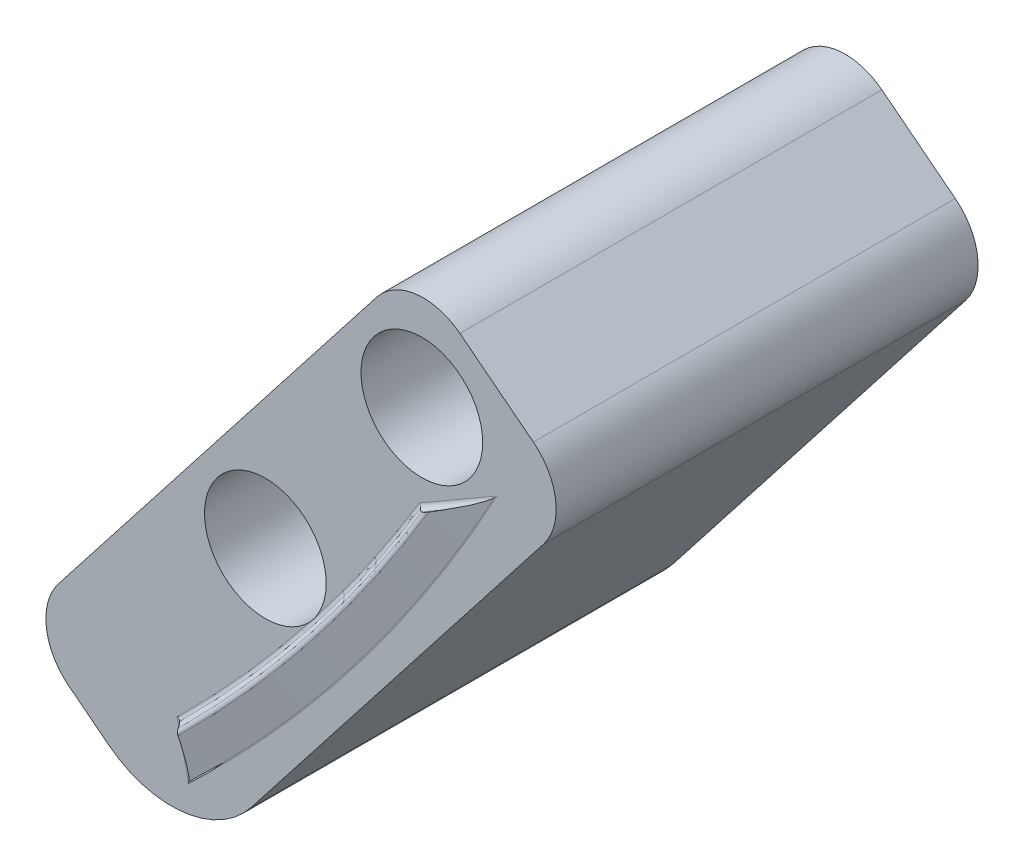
ISO-10303-21;
HEADER;
FILE_DESCRIPTION(('STEP AP214'),'2;1');
FILE_NAME('part.step','',(''),(''),'','','');
FILE_SCHEMA(('AUTOMOTIVE_DESIGN { 1 0 10303 214 1 1 1 1 }'));
ENDSEC;
DATA;
#1=APPLICATION_CONTEXT('core data for automotive mechanical design processes');
#2=APPLICATION_PROTOCOL_DEFINITION('international standard','automotive_design',2000,#1);
#3=PRODUCT_CONTEXT('',#1,'mechanical');
#4=PRODUCT('Part','Part','',(#3));
#5=PRODUCT_RELATED_PRODUCT_CATEGORY('part','',(#4));
#6=PRODUCT_DEFINITION_FORMATION('','',#4);
#7=PRODUCT_DEFINITION_CONTEXT('part definition',#1,'design');
#8=PRODUCT_DEFINITION('design','',#6,#7);
#9=PRODUCT_DEFINITION_SHAPE('','',#8);
#10=(LENGTH_UNIT() NAMED_UNIT(*) SI_UNIT(.MILLI.,.METRE.));
#11=(NAMED_UNIT(*) PLANE_ANGLE_UNIT() SI_UNIT($,.RADIAN.));
#12=(NAMED_UNIT(*) SI_UNIT($,.STERADIAN.) SOLID_ANGLE_UNIT());
#13=UNCERTAINTY_MEASURE_WITH_UNIT(LENGTH_MEASURE(1.E-05),#10,'distance_accuracy_value','');
#14=(GEOMETRIC_REPRESENTATION_CONTEXT(3) GLOBAL_UNCERTAINTY_ASSIGNED_CONTEXT((#13)) GLOBAL_UNIT_ASSIGNED_CONTEXT((#10,
#11,#12)) REPRESENTATION_CONTEXT('',''));
#15=CARTESIAN_POINT('',(0.,0.,0.));
#16=DIRECTION('',(0.,0.,1.));
#17=DIRECTION('',(1.,0.,0.));
#18=AXIS2_PLACEMENT_3D('',#15,#16,#17);
#19=CARTESIAN_POINT('',(-517.015030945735,-64.8350073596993,-0.127));
#20=DIRECTION('',(0.,0.,-1.));
#21=DIRECTION('',(-1.,0.,0.));
#22=AXIS2_PLACEMENT_3D('',#19,#20,#21);
#23=PLANE('',#22);
#24=CARTESIAN_POINT('',(-517.015030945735,-64.8350073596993,-0.127000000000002));
#25=DIRECTION('',(0.,0.,-1.));
#26=DIRECTION('',(-1.,0.,0.));
#27=AXIS2_PLACEMENT_3D('',#24,#25,#26);
#28=CIRCLE('',#27,7.62000000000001);
#29=CARTESIAN_POINT('',(-521.706371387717,-70.8396493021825,-0.127000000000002));
#30=VERTEX_POINT('',#29);
#31=CARTESIAN_POINT('',(-511.010389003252,-69.5263478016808,-0.127000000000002));
#32=VERTEX_POINT('',#31);
#33=EDGE_CURVE('E848',#30,#32,#28,.F.);
#34=ORIENTED_EDGE('',*,*,#33,.T.);
#35=DIRECTION('',(0.615661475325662,0.788010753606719,0.));
#36=VECTOR('',#35,1.);
#37=CARTESIAN_POINT('',(-511.010389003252,-69.5263478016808,-0.127000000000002));
#38=LINE('',#37,#36);
#39=CARTESIAN_POINT('',(-489.117466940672,-41.504685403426,-0.127000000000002));
#40=VERTEX_POINT('',#39);
#41=EDGE_CURVE('E731',#32,#40,#38,.T.);
#42=ORIENTED_EDGE('',*,*,#41,.T.);
#43=CARTESIAN_POINT('',(-492.620174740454,-38.7680701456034,-0.127000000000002));
#44=DIRECTION('',(0.,0.,-1.));
#45=DIRECTION('',(-1.,0.,0.));
#46=AXIS2_PLACEMENT_3D('',#43,#44,#45);
#47=CIRCLE('',#46,4.445);
#48=CARTESIAN_POINT('',(-489.883559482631,-35.2653623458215,-0.127000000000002));
#49=VERTEX_POINT('',#48);
#50=EDGE_CURVE('E1251',#40,#49,#47,.F.);
#51=ORIENTED_EDGE('',*,*,#50,.T.);
#52=DIRECTION('',(-0.788010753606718,0.615661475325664,0.));
#53=VECTOR('',#52,1.);
#54=CARTESIAN_POINT('',(-495.387814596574,-30.9649669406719,-0.127000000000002));
#55=LINE('',#54,#53);
#56=CARTESIAN_POINT('',(-495.387814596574,-30.9649669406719,-0.127000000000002));
#57=VERTEX_POINT('',#56);
#58=EDGE_CURVE('E1240',#49,#57,#55,.T.);
#59=ORIENTED_EDGE('',*,*,#58,.T.);
#60=CARTESIAN_POINT('',(-498.124429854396,-34.4676747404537,-0.127000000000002));
#61=DIRECTION('',(0.,0.,-1.));
#62=DIRECTION('',(-1.,0.,0.));
#63=AXIS2_PLACEMENT_3D('',#60,#61,#62);
#64=CIRCLE('',#63,4.44500000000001);
#65=CARTESIAN_POINT('',(-501.627137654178,-31.7310594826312,-0.127000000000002));
#66=VERTEX_POINT('',#65);
#67=EDGE_CURVE('E1229',#57,#66,#64,.F.);
#68=ORIENTED_EDGE('',*,*,#67,.T.);
#69=DIRECTION('',(-0.615661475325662,-0.788010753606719,0.));
#70=VECTOR('',#69,1.);
#71=CARTESIAN_POINT('',(-525.474784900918,-62.2546560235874,-0.127000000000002));
#72=LINE('',#71,#70);
#73=CARTESIAN_POINT('',(-525.474784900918,-62.2546560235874,-0.127000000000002));
#74=VERTEX_POINT('',#73);
#75=EDGE_CURVE('E1218',#66,#74,#72,.T.);
#76=ORIENTED_EDGE('',*,*,#75,.T.);
#77=CARTESIAN_POINT('',(-521.972077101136,-64.99127128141,-0.127000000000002));
#78=DIRECTION('',(0.,0.,-1.));
#79=DIRECTION('',(-1.,0.,0.));
#80=AXIS2_PLACEMENT_3D('',#77,#78,#79);
#81=CIRCLE('',#80,4.44500000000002);
#82=CARTESIAN_POINT('',(-524.708692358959,-68.4939790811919,-0.127000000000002));
#83=VERTEX_POINT('',#82);
#84=EDGE_CURVE('E1207',#74,#83,#81,.F.);
#85=ORIENTED_EDGE('',*,*,#84,.T.);
#86=DIRECTION('',(0.788010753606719,-0.615661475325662,0.));
#87=VECTOR('',#86,1.);
#88=CARTESIAN_POINT('',(-524.708692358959,-68.4939790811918,-0.127000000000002));
#89=LINE('',#88,#87);
#90=EDGE_CURVE('E1196',#83,#30,#89,.T.);
#91=ORIENTED_EDGE('',*,*,#90,.T.);
#92=EDGE_LOOP('',(#34,#42,#51,#59,#68,#76,#85,#91));
#93=FACE_BOUND('',#92,.T.);
#94=CARTESIAN_POINT('',(-509.970121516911,-52.2079960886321,-0.127000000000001));
#95=DIRECTION('',(0.,0.,1.));
#96=DIRECTION('',(1.,0.,0.));
#97=AXIS2_PLACEMENT_3D('',#94,#95,#96);
#98=CIRCLE('',#97,4.55930000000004);
#99=CARTESIAN_POINT('',(-506.155729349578,-54.7055206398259,-0.126999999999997));
#100=VERTEX_POINT('',#99);
#101=CARTESIAN_POINT('',(-506.624927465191,-55.3058813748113,-0.127000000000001));
#102=VERTEX_POINT('',#101);
#103=EDGE_CURVE('E622',#100,#102,#98,.T.);
#104=ORIENTED_EDGE('',*,*,#103,.F.);
#105=CARTESIAN_POINT('',(-501.224062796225,-48.3552851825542,-0.014982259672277));
#106=CARTESIAN_POINT('',(-501.316644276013,-48.2928536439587,-0.126999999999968));
#107=CARTESIAN_POINT('',(-501.447781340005,-48.2044224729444,-0.127));
#108=CARTESIAN_POINT('',(-501.665011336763,-49.0090504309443,-0.0150528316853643));
#109=CARTESIAN_POINT('',(-501.757148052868,-48.945981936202,-0.127000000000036));
#110=CARTESIAN_POINT('',(-501.887679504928,-48.8567559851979,-0.127));
#111=CARTESIAN_POINT('',(-502.112395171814,-49.6584704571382,-0.0151145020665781));
#112=CARTESIAN_POINT('',(-502.20411321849,-49.594813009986,-0.127000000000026));
#113=CARTESIAN_POINT('',(-502.334008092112,-49.5047524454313,-0.127));
#114=CARTESIAN_POINT('',(-503.019878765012,-50.9484439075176,-0.015220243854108));
#115=CARTESIAN_POINT('',(-503.110739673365,-50.8835985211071,-0.126999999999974));
#116=CARTESIAN_POINT('',(-503.239369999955,-50.7918929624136,-0.127));
#117=CARTESIAN_POINT('',(-503.479979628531,-51.5889965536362,-0.0152643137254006));
#118=CARTESIAN_POINT('',(-503.570413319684,-51.5235703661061,-0.126999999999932));
#119=CARTESIAN_POINT('',(-503.698404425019,-51.4310362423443,-0.127));
#120=CARTESIAN_POINT('',(-504.412660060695,-52.8609373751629,-0.0153350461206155));
#121=CARTESIAN_POINT('',(-504.502219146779,-52.7943389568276,-0.126999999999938));
#122=CARTESIAN_POINT('',(-504.628939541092,-52.7001706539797,-0.127));
#123=CARTESIAN_POINT('',(-504.885239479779,-53.4923256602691,-0.0153617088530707));
#124=CARTESIAN_POINT('',(-504.974362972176,-53.4251533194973,-0.126999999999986));
#125=CARTESIAN_POINT('',(-505.10044008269,-53.3301618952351,-0.127));
#126=CARTESIAN_POINT('',(-505.842670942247,-54.7456639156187,-0.0153976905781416));
#127=CARTESIAN_POINT('',(-505.9309019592,-54.6773333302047,-0.127000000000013));
#128=CARTESIAN_POINT('',(-506.055699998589,-54.5807165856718,-0.127));
#129=CARTESIAN_POINT('',(-506.327522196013,-55.3676144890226,-0.0154070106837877));
#130=CARTESIAN_POINT('',(-506.415308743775,-55.2987165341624,-0.126999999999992));
#131=CARTESIAN_POINT('',(-506.539458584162,-55.2012806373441,-0.127));
#132=CARTESIAN_POINT('',(-507.309633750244,-56.6022266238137,-0.0154082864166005));
#133=CARTESIAN_POINT('',(-507.396508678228,-56.5321830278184,-0.126999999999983));
#134=CARTESIAN_POINT('',(-507.519368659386,-56.4331273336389,-0.127));
#135=CARTESIAN_POINT('',(-507.806901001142,-57.2148826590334,-0.0154002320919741));
#136=CARTESIAN_POINT('',(-507.893321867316,-57.144277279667,-0.126999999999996));
#137=CARTESIAN_POINT('',(-508.01552709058,-57.0444044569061,-0.127));
#138=CARTESIAN_POINT('',(-508.813452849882,-58.430315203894,-0.0153665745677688));
#139=CARTESIAN_POINT('',(-508.898941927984,-58.3585756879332,-0.127000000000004));
#140=CARTESIAN_POINT('',(-509.019844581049,-58.257086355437,-0.127));
#141=CARTESIAN_POINT('',(-509.322738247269,-59.0330910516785,-0.0153409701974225));
#142=CARTESIAN_POINT('',(-509.40776347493,-58.9607953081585,-0.126999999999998));
#143=CARTESIAN_POINT('',(-509.528004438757,-58.8584904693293,-0.127));
#144=CARTESIAN_POINT('',(-510.353312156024,-60.2287626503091,-0.0152723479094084));
#145=CARTESIAN_POINT('',(-510.437388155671,-60.1553477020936,-0.127000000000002));
#146=CARTESIAN_POINT('',(-510.556316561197,-60.051433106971,-0.127));
#147=CARTESIAN_POINT('',(-510.874605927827,-60.8216538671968,-0.015229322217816));
#148=CARTESIAN_POINT('',(-510.958210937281,-60.7476913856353,-0.127000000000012));
#149=CARTESIAN_POINT('',(-511.076474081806,-60.6429671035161,-0.127));
#150=CARTESIAN_POINT('',(-511.665163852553,-61.7031644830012,-0.0151517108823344));
#151=CARTESIAN_POINT('',(-511.748029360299,-61.6283577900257,-0.126999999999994));
#152=CARTESIAN_POINT('',(-511.865317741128,-61.5224504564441,-0.127));
#153=CARTESIAN_POINT('',(-511.930100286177,-61.9956765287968,-0.0151236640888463));
#154=CARTESIAN_POINT('',(-512.012724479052,-61.9205961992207,-0.126999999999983));
#155=CARTESIAN_POINT('',(-512.129681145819,-61.8142882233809,-0.127));
#156=CARTESIAN_POINT('',(-512.462842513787,-62.5780920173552,-0.0150632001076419));
#157=CARTESIAN_POINT('',(-512.544980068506,-62.5024645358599,-0.127000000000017));
#158=CARTESIAN_POINT('',(-512.661273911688,-62.3953578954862,-0.127));
#159=CARTESIAN_POINT('',(-512.730648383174,-62.8679953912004,-0.0150307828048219));
#160=CARTESIAN_POINT('',(-512.812542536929,-62.792096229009,-0.127000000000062));
#161=CARTESIAN_POINT('',(-512.928503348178,-62.6845897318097,-0.127));
#162=CARTESIAN_POINT('',(-513.269239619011,-63.4453120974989,-0.0149615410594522));
#163=CARTESIAN_POINT('',(-513.350642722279,-63.3688694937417,-0.127000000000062));
#164=CARTESIAN_POINT('',(-513.465937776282,-63.2605654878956,-0.127));
#165=CARTESIAN_POINT('',(-513.540026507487,-63.7327240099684,-0.0149247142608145));
#166=CARTESIAN_POINT('',(-513.621183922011,-63.6560114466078,-0.127000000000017));
#167=CARTESIAN_POINT('',(-513.736144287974,-63.5473079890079,-0.127));
#168=CARTESIAN_POINT('',(-514.084415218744,-64.3048752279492,-0.0148466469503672));
#169=CARTESIAN_POINT('',(-514.165077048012,-64.2276228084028,-0.126999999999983));
#170=CARTESIAN_POINT('',(-514.279368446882,-64.1181226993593,-0.127));
#171=CARTESIAN_POINT('',(-514.358017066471,-64.5896145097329,-0.0148054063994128));
#172=CARTESIAN_POINT('',(-514.43843101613,-64.5120939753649,-0.126999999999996));
#173=CARTESIAN_POINT('',(-514.552386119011,-64.4021948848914,-0.127));
#174=CARTESIAN_POINT('',(-514.90799814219,-65.1563780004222,-0.0147184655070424));
#175=CARTESIAN_POINT('',(-514.987911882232,-65.0783211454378,-0.127000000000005));
#176=CARTESIAN_POINT('',(-515.101194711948,-64.9676261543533,-0.127));
#177=CARTESIAN_POINT('',(-515.184377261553,-65.4384023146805,-0.014672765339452));
#178=CARTESIAN_POINT('',(-515.264040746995,-65.3600790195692,-0.127000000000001));
#179=CARTESIAN_POINT('',(-515.37698552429,-65.24898534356,-0.127));
#180=CARTESIAN_POINT('',(-515.739892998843,-65.9997167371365,-0.014576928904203));
#181=CARTESIAN_POINT('',(-515.819051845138,-65.9208608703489,-0.126999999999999));
#182=CARTESIAN_POINT('',(-515.93132082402,-65.8089718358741,-0.127));
#183=CARTESIAN_POINT('',(-516.019029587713,-66.279006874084,-0.0145267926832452));
#184=CARTESIAN_POINT('',(-516.097936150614,-66.199886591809,-0.127));
#185=CARTESIAN_POINT('',(-516.209865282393,-66.0875991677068,-0.127));
#186=CARTESIAN_POINT('',(-516.580177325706,-66.8349473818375,-0.0144217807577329));
#187=CARTESIAN_POINT('',(-516.658573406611,-66.7552969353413,-0.127));
#188=CARTESIAN_POINT('',(-516.769822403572,-66.6422136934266,-0.127));
#189=CARTESIAN_POINT('',(-516.862189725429,-67.1115964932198,-0.0143669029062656));
#190=CARTESIAN_POINT('',(-516.94032985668,-67.0316820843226,-0.127));
#191=CARTESIAN_POINT('',(-517.051236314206,-66.918199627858,-0.127));
#192=CARTESIAN_POINT('',(-517.287224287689,-67.5244878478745,-0.0142816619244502));
#193=CARTESIAN_POINT('',(-517.364970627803,-67.4441712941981,-0.127));
#194=CARTESIAN_POINT('',(-517.475374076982,-67.3301020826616,-0.127));
#195=CARTESIAN_POINT('',(-517.429239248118,-67.6617719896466,-0.0142527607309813));
#196=CARTESIAN_POINT('',(-517.506857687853,-67.5813251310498,-0.127));
#197=CARTESIAN_POINT('',(-517.617090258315,-67.4670575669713,-0.127));
#198=CARTESIAN_POINT('',(-517.713985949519,-67.9356130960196,-0.0141928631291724));
#199=CARTESIAN_POINT('',(-517.79134253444,-67.8549008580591,-0.127));
#200=CARTESIAN_POINT('',(-517.901230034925,-67.7402329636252,-0.127));
#201=CARTESIAN_POINT('',(-517.856717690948,-68.0721700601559,-0.0141618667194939));
#202=CARTESIAN_POINT('',(-517.933940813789,-67.9913231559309,-0.127));
#203=CARTESIAN_POINT('',(-518.043653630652,-67.8764528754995,-0.127));
#204=CARTESIAN_POINT('',(-518.142495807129,-68.3445713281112,-0.0141179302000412));
#205=CARTESIAN_POINT('',(-518.219533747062,-68.2635378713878,-0.127));
#206=CARTESIAN_POINT('',(-518.328998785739,-68.1483811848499,-0.127));
#207=CARTESIAN_POINT('',(-518.285542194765,-68.4804156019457,-0.014104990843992));
#208=CARTESIAN_POINT('',(-518.362524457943,-68.3993264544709,-0.127));
#209=CARTESIAN_POINT('',(-518.471920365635,-68.2840895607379,-0.127));
#210=CARTESIAN_POINT('',(-518.500107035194,-68.6839783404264,-0.0140956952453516));
#211=CARTESIAN_POINT('',(-518.577049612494,-68.602849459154,-0.127));
#212=CARTESIAN_POINT('',(-518.686395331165,-68.487554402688,-0.127));
#213=CARTESIAN_POINT('',(-518.571627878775,-68.7517986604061,-0.0140942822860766));
#214=CARTESIAN_POINT('',(-518.648564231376,-68.6706635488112,-0.127));
#215=CARTESIAN_POINT('',(-518.757902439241,-68.5553597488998,-0.127));
#216=CARTESIAN_POINT('',(-518.714589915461,-68.8873945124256,-0.0140976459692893));
#217=CARTESIAN_POINT('',(-518.791540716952,-68.8062738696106,-0.127));
#218=CARTESIAN_POINT('',(-518.900897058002,-68.6909911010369,-0.127));
#219=CARTESIAN_POINT('',(-518.786031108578,-68.9551700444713,-0.0141024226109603));
#220=CARTESIAN_POINT('',(-518.863001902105,-68.874069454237,-0.127));
#221=CARTESIAN_POINT('',(-518.97238456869,-68.7588171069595,-0.127));
#222=CARTESIAN_POINT('',(-519.000388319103,-69.1585961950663,-0.0141102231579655));
#223=CARTESIAN_POINT('',(-519.077390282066,-69.077526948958,-0.127));
#224=CARTESIAN_POINT('',(-519.186817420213,-68.9623256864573,-0.127));
#225=CARTESIAN_POINT('',(-519.143338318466,-69.2943467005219,-0.0141067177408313));
#226=CARTESIAN_POINT('',(-519.220326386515,-69.2132634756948,-0.127));
#227=CARTESIAN_POINT('',(-519.329733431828,-69.0980391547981,-0.127));
#228=CARTESIAN_POINT('',(-519.429216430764,-69.5657800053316,-0.0141040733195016));
#229=CARTESIAN_POINT('',(-519.506194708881,-69.484686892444,-0.127));
#230=CARTESIAN_POINT('',(-519.615585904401,-69.3694445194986,-0.127));
#231=CARTESIAN_POINT('',(-519.572144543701,-69.7014628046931,-0.0141049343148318));
#232=CARTESIAN_POINT('',(-519.649125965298,-69.620372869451,-0.127));
#233=CARTESIAN_POINT('',(-519.758522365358,-69.5051364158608,-0.127));
#234=CARTESIAN_POINT('',(-520.000674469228,-70.1082825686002,-0.0141063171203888));
#235=CARTESIAN_POINT('',(-520.077660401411,-70.0271972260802,-0.127));
#236=CARTESIAN_POINT('',(-520.187065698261,-69.9119707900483,-0.127));
#237=CARTESIAN_POINT('',(-520.2862822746,-70.3794380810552,-0.0141056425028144));
#238=CARTESIAN_POINT('',(-520.363266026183,-70.2983505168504,-0.127));
#239=CARTESIAN_POINT('',(-520.472666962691,-70.1831191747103,-0.127));
#240=CARTESIAN_POINT('',(-520.85749377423,-70.9217360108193,-0.01410514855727));
#241=CARTESIAN_POINT('',(-520.934476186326,-70.8406470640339,-0.127));
#242=CARTESIAN_POINT('',(-521.043873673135,-70.7254118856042,-0.127));
#243=CARTESIAN_POINT('',(-521.143097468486,-71.1928784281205,-0.0141053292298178));
#244=CARTESIAN_POINT('',(-521.22008034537,-71.1117899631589,-0.127));
#245=CARTESIAN_POINT('',(-521.329479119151,-70.9965562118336,-0.127));
#246=CARTESIAN_POINT('',(-521.714296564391,-71.7351578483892,-0.0141054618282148));
#247=CARTESIAN_POINT('',(-521.791279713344,-71.6540696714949,-0.127));
#248=CARTESIAN_POINT('',(-521.900679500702,-71.5388370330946,-0.127));
#249=CARTESIAN_POINT('',(-521.999891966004,-72.0062948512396,-0.0141054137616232));
#250=CARTESIAN_POINT('',(-522.076875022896,-71.9252065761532,-0.127));
#251=CARTESIAN_POINT('',(-522.186274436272,-71.8099735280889,-0.127));
#252=CARTESIAN_POINT('',(-522.57108242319,-72.5485678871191,-0.0141053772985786));
#253=CARTESIAN_POINT('',(-522.648065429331,-72.4674795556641,-0.127));
#254=CARTESIAN_POINT('',(-522.75746453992,-72.3522461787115,-0.127));
#255=CARTESIAN_POINT('',(-522.856677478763,-72.8197039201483,-0.0141053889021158));
#256=CARTESIAN_POINT('',(-522.93366049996,-72.7386156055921,-0.127));
#257=CARTESIAN_POINT('',(-523.043059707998,-72.6233823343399,-0.127));
#258=CARTESIAN_POINT('',(-523.712938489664,-73.6326145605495,-0.0141054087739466));
#259=CARTESIAN_POINT('',(-523.789921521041,-73.5515262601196,-0.127));
#260=CARTESIAN_POINT('',(-523.899320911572,-73.4362931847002,-0.127));
#261=CARTESIAN_POINT('',(-524.283604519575,-74.1743893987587,-0.0141054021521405));
#262=CARTESIAN_POINT('',(-524.360587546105,-74.093301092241,-0.126999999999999));
#263=CARTESIAN_POINT('',(-524.469986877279,-73.9780679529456,-0.127));
#264=CARTESIAN_POINT('',(-525.424955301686,-75.257956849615,-0.0141053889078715));
#265=CARTESIAN_POINT('',(-525.50193833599,-75.1768685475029,-0.127000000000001));
#266=CARTESIAN_POINT('',(-525.611337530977,-75.0616352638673,-0.127));
#267=CARTESIAN_POINT('',(-525.995640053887,-75.7997494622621,-0.0141053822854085));
#268=CARTESIAN_POINT('',(-526.07262310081,-75.7186611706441,-0.127000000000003));
#269=CARTESIAN_POINT('',(-526.182022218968,-75.6034278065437,-0.127));
#270=CARTESIAN_POINT('',(-526.566324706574,-76.3415417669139,-0.014105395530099));
#271=CARTESIAN_POINT('',(-526.64330773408,-76.2604534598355,-0.127000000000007));
#272=CARTESIAN_POINT('',(-526.752707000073,-76.1452202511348,-0.127));
#273=(BOUNDED_SURFACE() B_SPLINE_SURFACE(3,2,((#105,#106,#107),(#108,#109,#110),(#111,#112,
#113),(#114,#115,#116),(#117,#118,#119),(#120,#121,#122),(#123,#124,#125),(#126,#127,#128),
(#129,#130,#131),(#132,#133,#134),(#135,#136,#137),(#138,#139,#140),(#141,#142,#143),(#144,#145,
#146),(#147,#148,#149),(#150,#151,#152),(#153,#154,#155),(#156,#157,#158),(#159,#160,#161),
(#162,#163,#164),(#165,#166,#167),(#168,#169,#170),(#171,#172,#173),(#174,#175,#176),(#177,#178,
#179),(#180,#181,#182),(#183,#184,#185),(#186,#187,#188),(#189,#190,#191),(#192,#193,#194),
(#195,#196,#197),(#198,#199,#200),(#201,#202,#203),(#204,#205,#206),(#207,#208,#209),(#210,#211,
#212),(#213,#214,#215),(#216,#217,#218),(#219,#220,#221),(#222,#223,#224),(#225,#226,#227),
(#228,#229,#230),(#231,#232,#233),(#234,#235,#236),(#237,#238,#239),(#240,#241,#242),(#243,#244,
#245),(#246,#247,#248),(#249,#250,#251),(#252,#253,#254),(#255,#256,#257),(#258,#259,#260),
(#261,#262,#263),(#264,#265,#266),(#267,#268,#269),(#270,#271,#272)),.UNSPECIFIED.,.F.,.F.,
.F.) B_SPLINE_SURFACE_WITH_KNOTS((4,2,2,2,2,2,2,2,2,2,2,2,2,2,2,2,2,2,2,2,2,2,2,2,2,2,2,4),(3,
3),(0.,2.36035167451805,4.72090916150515,7.0814383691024,9.44181607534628,11.8035461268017,
14.1654337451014,16.5283764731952,17.7096803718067,18.8910153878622,20.0729844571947,
21.2549640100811,22.4368975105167,23.6188185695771,24.8012776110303,25.3925135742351,
25.9837499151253,26.5750109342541,26.8706416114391,27.1662722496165,27.7575320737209,
28.348791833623,29.5302340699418,30.7116770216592,31.8930809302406,33.074484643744,
35.4351235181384,37.7958398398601),(0.,1.),
.UNSPECIFIED.) GEOMETRIC_REPRESENTATION_ITEM() RATIONAL_B_SPLINE_SURFACE(((1.,0.923577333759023,
1.),(1.,0.923627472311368,1.),(1.,0.923671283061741,1.),(1.,0.923746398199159,1.),(1.,
0.92377770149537,1.),(1.,0.923827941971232,1.),(1.,0.923846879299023,1.),(1.,0.92387243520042,
1.),(1.,0.92387905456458,1.),(1.,0.923879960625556,1.),(1.,0.923874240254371,1.),(1.,
0.923850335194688,1.),(1.,0.923832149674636,1.),(1.,0.923783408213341,1.),(1.,0.923752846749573,
1.),(1.,0.923697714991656,1.),(1.,0.923677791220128,1.),(1.,0.923634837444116,1.),(1.,
0.923611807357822,1.),(1.,0.923562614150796,1.),(1.,0.923536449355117,1.),(1.,0.923480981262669,
1.),(1.,0.923451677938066,1.),(1.,0.92338989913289,1.),(1.,0.923357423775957,1.),(1.,
0.923289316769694,1.),(1.,0.923253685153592,1.),(1.,0.923179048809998,1.),(1.,0.923140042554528,
1.),(1.,0.923079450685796,1.),(1.,0.923058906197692,1.),(1.,0.923016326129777,1.),(1.,
0.922994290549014,1.),(1.,0.922963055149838,1.),(1.,0.922953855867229,1.),(1.,0.922947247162,
1.),(1.,0.922946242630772,1.),(1.,0.922948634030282,1.),(1.,0.92295202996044,1.),(1.,
0.922957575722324,1.),(1.,0.922955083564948,1.),(1.,0.92295320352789,1.),(1.,0.922953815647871,
1.),(1.,0.922954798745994,1.),(1.,0.922954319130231,1.),(1.,0.922953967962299,1.),(1.,
0.922954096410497,1.),(1.,0.922954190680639,1.),(1.,0.922954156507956,1.),(1.,0.922954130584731,
1.),(1.,0.922954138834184,1.),(1.,0.922954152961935,1.),(1.,0.92295414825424,1.),(1.,
0.922954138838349,1.),(1.,0.922954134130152,1.),(1.,0.922954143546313,1.))) REPRESENTATION_ITEM('') SURFACE());
#274=CARTESIAN_POINT('',(-526.752707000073,-76.1452202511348,-0.127));
#275=CARTESIAN_POINT('',(-526.182022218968,-75.6034278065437,-0.127));
#276=CARTESIAN_POINT('',(-525.611337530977,-75.0616352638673,-0.127));
#277=CARTESIAN_POINT('',(-524.469986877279,-73.9780679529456,-0.127));
#278=CARTESIAN_POINT('',(-523.899320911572,-73.4362931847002,-0.127));
#279=CARTESIAN_POINT('',(-523.043059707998,-72.6233823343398,-0.127));
#280=CARTESIAN_POINT('',(-522.75746453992,-72.3522461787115,-0.127));
#281=CARTESIAN_POINT('',(-522.186274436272,-71.8099735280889,-0.127));
#282=CARTESIAN_POINT('',(-521.900679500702,-71.5388370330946,-0.127));
#283=CARTESIAN_POINT('',(-521.329479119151,-70.9965562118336,-0.127));
#284=CARTESIAN_POINT('',(-521.043873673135,-70.7254118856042,-0.127));
#285=CARTESIAN_POINT('',(-520.472666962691,-70.1831191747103,-0.127));
#286=CARTESIAN_POINT('',(-520.187065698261,-69.9119707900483,-0.127));
#287=CARTESIAN_POINT('',(-519.758522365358,-69.5051364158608,-0.127));
#288=CARTESIAN_POINT('',(-519.615585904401,-69.3694445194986,-0.127));
#289=CARTESIAN_POINT('',(-519.329733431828,-69.098039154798,-0.127));
#290=CARTESIAN_POINT('',(-519.186817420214,-68.9623256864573,-0.127));
#291=CARTESIAN_POINT('',(-518.97238456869,-68.7588171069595,-0.127));
#292=CARTESIAN_POINT('',(-518.900897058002,-68.6909911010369,-0.127));
#293=CARTESIAN_POINT('',(-518.757902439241,-68.5553597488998,-0.127));
#294=CARTESIAN_POINT('',(-518.686395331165,-68.487554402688,-0.127));
#295=CARTESIAN_POINT('',(-518.471920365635,-68.2840895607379,-0.127));
#296=CARTESIAN_POINT('',(-518.328998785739,-68.1483811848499,-0.127));
#297=CARTESIAN_POINT('',(-518.043653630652,-67.8764528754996,-0.127));
#298=CARTESIAN_POINT('',(-517.901230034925,-67.7402329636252,-0.127));
#299=CARTESIAN_POINT('',(-517.617090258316,-67.4670575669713,-0.127));
#300=CARTESIAN_POINT('',(-517.475374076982,-67.3301020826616,-0.127));
#301=CARTESIAN_POINT('',(-517.051236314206,-66.918199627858,-0.127));
#302=CARTESIAN_POINT('',(-516.769822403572,-66.6422136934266,-0.127));
#303=CARTESIAN_POINT('',(-516.209865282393,-66.0875991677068,-0.127));
#304=CARTESIAN_POINT('',(-515.93132082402,-65.8089718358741,-0.127));
#305=CARTESIAN_POINT('',(-515.37698552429,-65.24898534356,-0.127));
#306=CARTESIAN_POINT('',(-515.101194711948,-64.9676261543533,-0.127));
#307=CARTESIAN_POINT('',(-514.552386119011,-64.4021948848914,-0.127));
#308=CARTESIAN_POINT('',(-514.279368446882,-64.1181226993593,-0.127));
#309=CARTESIAN_POINT('',(-513.736144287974,-63.5473079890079,-0.127));
#310=CARTESIAN_POINT('',(-513.465937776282,-63.2605654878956,-0.127));
#311=CARTESIAN_POINT('',(-512.928503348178,-62.6845897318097,-0.127));
#312=CARTESIAN_POINT('',(-512.661273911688,-62.3953578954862,-0.127));
#313=CARTESIAN_POINT('',(-512.129681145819,-61.8142882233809,-0.127));
#314=CARTESIAN_POINT('',(-511.865317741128,-61.5224504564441,-0.127));
#315=CARTESIAN_POINT('',(-511.076474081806,-60.6429671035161,-0.127));
#316=CARTESIAN_POINT('',(-510.556316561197,-60.051433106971,-0.127));
#317=CARTESIAN_POINT('',(-509.528004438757,-58.8584904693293,-0.127));
#318=CARTESIAN_POINT('',(-509.019844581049,-58.257086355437,-0.127));
#319=CARTESIAN_POINT('',(-508.01552709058,-57.0444044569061,-0.127));
#320=CARTESIAN_POINT('',(-507.519368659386,-56.4331273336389,-0.127));
#321=CARTESIAN_POINT('',(-506.539458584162,-55.2012806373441,-0.127));
#322=CARTESIAN_POINT('',(-506.055699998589,-54.5807165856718,-0.127));
#323=CARTESIAN_POINT('',(-505.10044008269,-53.3301618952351,-0.127));
#324=CARTESIAN_POINT('',(-504.628939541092,-52.7001706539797,-0.127));
#325=CARTESIAN_POINT('',(-503.698404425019,-51.4310362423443,-0.127));
#326=CARTESIAN_POINT('',(-503.239369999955,-50.7918929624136,-0.127));
#327=CARTESIAN_POINT('',(-502.334008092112,-49.5047524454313,-0.127));
#328=CARTESIAN_POINT('',(-501.887679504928,-48.8567559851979,-0.127));
#329=CARTESIAN_POINT('',(-501.447781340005,-48.2044224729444,-0.127));
#330=B_SPLINE_CURVE_WITH_KNOTS('',3,(#274,#275,#276,#277,#278,#279,#280,#281,#282,#283,#284,
#285,#286,#287,#288,#289,#290,#291,#292,#293,#294,#295,#296,#297,#298,#299,#300,#301,#302,#303,
#304,#305,#306,#307,#308,#309,#310,#311,#312,#313,#314,#315,#316,#317,#318,#319,#320,#321,#322,
#323,#324,#325,#326,#327,#328,#329),.UNSPECIFIED.,.F.,.F.,(4,2,2,2,2,2,2,2,2,2,2,2,2,2,2,2,2,2,
2,2,2,2,2,2,2,2,2,4),(0.,2.36071632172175,4.72135519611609,5.90275890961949,7.08416281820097,
8.26560576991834,9.44704800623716,10.0383077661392,10.6295675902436,10.9251982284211,
11.2208289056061,11.8120899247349,12.403326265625,12.9945622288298,14.1770212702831,
15.3589423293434,16.5408758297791,17.7228553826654,18.9048244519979,20.0861594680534,
21.2674633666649,23.6304060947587,25.9922937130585,28.3540237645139,30.7144014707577,
33.074930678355,35.4354881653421,37.7958398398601),.UNSPECIFIED.);
#331=CARTESIAN_POINT('',(-504.163674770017,-52.0656072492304,-0.127));
#332=VERTEX_POINT('',#331);
#333=EDGE_CURVE('E465',#100,#332,#330,.T.);
#334=ORIENTED_EDGE('',*,*,#333,.T.);
#335=CARTESIAN_POINT('',(-500.319115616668,-47.0315710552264,-0.0138633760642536));
#336=CARTESIAN_POINT('',(-500.411549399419,-46.9685904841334,-0.127000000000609));
#337=CARTESIAN_POINT('',(-500.543024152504,-46.8790090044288,-0.127));
#338=CARTESIAN_POINT('',(-500.727570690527,-47.6302680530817,-0.0142994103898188));
#339=CARTESIAN_POINT('',(-500.820218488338,-47.5677301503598,-0.127000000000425));
#340=CARTESIAN_POINT('',(-500.951120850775,-47.4779493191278,-0.127));
#341=CARTESIAN_POINT('',(-501.136025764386,-48.2289650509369,-0.0147354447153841));
#342=CARTESIAN_POINT('',(-501.228613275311,-48.1664676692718,-0.12700000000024));
#343=CARTESIAN_POINT('',(-501.359217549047,-48.0768896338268,-0.127));
#344=CARTESIAN_POINT('',(-501.544480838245,-48.8276620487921,-0.0151714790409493));
#345=CARTESIAN_POINT('',(-501.636734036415,-48.7648034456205,-0.127000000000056));
#346=CARTESIAN_POINT('',(-501.767314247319,-48.6758299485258,-0.127));
#347=CARTESIAN_POINT('',(-501.646567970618,-48.9772531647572,-0.0152904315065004));
#348=CARTESIAN_POINT('',(-501.738821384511,-48.9144307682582,-0.127000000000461));
#349=CARTESIAN_POINT('',(-501.869353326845,-48.8255613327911,-0.127));
#350=CARTESIAN_POINT('',(-501.748458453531,-49.1269180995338,-0.0153394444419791));
#351=CARTESIAN_POINT('',(-501.840742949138,-49.0641563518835,-0.127000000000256));
#352=CARTESIAN_POINT('',(-501.971281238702,-48.9753683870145,-0.127));
#353=CARTESIAN_POINT('',(-501.951913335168,-49.4264414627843,-0.015328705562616));
#354=CARTESIAN_POINT('',(-502.044263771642,-49.3637736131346,-0.126999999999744));
#355=CARTESIAN_POINT('',(-502.174908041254,-49.2751258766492,-0.127));
#356=CARTESIAN_POINT('',(-502.053477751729,-49.5762998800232,-0.0152689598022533));
#357=CARTESIAN_POINT('',(-502.145880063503,-49.5136903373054,-0.126999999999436));
#358=CARTESIAN_POINT('',(-502.27660694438,-49.4250763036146,-0.127));
#359=CARTESIAN_POINT('',(-502.205639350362,-49.8012804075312,-0.015121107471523));
#360=CARTESIAN_POINT('',(-502.298097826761,-49.7387087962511,-0.126999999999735));
#361=CARTESIAN_POINT('',(-502.428987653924,-49.6501169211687,-0.127));
#362=CARTESIAN_POINT('',(-502.256329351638,-49.8763065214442,-0.0150621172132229));
#363=CARTESIAN_POINT('',(-502.348808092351,-49.8137469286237,-0.126999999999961));
#364=CARTESIAN_POINT('',(-502.479753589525,-49.7251500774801,-0.127));
#365=CARTESIAN_POINT('',(-502.357769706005,-50.0264365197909,-0.0149559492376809));
#366=CARTESIAN_POINT('',(-502.450261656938,-49.9638645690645,-0.127000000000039));
#367=CARTESIAN_POINT('',(-502.581281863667,-49.8752216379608,-0.127));
#368=CARTESIAN_POINT('',(-502.4085200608,-50.1015404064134,-0.0149087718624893));
#369=CARTESIAN_POINT('',(-502.501004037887,-50.0389427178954,-0.12699999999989));
#370=CARTESIAN_POINT('',(-502.632044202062,-49.9502600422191,-0.127));
#371=CARTESIAN_POINT('',(-502.510593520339,-50.2519492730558,-0.0149618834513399));
#372=CARTESIAN_POINT('',(-502.602939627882,-50.1891634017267,-0.126999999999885));
#373=CARTESIAN_POINT('',(-502.7337528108,-50.1002229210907,-0.127));
#374=CARTESIAN_POINT('',(-502.561916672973,-50.3272542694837,-0.0150621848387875));
#375=CARTESIAN_POINT('',(-502.654121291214,-50.2642888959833,-0.12700000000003));
#376=CARTESIAN_POINT('',(-502.784699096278,-50.1751473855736,-0.127));
#377=CARTESIAN_POINT('',(-502.640329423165,-50.4405694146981,-0.0152654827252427));
#378=CARTESIAN_POINT('',(-502.732063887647,-50.3769839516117,-0.126999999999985));
#379=CARTESIAN_POINT('',(-502.861867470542,-50.287017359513,-0.127));
#380=CARTESIAN_POINT('',(-502.666704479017,-50.4783999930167,-0.0153420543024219));
#381=CARTESIAN_POINT('',(-502.758236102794,-50.4145449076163,-0.126999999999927));
#382=CARTESIAN_POINT('',(-502.887714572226,-50.3242205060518,-0.127));
#383=CARTESIAN_POINT('',(-502.719888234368,-50.5539493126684,-0.01542624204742));
#384=CARTESIAN_POINT('',(-502.81098100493,-50.4894949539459,-0.127000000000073));
#385=CARTESIAN_POINT('',(-502.939799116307,-50.3983524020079,-0.127));
#386=CARTESIAN_POINT('',(-502.746696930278,-50.5916680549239,-0.0154338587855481));
#387=CARTESIAN_POINT('',(-502.837556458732,-50.5268880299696,-0.127000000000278));
#388=CARTESIAN_POINT('',(-502.966036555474,-50.4352811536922,-0.127));
#389=CARTESIAN_POINT('',(-502.822411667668,-50.6972912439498,-0.0153888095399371));
#390=CARTESIAN_POINT('',(-502.912730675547,-50.6317435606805,-0.127000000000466));
#391=CARTESIAN_POINT('',(-503.04047001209,-50.5390385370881,-0.127));
#392=CARTESIAN_POINT('',(-502.871435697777,-50.7646211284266,-0.0152816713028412));
#393=CARTESIAN_POINT('',(-502.96155088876,-50.6987651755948,-0.127000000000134));
#394=CARTESIAN_POINT('',(-503.089053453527,-50.6055882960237,-0.127));
#395=CARTESIAN_POINT('',(-502.969457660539,-50.8983735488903,-0.0151856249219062));
#396=CARTESIAN_POINT('',(-503.059337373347,-50.8321696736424,-0.126999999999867));
#397=CARTESIAN_POINT('',(-503.18654186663,-50.7384531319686,-0.127));
#398=CARTESIAN_POINT('',(-503.018455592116,-50.9647960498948,-0.015196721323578));
#399=CARTESIAN_POINT('',(-503.108294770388,-50.8985403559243,-0.126999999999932));
#400=CARTESIAN_POINT('',(-503.235446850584,-50.8047681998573,-0.127));
#401=CARTESIAN_POINT('',(-503.116439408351,-51.0974835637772,-0.0152537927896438));
#402=CARTESIAN_POINT('',(-503.20623571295,-51.0311861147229,-0.127000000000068));
#403=CARTESIAN_POINT('',(-503.333303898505,-50.9373798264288,-0.127));
#404=CARTESIAN_POINT('',(-503.165425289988,-51.1637485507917,-0.0152997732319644));
#405=CARTESIAN_POINT('',(-503.25521663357,-51.0974576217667,-0.127000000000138));
#406=CARTESIAN_POINT('',(-503.382255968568,-51.0036763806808,-0.127));
#407=CARTESIAN_POINT('',(-503.263334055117,-51.2962569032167,-0.0153884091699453));
#408=CARTESIAN_POINT('',(-503.353129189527,-51.2299966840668,-0.126999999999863));
#409=CARTESIAN_POINT('',(-503.480131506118,-51.1362889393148,-0.127));
#410=CARTESIAN_POINT('',(-503.31225693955,-51.3625002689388,-0.0154310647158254));
#411=CARTESIAN_POINT('',(-503.4020610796,-51.2962645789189,-0.126999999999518));
#412=CARTESIAN_POINT('',(-503.529054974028,-51.2026049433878,-0.127));
#413=CARTESIAN_POINT('',(-503.458924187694,-51.5612950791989,-0.0155284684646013));
#414=CARTESIAN_POINT('',(-503.548756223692,-51.4951254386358,-0.126999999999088));
#415=CARTESIAN_POINT('',(-503.675753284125,-51.4016060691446,-0.127));
#416=CARTESIAN_POINT('',(-503.55656718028,-51.693911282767,-0.0155526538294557));
#417=CARTESIAN_POINT('',(-503.646435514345,-51.6277979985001,-0.126999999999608));
#418=CARTESIAN_POINT('',(-503.773456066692,-51.5343443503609,-0.127));
#419=CARTESIAN_POINT('',(-503.751594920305,-51.9593204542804,-0.0155118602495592));
#420=CARTESIAN_POINT('',(-503.84153053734,-51.8932868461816,-0.127000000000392));
#421=CARTESIAN_POINT('',(-503.968666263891,-51.7999328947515,-0.127));
#422=CARTESIAN_POINT('',(-503.848979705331,-52.0921133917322,-0.0154468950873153));
#423=CARTESIAN_POINT('',(-503.938959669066,-52.0261213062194,-0.127000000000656));
#424=CARTESIAN_POINT('',(-504.066173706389,-51.9327831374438,-0.127));
#425=CARTESIAN_POINT('',(-503.946256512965,-52.2250172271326,-0.0153335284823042));
#426=CARTESIAN_POINT('',(-504.036267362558,-52.159034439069,-0.126999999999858));
#427=CARTESIAN_POINT('',(-504.163596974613,-52.0656949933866,-0.127));
#428=CARTESIAN_POINT('',(-504.374377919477,-52.8098127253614,-0.0148720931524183));
#429=CARTESIAN_POINT('',(-504.464146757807,-52.7433687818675,-0.12700000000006));
#430=CARTESIAN_POINT('',(-504.592087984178,-52.6502186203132,-0.127));
#431=CARTESIAN_POINT('',(-504.80249932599,-53.3946082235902,-0.0144106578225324));
#432=CARTESIAN_POINT('',(-504.8923301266,-53.3281182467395,-0.127000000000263));
#433=CARTESIAN_POINT('',(-505.020578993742,-53.2347422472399,-0.127));
#434=CARTESIAN_POINT('',(-505.230620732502,-53.979403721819,-0.0139492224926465));
#435=CARTESIAN_POINT('',(-505.320817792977,-53.9132832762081,-0.127000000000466));
#436=CARTESIAN_POINT('',(-505.449070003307,-53.8192658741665,-0.127));
#437=(BOUNDED_SURFACE() B_SPLINE_SURFACE(3,2,((#335,#336,#337),(#338,#339,#340),(#341,#342,
#343),(#344,#345,#346),(#347,#348,#349),(#350,#351,#352),(#353,#354,#355),(#356,#357,#358),
(#359,#360,#361),(#362,#363,#364),(#365,#366,#367),(#368,#369,#370),(#371,#372,#373),(#374,#375,
#376),(#377,#378,#379),(#380,#381,#382),(#383,#384,#385),(#386,#387,#388),(#389,#390,#391),
(#392,#393,#394),(#395,#396,#397),(#398,#399,#400),(#401,#402,#403),(#404,#405,#406),(#407,#408,
#409),(#410,#411,#412),(#413,#414,#415),(#416,#417,#418),(#419,#420,#421),(#422,#423,#424),
(#425,#426,#427),(#428,#429,#430),(#431,#432,#433),(#434,#435,#436)),.UNSPECIFIED.,.F.,.F.,
.F.) B_SPLINE_SURFACE_WITH_KNOTS((4,3,2,2,2,2,2,2,2,2,2,2,2,2,3,4),(3,3),(0.,2.17427039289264,
2.71785381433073,3.26140697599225,3.53318684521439,3.80497458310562,4.07678521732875,
4.21268520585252,4.3485840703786,4.59576858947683,4.84296261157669,5.09019475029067,
5.33742315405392,5.83187978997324,6.32625999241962,8.50053038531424),(0.,1.),
.UNSPECIFIED.) GEOMETRIC_REPRESENTATION_ITEM() RATIONAL_B_SPLINE_SURFACE(((1.,0.922782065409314,
1.),(1.,0.923091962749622,1.),(1.,0.923401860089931,1.),(1.,0.923711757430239,1.),(1.,
0.923796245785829,1.),(1.,0.92383106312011,1.),(1.,0.923823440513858,1.),(1.,0.923781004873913,
1.),(1.,0.923675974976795,1.),(1.,0.92363406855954,1.),(1.,0.923558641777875,1.),(1.,
0.923525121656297,1.),(1.,0.923562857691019,1.),(1.,0.923634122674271,1.),(1.,0.923778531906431,
1.),(1.,0.923832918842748,1.),(1.,0.923892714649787,1.),(1.,0.923898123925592,1.),(1.,
0.923866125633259,1.),(1.,0.923790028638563,1.),(1.,0.923721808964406,1.),(1.,0.923729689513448,
1.),(1.,0.923770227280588,1.),(1.,0.923802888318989,1.),(1.,0.923865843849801,1.),(1.,
0.923896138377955,1.),(1.,0.923965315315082,1.),(1.,0.923982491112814,1.),(1.,0.923953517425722,
1.),(1.,0.923907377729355,1.),(1.,0.923826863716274,1.),(1.,0.923498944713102,1.),(1.,
0.92317102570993,1.),(1.,0.922843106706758,1.))) REPRESENTATION_ITEM('') SURFACE());
#438=CARTESIAN_POINT('',(-505.449070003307,-53.8192658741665,-0.127));
#439=CARTESIAN_POINT('',(-505.020578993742,-53.2347422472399,-0.127));
#440=CARTESIAN_POINT('',(-504.592087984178,-52.6502186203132,-0.127));
#441=CARTESIAN_POINT('',(-504.163596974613,-52.0656949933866,-0.127));
#442=CARTESIAN_POINT('',(-504.066173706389,-51.9327831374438,-0.127));
#443=CARTESIAN_POINT('',(-503.968666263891,-51.7999328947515,-0.127));
#444=CARTESIAN_POINT('',(-503.773456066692,-51.5343443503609,-0.127));
#445=CARTESIAN_POINT('',(-503.675753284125,-51.4016060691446,-0.127));
#446=CARTESIAN_POINT('',(-503.529054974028,-51.2026049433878,-0.127));
#447=CARTESIAN_POINT('',(-503.480131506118,-51.1362889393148,-0.127));
#448=CARTESIAN_POINT('',(-503.382255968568,-51.0036763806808,-0.127));
#449=CARTESIAN_POINT('',(-503.333303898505,-50.9373798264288,-0.127));
#450=CARTESIAN_POINT('',(-503.235446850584,-50.8047681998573,-0.127));
#451=CARTESIAN_POINT('',(-503.186541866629,-50.7384531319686,-0.127));
#452=CARTESIAN_POINT('',(-503.089053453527,-50.6055882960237,-0.127));
#453=CARTESIAN_POINT('',(-503.04047001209,-50.5390385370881,-0.127));
#454=CARTESIAN_POINT('',(-502.966036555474,-50.4352811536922,-0.127));
#455=CARTESIAN_POINT('',(-502.939799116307,-50.3983524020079,-0.127));
#456=CARTESIAN_POINT('',(-502.887714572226,-50.3242205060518,-0.127));
#457=CARTESIAN_POINT('',(-502.861867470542,-50.287017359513,-0.127));
#458=CARTESIAN_POINT('',(-502.784699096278,-50.1751473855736,-0.127));
#459=CARTESIAN_POINT('',(-502.7337528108,-50.1002229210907,-0.127));
#460=CARTESIAN_POINT('',(-502.632044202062,-49.9502600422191,-0.127));
#461=CARTESIAN_POINT('',(-502.581281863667,-49.8752216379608,-0.127));
#462=CARTESIAN_POINT('',(-502.479753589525,-49.7251500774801,-0.127));
#463=CARTESIAN_POINT('',(-502.428987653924,-49.6501169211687,-0.127));
#464=CARTESIAN_POINT('',(-502.27660694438,-49.4250763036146,-0.127));
#465=CARTESIAN_POINT('',(-502.174908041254,-49.2751258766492,-0.127));
#466=CARTESIAN_POINT('',(-501.971281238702,-48.9753683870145,-0.127));
#467=CARTESIAN_POINT('',(-501.869353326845,-48.8255613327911,-0.127));
#468=CARTESIAN_POINT('',(-501.767314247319,-48.6758299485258,-0.127));
#469=CARTESIAN_POINT('',(-501.359217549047,-48.0768896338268,-0.127));
#470=CARTESIAN_POINT('',(-500.951120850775,-47.4779493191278,-0.127));
#471=CARTESIAN_POINT('',(-500.543024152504,-46.8790090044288,-0.127));
#472=B_SPLINE_CURVE_WITH_KNOTS('',3,(#438,#439,#440,#441,#442,#443,#444,#445,#446,#447,#448,
#449,#450,#451,#452,#453,#454,#455,#456,#457,#458,#459,#460,#461,#462,#463,#464,#465,#466,#467,
#468,#469,#470,#471),.UNSPECIFIED.,.F.,.F.,(4,3,2,2,2,2,2,2,2,2,2,2,2,2,3,4),(0.,
2.17427039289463,2.668650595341,3.16310723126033,3.41033563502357,3.65756777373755,
3.90476179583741,4.15194631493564,4.28784517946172,4.42374516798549,4.69555580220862,
4.96734354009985,5.23912340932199,5.78267657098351,6.3262599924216,8.50053038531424),.UNSPECIFIED.);
#473=CARTESIAN_POINT('',(-501.767571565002,-48.6757967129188,-0.127));
#474=VERTEX_POINT('',#473);
#475=EDGE_CURVE('E634',#332,#474,#472,.T.);
#476=ORIENTED_EDGE('',*,*,#475,.T.);
#477=CARTESIAN_POINT('',(-504.501576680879,-52.5243117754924,-0.127));
#478=CARTESIAN_POINT('',(-504.374687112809,-52.6182626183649,-0.126999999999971));
#479=CARTESIAN_POINT('',(-504.28499069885,-52.6846751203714,-0.0153234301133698));
#480=CARTESIAN_POINT('',(-503.565163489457,-51.2595442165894,-0.127));
#481=CARTESIAN_POINT('',(-503.436941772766,-51.3518000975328,-0.126999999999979));
#482=CARTESIAN_POINT('',(-503.346415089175,-51.4170919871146,-0.0152603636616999));
#483=CARTESIAN_POINT('',(-502.653685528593,-49.9763090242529,-0.127));
#484=CARTESIAN_POINT('',(-502.52415875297,-50.0668460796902,-0.126999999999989));
#485=CARTESIAN_POINT('',(-502.432809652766,-50.1310299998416,-0.0151629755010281));
#486=CARTESIAN_POINT('',(-500.881840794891,-47.3750250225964,-0.127));
#487=CARTESIAN_POINT('',(-500.749805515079,-47.4622592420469,-0.127000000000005));
#488=CARTESIAN_POINT('',(-500.656768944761,-47.524054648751,-0.0148985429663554));
#489=CARTESIAN_POINT('',(-500.021473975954,-46.0569762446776,-0.127));
#490=CARTESIAN_POINT('',(-499.888150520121,-46.1424797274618,-0.12700000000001));
#491=CARTESIAN_POINT('',(-499.794333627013,-46.2031413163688,-0.0147314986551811));
#492=CARTESIAN_POINT('',(-498.43060158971,-43.5121731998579,-0.127));
#493=CARTESIAN_POINT('',(-498.294933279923,-43.5945284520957,-0.127000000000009));
#494=CARTESIAN_POINT('',(-498.199562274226,-43.6528247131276,-0.014345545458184));
#495=CARTESIAN_POINT('',(-497.695457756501,-42.2883156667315,-0.127));
#496=CARTESIAN_POINT('',(-497.55864275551,-42.3690836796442,-0.127000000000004));
#497=CARTESIAN_POINT('',(-497.462583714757,-42.4263228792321,-0.0141328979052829));
#498=CARTESIAN_POINT('',(-496.269222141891,-39.8149641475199,-0.127));
#499=CARTESIAN_POINT('',(-496.130166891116,-39.8926572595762,-0.126999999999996));
#500=CARTESIAN_POINT('',(-496.032710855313,-39.9476256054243,-0.0136467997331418));
#501=CARTESIAN_POINT('',(-495.578136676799,-38.5654665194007,-0.127));
#502=CARTESIAN_POINT('',(-495.437937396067,-38.6415462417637,-0.126999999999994));
#503=CARTESIAN_POINT('',(-495.339822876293,-38.6954265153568,-0.0133733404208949));
#504=CARTESIAN_POINT('',(-494.909674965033,-37.3039563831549,-0.127));
#505=CARTESIAN_POINT('',(-494.768517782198,-37.3787512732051,-0.127));
#506=CARTESIAN_POINT('',(-494.669571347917,-37.4311799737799,-0.0130681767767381));
#507=CARTESIAN_POINT('',(-493.294714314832,-34.2561105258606,-0.127));
#508=CARTESIAN_POINT('',(-493.153557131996,-34.3309054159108,-0.126999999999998));
#509=CARTESIAN_POINT('',(-493.054610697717,-34.3833341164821,-0.0130681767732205));
#510=CARTESIAN_POINT('',(-491.679753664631,-31.2082646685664,-0.127));
#511=CARTESIAN_POINT('',(-491.538596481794,-31.2830595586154,-0.126999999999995));
#512=CARTESIAN_POINT('',(-491.439650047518,-31.3354882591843,-0.0130681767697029));
#513=CARTESIAN_POINT('',(-490.064793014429,-28.1604188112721,-0.127));
#514=CARTESIAN_POINT('',(-489.923635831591,-28.235213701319,-0.126999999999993));
#515=CARTESIAN_POINT('',(-489.824689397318,-28.2876424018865,-0.0130681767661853));
#516=(BOUNDED_SURFACE() B_SPLINE_SURFACE(3,2,((#477,#478,#479),(#480,#481,#482),(#483,#484,
#485),(#486,#487,#488),(#489,#490,#491),(#492,#493,#494),(#495,#496,#497),(#498,#499,#500),
(#501,#502,#503),(#504,#505,#506),(#507,#508,#509),(#510,#511,#512),(#513,#514,#515)),
.UNSPECIFIED.,.F.,.F.,.F.) B_SPLINE_SURFACE_WITH_KNOTS((4,2,2,2,3,4),(3,3),(0.,4.72078483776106,
9.4415654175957,13.7237027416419,18.0064525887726,28.3542620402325),(0.,1.),
.UNSPECIFIED.) GEOMETRIC_REPRESENTATION_ITEM() RATIONAL_B_SPLINE_SURFACE(((1.,0.923819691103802,
1.),(1.,0.92377489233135,1.),(1.,0.923705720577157,1.),(1.,0.923517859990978,1.),(1.,
0.923399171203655,1.),(1.,0.923124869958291,1.),(1.,0.922973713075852,1.),(1.,0.92262806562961,
1.),(1.,0.922433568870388,1.),(1.,0.922216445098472,1.),(1.,0.922216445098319,1.),(1.,
0.922216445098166,1.),(1.,0.922216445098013,1.))) REPRESENTATION_ITEM('') SURFACE());
#517=CARTESIAN_POINT('',(-504.501576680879,-52.5243117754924,-0.127));
#518=CARTESIAN_POINT('',(-503.565163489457,-51.2595442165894,-0.127));
#519=CARTESIAN_POINT('',(-502.653685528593,-49.9763090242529,-0.127));
#520=CARTESIAN_POINT('',(-500.881840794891,-47.3750250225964,-0.127));
#521=CARTESIAN_POINT('',(-500.021473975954,-46.0569762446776,-0.127));
#522=CARTESIAN_POINT('',(-498.43060158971,-43.5121731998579,-0.127));
#523=CARTESIAN_POINT('',(-497.695457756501,-42.2883156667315,-0.127));
#524=CARTESIAN_POINT('',(-496.269222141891,-39.8149641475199,-0.127));
#525=CARTESIAN_POINT('',(-495.578136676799,-38.5654665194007,-0.127));
#526=CARTESIAN_POINT('',(-494.909674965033,-37.3039563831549,-0.127));
#527=CARTESIAN_POINT('',(-493.294714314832,-34.2561105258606,-0.127));
#528=CARTESIAN_POINT('',(-491.679753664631,-31.2082646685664,-0.127));
#529=CARTESIAN_POINT('',(-490.064793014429,-28.1604188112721,-0.127));
#530=B_SPLINE_CURVE_WITH_KNOTS('',3,(#517,#518,#519,#520,#521,#522,#523,#524,#525,#526,#527,
#528,#529),.UNSPECIFIED.,.F.,.F.,(4,2,2,2,3,4),(0.,4.72078483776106,9.4415654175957,
13.7237027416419,18.0064525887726,28.3542620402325),.UNSPECIFIED.);
#531=CARTESIAN_POINT('',(-498.422400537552,-43.4824085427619,-0.127));
#532=VERTEX_POINT('',#531);
#533=EDGE_CURVE('E713',#474,#532,#530,.T.);
#534=ORIENTED_EDGE('',*,*,#533,.T.);
#535=DIRECTION('',(0.866025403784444,0.499999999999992,0.));
#536=VECTOR('',#535,1.);
#537=CARTESIAN_POINT('',(-493.208258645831,-40.4720223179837,-0.127));
#538=LINE('',#537,#536);
#539=CARTESIAN_POINT('',(-492.606588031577,-40.1246476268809,-0.127));
#540=VERTEX_POINT('',#539);
#541=EDGE_CURVE('E721',#532,#540,#538,.T.);
#542=ORIENTED_EDGE('',*,*,#541,.T.);
#543=CARTESIAN_POINT('',(-521.367134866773,-75.5330916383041,-0.11966150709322));
#544=CARTESIAN_POINT('',(-521.341919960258,-75.5599604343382,-0.127));
#545=CARTESIAN_POINT('',(-521.316209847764,-75.5873569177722,-0.127));
#546=CARTESIAN_POINT('',(-520.974733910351,-75.1648382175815,-0.119661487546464));
#547=CARTESIAN_POINT('',(-520.949519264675,-75.191707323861,-0.127));
#548=CARTESIAN_POINT('',(-520.923809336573,-75.2191040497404,-0.127));
#549=CARTESIAN_POINT('',(-520.582328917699,-74.7965906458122,-0.119661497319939));
#550=CARTESIAN_POINT('',(-520.557114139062,-74.823459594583,-0.127));
#551=CARTESIAN_POINT('',(-520.531404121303,-74.850856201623,-0.127));
#552=CARTESIAN_POINT('',(-519.797526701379,-74.0601027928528,-0.119661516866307));
#553=CARTESIAN_POINT('',(-519.772311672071,-74.0869714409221,-0.127));
#554=CARTESIAN_POINT('',(-519.746601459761,-74.1143677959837,-0.127));
#555=CARTESIAN_POINT('',(-519.405129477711,-73.6918625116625,-0.1196615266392));
#556=CARTESIAN_POINT('',(-519.379914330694,-73.7187310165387,-0.127));
#557=CARTESIAN_POINT('',(-519.354204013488,-73.7461272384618,-0.127));
#558=CARTESIAN_POINT('',(-518.81645497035,-73.1394138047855,-0.119661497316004));
#559=CARTESIAN_POINT('',(-518.791240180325,-73.1662827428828,-0.127));
#560=CARTESIAN_POINT('',(-518.765530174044,-73.1936793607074,-0.127));
#561=CARTESIAN_POINT('',(-518.620174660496,-72.9552097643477,-0.119661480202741));
#562=CARTESIAN_POINT('',(-518.594960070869,-72.9820789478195,-0.127));
#563=CARTESIAN_POINT('',(-518.569250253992,-73.0094758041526,-0.127));
#564=CARTESIAN_POINT('',(-518.227602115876,-72.5868194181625,-0.119661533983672));
#565=CARTESIAN_POINT('',(-518.202386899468,-72.6136878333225,-0.127));
#566=CARTESIAN_POINT('',(-518.176676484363,-72.6410839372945,-0.127));
#567=CARTESIAN_POINT('',(-518.031309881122,-72.402633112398,-0.119661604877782));
#568=CARTESIAN_POINT('',(-518.006093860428,-72.4295005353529,-0.127));
#569=CARTESIAN_POINT('',(-517.980382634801,-72.4568956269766,-0.127));
#570=CARTESIAN_POINT('',(-517.638768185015,-72.0341897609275,-0.119661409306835));
#571=CARTESIAN_POINT('',(-517.613554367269,-72.0610599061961,-0.127));
#572=CARTESIAN_POINT('',(-517.58784539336,-72.0884578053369,-0.127));
#573=CARTESIAN_POINT('',(-517.442518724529,-71.8499327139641,-0.119661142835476));
#574=CARTESIAN_POINT('',(-517.417307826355,-71.8768064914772,-0.127));
#575=CARTESIAN_POINT('',(-517.391602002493,-71.9042082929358,-0.127));
#576=CARTESIAN_POINT('',(-517.049770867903,-71.4816706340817,-0.119660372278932));
#577=CARTESIAN_POINT('',(-517.024568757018,-71.508555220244,-0.127));
#578=CARTESIAN_POINT('',(-516.998871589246,-71.5359678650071,-0.127));
#579=CARTESIAN_POINT('',(-516.853272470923,-71.2976656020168,-0.119659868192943));
#580=CARTESIAN_POINT('',(-516.828076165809,-71.3245573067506,-0.127));
#581=CARTESIAN_POINT('',(-516.802384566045,-71.3519769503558,-0.127));
#582=CARTESIAN_POINT('',(-516.460341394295,-70.9292166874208,-0.119661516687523));
#583=CARTESIAN_POINT('',(-516.43512647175,-70.9560854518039,-0.127));
#584=CARTESIAN_POINT('',(-516.409416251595,-70.9834818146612,-0.127));
#585=CARTESIAN_POINT('',(-516.263909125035,-70.7447725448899,-0.119663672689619));
#586=CARTESIAN_POINT('',(-516.238670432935,-70.7716118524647,-0.127));
#587=CARTESIAN_POINT('',(-516.21293529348,-70.798977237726,-0.127));
#588=CARTESIAN_POINT('',(-515.871978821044,-70.3750224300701,-0.119670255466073));
#589=CARTESIAN_POINT('',(-515.846664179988,-70.4017679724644,-0.127));
#590=CARTESIAN_POINT('',(-515.820852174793,-70.4290373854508,-0.127));
#591=CARTESIAN_POINT('',(-515.676480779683,-70.1897164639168,-0.119674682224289));
#592=CARTESIAN_POINT('',(-515.651114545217,-70.216398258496,-0.127));
#593=CARTESIAN_POINT('',(-515.625250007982,-70.2436021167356,-0.127));
#594=CARTESIAN_POINT('',(-515.286815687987,-69.8177263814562,-0.119683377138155));
#595=CARTESIAN_POINT('',(-515.261345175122,-69.8442792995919,-0.127));
#596=CARTESIAN_POINT('',(-515.235374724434,-69.8713509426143,-0.127));
#597=CARTESIAN_POINT('',(-515.092648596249,-69.6310423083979,-0.119687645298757));
#598=CARTESIAN_POINT('',(-515.067125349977,-69.657530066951,-0.127));
#599=CARTESIAN_POINT('',(-515.041101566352,-69.6845350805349,-0.127));
#600=CARTESIAN_POINT('',(-514.705558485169,-69.256385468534,-0.119695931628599));
#601=CARTESIAN_POINT('',(-514.679930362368,-69.2827435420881,-0.127));
#602=CARTESIAN_POINT('',(-514.653800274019,-69.3096157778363,-0.127));
#603=CARTESIAN_POINT('',(-514.512635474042,-69.0684126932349,-0.119699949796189));
#604=CARTESIAN_POINT('',(-514.486955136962,-69.0947061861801,-0.127));
#605=CARTESIAN_POINT('',(-514.460772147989,-69.1215123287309,-0.127));
#606=CARTESIAN_POINT('',(-513.935857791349,-68.5026257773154,-0.119711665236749));
#607=CARTESIAN_POINT('',(-513.91002257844,-68.5287272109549,-0.127));
#608=CARTESIAN_POINT('',(-513.883679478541,-68.5553337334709,-0.127));
#609=CARTESIAN_POINT('',(-513.553910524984,-68.1228628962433,-0.119719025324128));
#610=CARTESIAN_POINT('',(-513.527971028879,-68.1488352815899,-0.127));
#611=CARTESIAN_POINT('',(-513.501522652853,-68.1753101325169,-0.127));
#612=CARTESIAN_POINT('',(-512.795138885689,-67.3582293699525,-0.119732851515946));
#613=CARTESIAN_POINT('',(-512.768991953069,-67.3839446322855,-0.127));
#614=CARTESIAN_POINT('',(-512.742333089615,-67.4101563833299,-0.127));
#615=CARTESIAN_POINT('',(-512.41831468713,-66.9733585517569,-0.119739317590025));
#616=CARTESIAN_POINT('',(-512.392064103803,-66.9989453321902,-0.127000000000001));
#617=CARTESIAN_POINT('',(-512.365300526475,-67.0250260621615,-0.127));
#618=CARTESIAN_POINT('',(-511.667843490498,-66.19649967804,-0.119751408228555));
#619=CARTESIAN_POINT('',(-511.641385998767,-66.2218295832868,-0.127000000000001));
#620=CARTESIAN_POINT('',(-511.614412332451,-66.2476475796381,-0.127));
#621=CARTESIAN_POINT('',(-511.294224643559,-65.8044844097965,-0.119757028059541));
#622=CARTESIAN_POINT('',(-511.267663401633,-65.8296854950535,-0.127));
#623=CARTESIAN_POINT('',(-511.240584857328,-65.8553722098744,-0.127));
#624=CARTESIAN_POINT('',(-510.552312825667,-65.0154617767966,-0.119767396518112));
#625=CARTESIAN_POINT('',(-510.525544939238,-65.0404059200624,-0.127));
#626=CARTESIAN_POINT('',(-510.49825650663,-65.0658300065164,-0.127));
#627=CARTESIAN_POINT('',(-510.184019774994,-64.6184544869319,-0.11977214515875));
#628=CARTESIAN_POINT('',(-510.157148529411,-64.6432700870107,-0.127));
#629=CARTESIAN_POINT('',(-510.129755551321,-64.6685632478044,-0.127));
#630=CARTESIAN_POINT('',(-509.087110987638,-63.4199295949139,-0.119785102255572));
#631=CARTESIAN_POINT('',(-509.059933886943,-63.4443637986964,-0.127));
#632=CARTESIAN_POINT('',(-509.032223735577,-63.4692604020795,-0.127));
#633=CARTESIAN_POINT('',(-508.366557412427,-62.6110039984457,-0.119792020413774));
#634=CARTESIAN_POINT('',(-508.339173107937,-62.6351801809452,-0.127));
#635=CARTESIAN_POINT('',(-508.311255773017,-62.6598168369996,-0.127));
#636=CARTESIAN_POINT('',(-506.948196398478,-60.9747845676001,-0.119802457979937));
#637=CARTESIAN_POINT('',(-506.92040184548,-60.9984482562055,-0.127));
#638=CARTESIAN_POINT('',(-506.892067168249,-61.0225618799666,-0.127));
#639=CARTESIAN_POINT('',(-506.250368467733,-60.147508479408,-0.119805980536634));
#640=CARTESIAN_POINT('',(-506.222367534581,-60.1709141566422,-0.127));
#641=CARTESIAN_POINT('',(-506.193826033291,-60.1947682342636,-0.127));
#642=CARTESIAN_POINT('',(-504.877370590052,-58.4744502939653,-0.119809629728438));
#643=CARTESIAN_POINT('',(-504.848959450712,-58.4973419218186,-0.127));
#644=CARTESIAN_POINT('',(-504.820000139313,-58.5206718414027,-0.127));
#645=CARTESIAN_POINT('',(-504.202199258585,-57.6286693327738,-0.119809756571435));
#646=CARTESIAN_POINT('',(-504.173581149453,-57.6513012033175,-0.127));
#647=CARTESIAN_POINT('',(-504.144413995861,-57.6743702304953,-0.127));
#648=CARTESIAN_POINT('',(-502.87789818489,-55.9227174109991,-0.119806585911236));
#649=CARTESIAN_POINT('',(-502.848870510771,-55.9448344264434,-0.127));
#650=CARTESIAN_POINT('',(-502.819285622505,-55.9673788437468,-0.127));
#651=CARTESIAN_POINT('',(-502.228669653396,-55.0626232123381,-0.119803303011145));
#652=CARTESIAN_POINT('',(-502.199436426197,-55.0844812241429,-0.127));
#653=CARTESIAN_POINT('',(-502.169644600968,-55.1067658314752,-0.127));
#654=CARTESIAN_POINT('',(-501.27234806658,-53.759621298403,-0.11979585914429));
#655=CARTESIAN_POINT('',(-501.242811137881,-53.7810965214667,-0.127));
#656=CARTESIAN_POINT('',(-501.212706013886,-53.8029870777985,-0.127));
#657=CARTESIAN_POINT('',(-500.956482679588,-53.3231269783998,-0.119792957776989));
#658=CARTESIAN_POINT('',(-500.9268439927,-53.3444737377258,-0.127));
#659=CARTESIAN_POINT('',(-500.896635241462,-53.3662340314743,-0.127));
#660=CARTESIAN_POINT('',(-500.330641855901,-52.4459402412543,-0.119786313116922));
#661=CARTESIAN_POINT('',(-500.300800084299,-52.4670305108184,-0.127));
#662=CARTESIAN_POINT('',(-500.270383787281,-52.488529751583,-0.127));
#663=CARTESIAN_POINT('',(-500.020666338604,-52.0052478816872,-0.119782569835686));
#664=CARTESIAN_POINT('',(-499.990722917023,-52.026209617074,-0.127));
#665=CARTESIAN_POINT('',(-499.960203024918,-52.0475785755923,-0.127));
#666=CARTESIAN_POINT('',(-499.406180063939,-51.1190690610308,-0.119774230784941));
#667=CARTESIAN_POINT('',(-499.376033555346,-51.1397739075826,-0.127));
#668=CARTESIAN_POINT('',(-499.345305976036,-51.1608814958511,-0.127));
#669=CARTESIAN_POINT('',(-499.101678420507,-50.6735762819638,-0.119769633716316));
#670=CARTESIAN_POINT('',(-499.071430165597,-50.6941522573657,-0.127));
#671=CARTESIAN_POINT('',(-499.0405988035,-50.7151292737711,-0.127));
#672=CARTESIAN_POINT('',(-498.498665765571,-49.7785275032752,-0.11975958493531));
#673=CARTESIAN_POINT('',(-498.468214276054,-49.7988460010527,-0.127));
#674=CARTESIAN_POINT('',(-498.43717491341,-49.8195611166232,-0.127));
#675=CARTESIAN_POINT('',(-498.200155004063,-49.3289713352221,-0.119754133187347));
#676=CARTESIAN_POINT('',(-498.169601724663,-49.3491606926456,-0.127));
#677=CARTESIAN_POINT('',(-498.138458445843,-49.3697450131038,-0.127));
#678=CARTESIAN_POINT('',(-497.6092298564,-48.4259585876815,-0.119742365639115));
#679=CARTESIAN_POINT('',(-497.5784731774,-48.4458898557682,-0.127));
#680=CARTESIAN_POINT('',(-497.547121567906,-48.4662117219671,-0.127));
#681=CARTESIAN_POINT('',(-497.316814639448,-47.9725025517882,-0.119736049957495));
#682=CARTESIAN_POINT('',(-497.285956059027,-47.9923043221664,-0.127));
#683=CARTESIAN_POINT('',(-497.254500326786,-48.0124950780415,-0.127));
#684=CARTESIAN_POINT('',(-496.738126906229,-47.0617643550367,-0.11972254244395));
#685=CARTESIAN_POINT('',(-496.70706460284,-47.0813072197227,-0.127));
#686=CARTESIAN_POINT('',(-496.675400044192,-47.1012347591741,-0.127));
#687=CARTESIAN_POINT('',(-496.451853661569,-46.6044826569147,-0.119715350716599));
#688=CARTESIAN_POINT('',(-496.420689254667,-46.6238955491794,-0.127));
#689=CARTESIAN_POINT('',(-496.388920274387,-46.6436915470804,-0.127));
#690=CARTESIAN_POINT('',(-495.884340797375,-45.6842869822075,-0.119700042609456));
#691=CARTESIAN_POINT('',(-495.85297172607,-45.7034393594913,-0.127));
#692=CARTESIAN_POINT('',(-495.820992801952,-45.7229705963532,-0.127));
#693=CARTESIAN_POINT('',(-495.603125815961,-45.2213578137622,-0.119691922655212));
#694=CARTESIAN_POINT('',(-495.57165391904,-45.2403790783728,-0.127));
#695=CARTESIAN_POINT('',(-495.539569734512,-45.259777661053,-0.127));
#696=CARTESIAN_POINT('',(-495.046960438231,-44.2917378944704,-0.11967476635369));
#697=CARTESIAN_POINT('',(-495.015282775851,-44.3104968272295,-0.127));
#698=CARTESIAN_POINT('',(-494.982987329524,-44.3296288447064,-0.127));
#699=CARTESIAN_POINT('',(-494.772010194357,-43.8250470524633,-0.119665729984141));
#700=CARTESIAN_POINT('',(-494.740229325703,-43.8436741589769,-0.127));
#701=CARTESIAN_POINT('',(-494.707828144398,-43.8626728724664,-0.127));
#702=CARTESIAN_POINT('',(-494.228444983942,-42.8879848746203,-0.119646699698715));
#703=CARTESIAN_POINT('',(-494.196457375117,-42.9063479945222,-0.127));
#704=CARTESIAN_POINT('',(-494.163843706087,-42.9250784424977,-0.127));
#705=CARTESIAN_POINT('',(-493.959830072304,-42.4176135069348,-0.119636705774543));
#706=CARTESIAN_POINT('',(-493.927738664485,-42.4358438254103,-0.127));
#707=CARTESIAN_POINT('',(-493.895018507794,-42.4544399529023,-0.127));
#708=CARTESIAN_POINT('',(-493.561703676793,-41.7093768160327,-0.119621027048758));
#709=CARTESIAN_POINT('',(-493.52945797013,-41.7274104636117,-0.127));
#710=CARTESIAN_POINT('',(-493.496576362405,-41.7458019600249,-0.127));
#711=CARTESIAN_POINT('',(-493.429796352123,-41.472855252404,-0.119615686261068));
#712=CARTESIAN_POINT('',(-493.397498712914,-41.4908224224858,-0.127));
#713=CARTESIAN_POINT('',(-493.364563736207,-41.5091465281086,-0.127));
#714=CARTESIAN_POINT('',(-493.167609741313,-40.9989141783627,-0.119604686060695));
#715=CARTESIAN_POINT('',(-493.13520758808,-41.0167475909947,-0.127));
#716=CARTESIAN_POINT('',(-493.102164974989,-41.0349356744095,-0.127));
#717=CARTESIAN_POINT('',(-493.037330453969,-40.7614946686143,-0.119599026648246));
#718=CARTESIAN_POINT('',(-493.004875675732,-40.7792606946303,-0.127));
#719=CARTESIAN_POINT('',(-492.971778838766,-40.7973802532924,-0.127));
#720=CARTESIAN_POINT('',(-492.778245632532,-40.2856850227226,-0.119587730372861));
#721=CARTESIAN_POINT('',(-492.745687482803,-40.3033185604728,-0.127));
#722=CARTESIAN_POINT('',(-492.712484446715,-40.3213039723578,-0.127));
#723=CARTESIAN_POINT('',(-492.649440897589,-40.0472944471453,-0.119582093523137));
#724=CARTESIAN_POINT('',(-492.616832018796,-40.0648628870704,-0.127));
#725=CARTESIAN_POINT('',(-492.583576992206,-40.0827826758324,-0.127));
#726=CARTESIAN_POINT('',(-492.393754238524,-39.5695310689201,-0.119569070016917));
#727=CARTESIAN_POINT('',(-492.361031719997,-39.5869539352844,-0.127));
#728=CARTESIAN_POINT('',(-492.327659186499,-39.6047250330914,-0.127));
#729=CARTESIAN_POINT('',(-492.26687231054,-39.3301582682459,-0.119561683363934));
#730=CARTESIAN_POINT('',(-492.234086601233,-39.3475000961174,-0.127));
#731=CARTESIAN_POINT('',(-492.200648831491,-39.3651886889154,-0.127));
#732=CARTESIAN_POINT('',(-492.014457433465,-38.8505772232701,-0.11955054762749));
#733=CARTESIAN_POINT('',(-491.981577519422,-38.867798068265,-0.127));
#734=CARTESIAN_POINT('',(-491.948043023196,-38.8853644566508,-0.127));
#735=CARTESIAN_POINT('',(-491.888924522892,-38.6103689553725,-0.119546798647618));
#736=CARTESIAN_POINT('',(-491.856014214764,-38.6275510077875,-0.127));
#737=CARTESIAN_POINT('',(-491.822447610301,-38.6450765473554,-0.127));
#738=CARTESIAN_POINT('',(-491.638386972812,-38.1295791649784,-0.119542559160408));
#739=CARTESIAN_POINT('',(-491.60544185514,-38.1467165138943,-0.127));
#740=CARTESIAN_POINT('',(-491.571839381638,-38.1641966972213,-0.127));
#741=CARTESIAN_POINT('',(-491.513382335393,-37.8889976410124,-0.119542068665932));
#742=CARTESIAN_POINT('',(-491.480433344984,-37.9061301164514,-0.127));
#743=CARTESIAN_POINT('',(-491.44682656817,-37.9236047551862,-0.127));
#744=CARTESIAN_POINT('',(-491.263269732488,-37.4078528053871,-0.119541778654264));
#745=CARTESIAN_POINT('',(-491.230318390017,-37.4249822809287,-0.127));
#746=CARTESIAN_POINT('',(-491.196709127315,-37.4424537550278,-0.127));
#747=CARTESIAN_POINT('',(-491.138161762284,-37.1672894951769,-0.119541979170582));
#748=CARTESIAN_POINT('',(-491.105212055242,-37.1844210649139,-0.127));
#749=CARTESIAN_POINT('',(-491.071604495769,-37.2018946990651,-0.127));
#750=CARTESIAN_POINT('',(-490.887972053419,-36.6861572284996,-0.119542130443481));
#751=CARTESIAN_POINT('',(-490.855023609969,-36.7032904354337,-0.127));
#752=CARTESIAN_POINT('',(-490.821417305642,-36.720765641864,-0.127));
#753=CARTESIAN_POINT('',(-490.762890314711,-36.445588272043,-0.119542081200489));
#754=CARTESIAN_POINT('',(-490.729941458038,-36.4627209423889,-0.127));
#755=CARTESIAN_POINT('',(-490.696334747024,-36.4801956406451,-0.127));
#756=CARTESIAN_POINT('',(-490.387641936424,-35.7238907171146,-0.119542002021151));
#757=CARTESIAN_POINT('',(-490.354692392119,-35.7410224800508,-0.127));
#758=CARTESIAN_POINT('',(-490.321085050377,-35.758496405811,-0.127));
#759=CARTESIAN_POINT('',(-490.137468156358,-35.242763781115,-0.119542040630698));
#760=CARTESIAN_POINT('',(-490.104518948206,-35.259895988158,-0.127));
#761=CARTESIAN_POINT('',(-490.070911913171,-35.2773702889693,-0.127));
#762=CARTESIAN_POINT('',(-489.6367479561,-34.2797822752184,-0.119542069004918));
#763=CARTESIAN_POINT('',(-489.603799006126,-34.2969148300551,-0.127));
#764=CARTESIAN_POINT('',(-489.570192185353,-34.3143893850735,-0.127));
#765=CARTESIAN_POINT('',(-489.3862015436,-33.7979277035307,-0.119542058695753));
#766=CARTESIAN_POINT('',(-489.35325249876,-33.8150601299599,-0.127));
#767=CARTESIAN_POINT('',(-489.319645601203,-33.8325345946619,-0.127));
#768=CARTESIAN_POINT('',(-488.885106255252,-32.8342167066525,-0.11954205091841));
#769=CARTESIAN_POINT('',(-488.852157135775,-32.8513490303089,-0.127));
#770=CARTESIAN_POINT('',(-488.818550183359,-32.8688234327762,-0.127));
#771=CARTESIAN_POINT('',(-488.634557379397,-32.3523602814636,-0.119542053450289));
#772=CARTESIAN_POINT('',(-488.601608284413,-32.3694926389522,-0.127));
#773=CARTESIAN_POINT('',(-488.568001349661,-32.3869670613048,-0.127));
#774=CARTESIAN_POINT('',(-487.88292405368,-30.9068157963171,-0.119542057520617));
#775=CARTESIAN_POINT('',(-487.84997500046,-30.9239482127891,-0.127));
#776=CARTESIAN_POINT('',(-487.816368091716,-30.9414226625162,-0.127));
#777=CARTESIAN_POINT('',(-487.381839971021,-29.9431276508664,-0.119542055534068));
#778=CARTESIAN_POINT('',(-487.348890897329,-29.9602600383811,-0.127));
#779=CARTESIAN_POINT('',(-487.31528397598,-29.9777344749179,-0.127));
#780=CARTESIAN_POINT('',(-486.379817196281,-28.0160315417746,-0.119542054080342));
#781=CARTESIAN_POINT('',(-486.346868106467,-28.0331639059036,-0.127));
#782=CARTESIAN_POINT('',(-486.313261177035,-28.0506383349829,-0.127));
#783=CARTESIAN_POINT('',(-485.878878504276,-27.0526235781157,-0.119542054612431));
#784=CARTESIAN_POINT('',(-485.845929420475,-27.0697559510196,-0.127));
#785=CARTESIAN_POINT('',(-485.812322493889,-27.0872303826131,-0.127));
#786=CARTESIAN_POINT('',(-484.87699803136,-25.1258015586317,-0.119542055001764));
#787=CARTESIAN_POINT('',(-484.844048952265,-25.1429339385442,-0.127));
#788=CARTESIAN_POINT('',(-484.810442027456,-25.1604083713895,-0.127));
#789=CARTESIAN_POINT('',(-484.37605625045,-24.1623875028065,-0.119542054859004));
#790=CARTESIAN_POINT('',(-484.343107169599,-24.1795198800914,-0.127));
#791=CARTESIAN_POINT('',(-484.30950024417,-24.1969943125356,-0.127));
#792=CARTESIAN_POINT('',(-483.379219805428,-22.2452660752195,-0.119542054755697));
#793=CARTESIAN_POINT('',(-483.346270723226,-22.2623984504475,-0.127));
#794=CARTESIAN_POINT('',(-483.312663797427,-22.2798728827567,-0.127));
#795=CARTESIAN_POINT('',(-482.883325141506,-21.2915587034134,-0.119542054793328));
#796=CARTESIAN_POINT('',(-482.850376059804,-21.3086910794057,-0.127));
#797=CARTESIAN_POINT('',(-482.816769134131,-21.3261655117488,-0.127));
#798=CARTESIAN_POINT('',(-481.891536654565,-19.3841455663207,-0.119542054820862));
#799=CARTESIAN_POINT('',(-481.858587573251,-19.4012779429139,-0.127));
#800=CARTESIAN_POINT('',(-481.82498064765,-19.4187523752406,-0.127));
#801=CARTESIAN_POINT('',(-481.395642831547,-18.4304398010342,-0.119542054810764));
#802=CARTESIAN_POINT('',(-481.362693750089,-18.4475721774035,-0.127));
#803=CARTESIAN_POINT('',(-481.329086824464,-18.4650466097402,-0.127));
#804=CARTESIAN_POINT('',(-480.403805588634,-16.5229328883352,-0.119542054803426));
#805=CARTESIAN_POINT('',(-480.370856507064,-16.5400652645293,-0.127));
#806=CARTESIAN_POINT('',(-480.337249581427,-16.5575396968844,-0.127));
#807=CARTESIAN_POINT('',(-479.907862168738,-15.569131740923,-0.119542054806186));
#808=CARTESIAN_POINT('',(-479.874913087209,-15.5862641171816,-0.127));
#809=CARTESIAN_POINT('',(-479.841306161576,-15.603738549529,-0.127));
#810=CARTESIAN_POINT('',(-478.915975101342,-13.6615290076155,-0.119542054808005));
#811=CARTESIAN_POINT('',(-478.883026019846,-13.6786613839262,-0.127));
#812=CARTESIAN_POINT('',(-478.849419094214,-13.6961358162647,-0.127));
#813=CARTESIAN_POINT('',(-478.420031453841,-12.7077274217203,-0.119542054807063));
#814=CARTESIAN_POINT('',(-478.387082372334,-12.7248597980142,-0.127));
#815=CARTESIAN_POINT('',(-478.353475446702,-12.7423342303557,-0.127));
#816=CARTESIAN_POINT('',(-476.934332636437,-9.85042317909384,-0.119542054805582));
#817=CARTESIAN_POINT('',(-476.901383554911,-9.86755555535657,-0.127));
#818=CARTESIAN_POINT('',(-476.867776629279,-9.88502998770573,-0.127));
#819=CARTESIAN_POINT('',(-475.944577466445,-7.9469205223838,-0.119542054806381));
#820=CARTESIAN_POINT('',(-475.911628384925,-7.96405289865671,-0.127));
#821=CARTESIAN_POINT('',(-475.878021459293,-7.98152733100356,-0.127));
#822=CARTESIAN_POINT('',(-473.965165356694,-4.14010412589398,-0.119542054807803));
#823=CARTESIAN_POINT('',(-473.932216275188,-4.15723650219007,-0.127));
#824=CARTESIAN_POINT('',(-473.898609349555,-4.17471093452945,-0.127));
#825=CARTESIAN_POINT('',(-472.975508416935,-2.23679038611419,-0.119542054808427));
#826=CARTESIAN_POINT('',(-472.942559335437,-2.25392276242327,-0.126999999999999));
#827=CARTESIAN_POINT('',(-472.908952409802,-2.27139719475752,-0.127));
#828=CARTESIAN_POINT('',(-471.985851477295,-0.333476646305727,-0.119542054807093));
#829=CARTESIAN_POINT('',(-471.952902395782,-0.350609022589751,-0.126999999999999));
#830=CARTESIAN_POINT('',(-471.91929547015,-0.368083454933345,-0.127));
#831=(BOUNDED_SURFACE() B_SPLINE_SURFACE(3,2,((#543,#544,#545),(#546,#547,#548),(#549,#550,
#551),(#552,#553,#554),(#555,#556,#557),(#558,#559,#560),(#561,#562,#563),(#564,#565,#566),
(#567,#568,#569),(#570,#571,#572),(#573,#574,#575),(#576,#577,#578),(#579,#580,#581),(#582,#583,
#584),(#585,#586,#587),(#588,#589,#590),(#591,#592,#593),(#594,#595,#596),(#597,#598,#599),
(#600,#601,#602),(#603,#604,#605),(#606,#607,#608),(#609,#610,#611),(#612,#613,#614),(#615,#616,
#617),(#618,#619,#620),(#621,#622,#623),(#624,#625,#626),(#627,#628,#629),(#630,#631,#632),
(#633,#634,#635),(#636,#637,#638),(#639,#640,#641),(#642,#643,#644),(#645,#646,#647),(#648,#649,
#650),(#651,#652,#653),(#654,#655,#656),(#657,#658,#659),(#660,#661,#662),(#663,#664,#665),
(#666,#667,#668),(#669,#670,#671),(#672,#673,#674),(#675,#676,#677),(#678,#679,#680),(#681,#682,
#683),(#684,#685,#686),(#687,#688,#689),(#690,#691,#692),(#693,#694,#695),(#696,#697,#698),
(#699,#700,#701),(#702,#703,#704),(#705,#706,#707),(#708,#709,#710),(#711,#712,#713),(#714,#715,
#716),(#717,#718,#719),(#720,#721,#722),(#723,#724,#725),(#726,#727,#728),(#729,#730,#731),
(#732,#733,#734),(#735,#736,#737),(#738,#739,#740),(#741,#742,#743),(#744,#745,#746),(#747,#748,
#749),(#750,#751,#752),(#753,#754,#755),(#756,#757,#758),(#759,#760,#761),(#762,#763,#764),
(#765,#766,#767),(#768,#769,#770),(#771,#772,#773),(#774,#775,#776),(#777,#778,#779),(#780,#781,
#782),(#783,#784,#785),(#786,#787,#788),(#789,#790,#791),(#792,#793,#794),(#795,#796,#797),
(#798,#799,#800),(#801,#802,#803),(#804,#805,#806),(#807,#808,#809),(#810,#811,#812),(#813,#814,
#815),(#816,#817,#818),(#819,#820,#821),(#822,#823,#824),(#825,#826,#827),(#828,#829,#830)),
.UNSPECIFIED.,.F.,.F.,.F.) B_SPLINE_SURFACE_WITH_KNOTS((4,2,2,2,2,2,2,2,2,2,2,2,2,2,2,2,2,2,2,2,
2,2,2,2,2,2,2,2,2,2,2,2,2,2,2,2,2,2,2,2,2,2,2,2,2,2,2,4),(3,3),(0.,1.61440236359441,
3.22877276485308,4.03630654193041,4.84383953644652,5.65138761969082,6.45893843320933,
7.26752903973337,8.07611389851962,8.88467348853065,9.69323841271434,11.3100198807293,
12.9268562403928,14.5524248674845,16.1779691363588,19.429454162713,22.6779211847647,
25.9261893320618,29.160603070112,30.7779334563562,32.3952416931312,34.0150312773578,
35.6348883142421,37.2545231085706,38.8739647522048,40.4998671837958,42.1258091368,
43.7517651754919,44.5647162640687,45.3776667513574,46.1910387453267,47.0044091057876,
47.8178026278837,48.6311993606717,49.4446355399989,50.2580703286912,51.8849140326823,
53.514214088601,55.1435214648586,58.4020521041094,61.6596355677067,64.9172395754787,
68.1420222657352,71.3667995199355,74.5918992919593,77.8170005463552,84.2533379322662,
90.6890365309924),(0.,1.),
.UNSPECIFIED.) GEOMETRIC_REPRESENTATION_ITEM() RATIONAL_B_SPLINE_SURFACE(((1.,0.99517306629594,
1.),(1.,0.995173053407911,1.),(1.,0.995173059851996,1.),(1.,0.995173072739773,1.),(1.,
0.995173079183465,1.),(1.,0.995173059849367,1.),(1.,0.995173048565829,1.),(1.,0.995173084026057,
1.),(1.,0.995173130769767,1.),(1.,0.995173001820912,1.),(1.,0.995172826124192,1.),(1.,
0.995172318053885,1.),(1.,0.99517198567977,1.),(1.,0.995173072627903,1.),(1.,0.995174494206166,
1.),(1.,0.995178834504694,1.),(1.,0.995181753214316,1.),(1.,0.995187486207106,1.),(1.,
0.995190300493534,1.),(1.,0.995195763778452,1.),(1.,0.995198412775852,1.),(1.,0.99520613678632,
1.),(1.,0.995210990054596,1.),(1.,0.995220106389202,1.),(1.,0.995224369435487,1.),(1.,
0.995232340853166,1.),(1.,0.995236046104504,1.),(1.,0.995242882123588,1.),(1.,0.995246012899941,
1.),(1.,0.995254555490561,1.),(1.,0.99525911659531,1.),(1.,0.995265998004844,1.),(1.,
0.995268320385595,1.),(1.,0.995270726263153,1.),(1.,0.995270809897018,1.),(1.,0.995268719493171,
1.),(1.,0.995266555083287,1.),(1.,0.995261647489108,1.),(1.,0.995259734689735,1.),(1.,
0.995255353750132,1.),(1.,0.995252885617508,1.),(1.,0.995247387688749,1.),(1.,0.995244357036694,
1.),(1.,0.995237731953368,1.),(1.,0.995234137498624,1.),(1.,0.995226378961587,1.),(1.,
0.995222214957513,1.),(1.,0.995213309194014,1.),(1.,0.995208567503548,1.),(1.,0.995198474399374,
1.),(1.,0.995193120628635,1.),(1.,0.995181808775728,1.),(1.,0.995175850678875,1.),(1.,
0.995163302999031,1.),(1.,0.99515671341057,1.),(1.,0.995146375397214,1.),(1.,0.995142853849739,
1.),(1.,0.995135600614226,1.),(1.,0.995131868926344,1.),(1.,0.995124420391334,1.),(1.,
0.995120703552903,1.),(1.,0.99511211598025,1.),(1.,0.995107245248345,1.),(1.,0.995099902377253,
1.),(1.,0.995097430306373,1.),(1.,0.995094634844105,1.),(1.,0.995094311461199,1.),(1.,
0.995094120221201,1.),(1.,0.9950942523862,1.),(1.,0.995094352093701,1.),(1.,0.995094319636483,
1.),(1.,0.995094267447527,1.),(1.,0.995094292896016,1.),(1.,0.995094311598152,1.),(1.,
0.995094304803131,1.),(1.,0.995094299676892,1.),(1.,0.995094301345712,1.),(1.,0.995094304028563,
1.),(1.,0.995094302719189,1.),(1.,0.995094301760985,1.),(1.,0.995094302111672,1.),(1.,
0.995094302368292,1.),(1.,0.995094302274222,1.),(1.,0.995094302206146,1.),(1.,0.99509430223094,
1.),(1.,0.995094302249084,1.),(1.,0.995094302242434,1.),(1.,0.995094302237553,1.),(1.,
0.995094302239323,1.),(1.,0.995094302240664,1.),(1.,0.995094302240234,1.),(1.,0.995094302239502,
1.),(1.,0.995094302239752,1.),(1.,0.995094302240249,1.),(1.,0.995094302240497,1.),(1.,
0.995094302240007,1.))) REPRESENTATION_ITEM('') SURFACE());
#832=CARTESIAN_POINT('',(-471.91929547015,-0.368083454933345,-0.127));
#833=CARTESIAN_POINT('',(-472.908952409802,-2.27139719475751,-0.127));
#834=CARTESIAN_POINT('',(-473.898609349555,-4.17471093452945,-0.127));
#835=CARTESIAN_POINT('',(-475.878021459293,-7.98152733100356,-0.127));
#836=CARTESIAN_POINT('',(-476.867776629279,-9.88502998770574,-0.127));
#837=CARTESIAN_POINT('',(-478.353475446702,-12.7423342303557,-0.127));
#838=CARTESIAN_POINT('',(-478.849419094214,-13.6961358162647,-0.127));
#839=CARTESIAN_POINT('',(-479.841306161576,-15.603738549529,-0.127));
#840=CARTESIAN_POINT('',(-480.337249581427,-16.5575396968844,-0.127));
#841=CARTESIAN_POINT('',(-481.329086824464,-18.4650466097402,-0.127));
#842=CARTESIAN_POINT('',(-481.82498064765,-19.4187523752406,-0.127));
#843=CARTESIAN_POINT('',(-482.816769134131,-21.3261655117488,-0.127));
#844=CARTESIAN_POINT('',(-483.312663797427,-22.2798728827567,-0.127));
#845=CARTESIAN_POINT('',(-484.30950024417,-24.1969943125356,-0.127));
#846=CARTESIAN_POINT('',(-484.810442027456,-25.1604083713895,-0.127));
#847=CARTESIAN_POINT('',(-485.812322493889,-27.0872303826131,-0.127));
#848=CARTESIAN_POINT('',(-486.313261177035,-28.0506383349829,-0.127));
#849=CARTESIAN_POINT('',(-487.31528397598,-29.9777344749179,-0.127));
#850=CARTESIAN_POINT('',(-487.816368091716,-30.9414226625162,-0.127));
#851=CARTESIAN_POINT('',(-488.568001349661,-32.3869670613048,-0.127));
#852=CARTESIAN_POINT('',(-488.818550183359,-32.8688234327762,-0.127));
#853=CARTESIAN_POINT('',(-489.319645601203,-33.8325345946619,-0.127));
#854=CARTESIAN_POINT('',(-489.570192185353,-34.3143893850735,-0.127));
#855=CARTESIAN_POINT('',(-490.070911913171,-35.2773702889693,-0.127));
#856=CARTESIAN_POINT('',(-490.321085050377,-35.758496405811,-0.127));
#857=CARTESIAN_POINT('',(-490.696334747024,-36.4801956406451,-0.127));
#858=CARTESIAN_POINT('',(-490.821417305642,-36.720765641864,-0.127));
#859=CARTESIAN_POINT('',(-491.071604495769,-37.2018946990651,-0.127));
#860=CARTESIAN_POINT('',(-491.196709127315,-37.4424537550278,-0.127));
#861=CARTESIAN_POINT('',(-491.44682656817,-37.9236047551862,-0.127));
#862=CARTESIAN_POINT('',(-491.571839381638,-38.1641966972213,-0.127));
#863=CARTESIAN_POINT('',(-491.822447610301,-38.6450765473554,-0.127));
#864=CARTESIAN_POINT('',(-491.948043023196,-38.8853644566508,-0.127));
#865=CARTESIAN_POINT('',(-492.200648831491,-39.3651886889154,-0.127));
#866=CARTESIAN_POINT('',(-492.327659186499,-39.6047250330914,-0.127));
#867=CARTESIAN_POINT('',(-492.583576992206,-40.0827826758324,-0.127));
#868=CARTESIAN_POINT('',(-492.712484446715,-40.3213039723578,-0.127));
#869=CARTESIAN_POINT('',(-492.971778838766,-40.7973802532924,-0.127));
#870=CARTESIAN_POINT('',(-493.102164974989,-41.0349356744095,-0.127));
#871=CARTESIAN_POINT('',(-493.364563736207,-41.5091465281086,-0.127));
#872=CARTESIAN_POINT('',(-493.496576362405,-41.7458019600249,-0.127));
#873=CARTESIAN_POINT('',(-493.895018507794,-42.4544399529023,-0.127));
#874=CARTESIAN_POINT('',(-494.163843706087,-42.9250784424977,-0.127));
#875=CARTESIAN_POINT('',(-494.707828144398,-43.8626728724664,-0.127));
#876=CARTESIAN_POINT('',(-494.982987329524,-44.3296288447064,-0.127));
#877=CARTESIAN_POINT('',(-495.539569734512,-45.259777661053,-0.127));
#878=CARTESIAN_POINT('',(-495.820992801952,-45.7229705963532,-0.127));
#879=CARTESIAN_POINT('',(-496.388920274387,-46.6436915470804,-0.127));
#880=CARTESIAN_POINT('',(-496.675400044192,-47.1012347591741,-0.127));
#881=CARTESIAN_POINT('',(-497.254500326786,-48.0124950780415,-0.127));
#882=CARTESIAN_POINT('',(-497.547121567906,-48.4662117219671,-0.127));
#883=CARTESIAN_POINT('',(-498.138458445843,-49.3697450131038,-0.127));
#884=CARTESIAN_POINT('',(-498.43717491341,-49.8195611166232,-0.127));
#885=CARTESIAN_POINT('',(-499.0405988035,-50.7151292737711,-0.127));
#886=CARTESIAN_POINT('',(-499.345305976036,-51.1608814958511,-0.127));
#887=CARTESIAN_POINT('',(-499.960203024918,-52.0475785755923,-0.127));
#888=CARTESIAN_POINT('',(-500.270383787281,-52.488529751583,-0.127));
#889=CARTESIAN_POINT('',(-500.896635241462,-53.3662340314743,-0.127));
#890=CARTESIAN_POINT('',(-501.212706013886,-53.8029870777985,-0.127));
#891=CARTESIAN_POINT('',(-502.169644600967,-55.1067658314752,-0.127));
#892=CARTESIAN_POINT('',(-502.819285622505,-55.9673788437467,-0.127));
#893=CARTESIAN_POINT('',(-504.144413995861,-57.6743702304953,-0.127));
#894=CARTESIAN_POINT('',(-504.820000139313,-58.5206718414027,-0.127));
#895=CARTESIAN_POINT('',(-506.193826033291,-60.1947682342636,-0.127));
#896=CARTESIAN_POINT('',(-506.892067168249,-61.0225618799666,-0.127));
#897=CARTESIAN_POINT('',(-508.311255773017,-62.6598168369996,-0.127));
#898=CARTESIAN_POINT('',(-509.032223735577,-63.4692604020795,-0.127));
#899=CARTESIAN_POINT('',(-510.129755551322,-64.6685632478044,-0.127));
#900=CARTESIAN_POINT('',(-510.49825650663,-65.0658300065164,-0.127));
#901=CARTESIAN_POINT('',(-511.240584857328,-65.8553722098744,-0.127));
#902=CARTESIAN_POINT('',(-511.614412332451,-66.2476475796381,-0.127));
#903=CARTESIAN_POINT('',(-512.365300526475,-67.0250260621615,-0.127));
#904=CARTESIAN_POINT('',(-512.742333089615,-67.4101563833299,-0.127));
#905=CARTESIAN_POINT('',(-513.501522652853,-68.1753101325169,-0.127));
#906=CARTESIAN_POINT('',(-513.883679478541,-68.5553337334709,-0.127));
#907=CARTESIAN_POINT('',(-514.460772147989,-69.1215123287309,-0.127));
#908=CARTESIAN_POINT('',(-514.653800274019,-69.3096157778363,-0.127));
#909=CARTESIAN_POINT('',(-515.041101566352,-69.6845350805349,-0.127));
#910=CARTESIAN_POINT('',(-515.235374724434,-69.8713509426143,-0.127));
#911=CARTESIAN_POINT('',(-515.625250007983,-70.2436021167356,-0.127));
#912=CARTESIAN_POINT('',(-515.820852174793,-70.4290373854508,-0.127));
#913=CARTESIAN_POINT('',(-516.21293529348,-70.798977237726,-0.127));
#914=CARTESIAN_POINT('',(-516.409416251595,-70.9834818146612,-0.127));
#915=CARTESIAN_POINT('',(-516.802384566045,-71.3519769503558,-0.127));
#916=CARTESIAN_POINT('',(-516.998871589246,-71.5359678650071,-0.127));
#917=CARTESIAN_POINT('',(-517.391602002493,-71.9042082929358,-0.127));
#918=CARTESIAN_POINT('',(-517.58784539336,-72.0884578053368,-0.127));
#919=CARTESIAN_POINT('',(-517.980382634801,-72.4568956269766,-0.127));
#920=CARTESIAN_POINT('',(-518.176676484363,-72.6410839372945,-0.127));
#921=CARTESIAN_POINT('',(-518.569250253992,-73.0094758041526,-0.127));
#922=CARTESIAN_POINT('',(-518.765530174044,-73.1936793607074,-0.127));
#923=CARTESIAN_POINT('',(-519.354204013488,-73.7461272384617,-0.127));
#924=CARTESIAN_POINT('',(-519.746601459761,-74.1143677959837,-0.127));
#925=CARTESIAN_POINT('',(-520.531404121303,-74.850856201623,-0.127));
#926=CARTESIAN_POINT('',(-520.923809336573,-75.2191040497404,-0.127));
#927=CARTESIAN_POINT('',(-521.316209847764,-75.5873569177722,-0.127));
#928=B_SPLINE_CURVE_WITH_KNOTS('',3,(#832,#833,#834,#835,#836,#837,#838,#839,#840,#841,#842,
#843,#844,#845,#846,#847,#848,#849,#850,#851,#852,#853,#854,#855,#856,#857,#858,#859,#860,#861,
#862,#863,#864,#865,#866,#867,#868,#869,#870,#871,#872,#873,#874,#875,#876,#877,#878,#879,#880,
#881,#882,#883,#884,#885,#886,#887,#888,#889,#890,#891,#892,#893,#894,#895,#896,#897,#898,#899,
#900,#901,#902,#903,#904,#905,#906,#907,#908,#909,#910,#911,#912,#913,#914,#915,#916,#917,#918,
#919,#920,#921,#922,#923,#924,#925,#926,#927),.UNSPECIFIED.,.F.,.F.,(4,2,2,2,2,2,2,2,2,2,2,2,2,
2,2,2,2,2,2,2,2,2,2,2,2,2,2,2,2,2,2,2,2,2,2,2,2,2,2,2,2,2,2,2,2,2,2,4),(0.,6.4356985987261,
12.8720359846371,16.097137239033,19.3222370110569,22.5470142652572,25.7717969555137,
29.0294009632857,32.2869844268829,35.5455150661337,37.1748224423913,38.80412249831,
40.4309662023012,41.2444009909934,42.0578371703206,42.8712339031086,43.6846274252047,
44.4979977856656,45.3113697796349,46.1243202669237,46.9372713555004,48.5632273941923,
50.1891693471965,51.8150717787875,53.4345134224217,55.0541482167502,56.6740052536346,
58.2937948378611,59.9111030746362,61.5284334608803,64.7628471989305,68.0111153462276,
71.2595823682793,74.5110673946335,76.1366116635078,77.7621802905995,79.3790166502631,
80.995798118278,81.8043630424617,82.6129226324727,83.421507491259,84.230098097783,
85.0376489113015,85.8451969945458,86.6527299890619,87.4602637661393,89.0746341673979,
90.6890365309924),.UNSPECIFIED.);
#929=CARTESIAN_POINT('',(-515.737836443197,-70.3500925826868,-0.127));
#930=VERTEX_POINT('',#929);
#931=EDGE_CURVE('E701',#540,#930,#928,.T.);
#932=ORIENTED_EDGE('',*,*,#931,.T.);
#933=DIRECTION('',(-0.207911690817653,0.978147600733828,0.));
#934=VECTOR('',#933,1.);
#935=CARTESIAN_POINT('',(-516.580157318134,-66.387284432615,-0.127));
#936=LINE('',#935,#934);
#937=CARTESIAN_POINT('',(-516.568392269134,-66.4426346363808,-0.127));
#938=VERTEX_POINT('',#937);
#939=EDGE_CURVE('E631',#930,#938,#936,.T.);
#940=ORIENTED_EDGE('',*,*,#939,.T.);
#941=EDGE_CURVE('E617',#938,#102,#330,.T.);
#942=ORIENTED_EDGE('',*,*,#941,.T.);
#943=EDGE_LOOP('',(#104,#334,#476,#534,#542,#932,#940,#942));
#944=FACE_BOUND('',#943,.T.);
#945=CARTESIAN_POINT('',(-498.241770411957,-37.1963912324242,-0.127000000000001));
#946=DIRECTION('',(0.,0.,1.));
#947=DIRECTION('',(1.,0.,0.));
#948=AXIS2_PLACEMENT_3D('',#945,#946,#947);
#949=CIRCLE('',#948,4.55929999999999);
#950=CARTESIAN_POINT('',(-493.682470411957,-37.1963912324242,-0.127000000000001));
#951=VERTEX_POINT('',#950);
#952=EDGE_CURVE('E1155',#951,#951,#949,.T.);
#953=ORIENTED_EDGE('',*,*,#952,.F.);
#954=EDGE_LOOP('',(#953));
#955=FACE_BOUND('',#954,.T.);
#956=ADVANCED_FACE('F460',(#93,#944,#955),#23,.F.);
#957=CARTESIAN_POINT('',(-517.015030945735,-64.8350073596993,-31.75));
#958=DIRECTION('',(0.,0.,-1.));
#959=DIRECTION('',(-1.,0.,0.));
#960=AXIS2_PLACEMENT_3D('',#957,#958,#959);
#961=PLANE('',#960);
#962=CARTESIAN_POINT('',(-498.241770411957,-37.1963912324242,-31.75));
#963=DIRECTION('',(0.,0.,1.));
#964=DIRECTION('',(1.,0.,0.));
#965=AXIS2_PLACEMENT_3D('',#962,#963,#964);
#966=CIRCLE('',#965,2.8067);
#967=CARTESIAN_POINT('',(-495.435070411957,-37.1963912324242,-31.75));
#968=VERTEX_POINT('',#967);
#969=EDGE_CURVE('E620',#968,#968,#966,.T.);
#970=ORIENTED_EDGE('',*,*,#969,.T.);
#971=EDGE_LOOP('',(#970));
#972=FACE_BOUND('',#971,.T.);
#973=CARTESIAN_POINT('',(-517.015030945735,-64.8350073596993,-31.75));
#974=DIRECTION('',(0.,0.,1.));
#975=DIRECTION('',(-1.,0.,0.));
#976=AXIS2_PLACEMENT_3D('',#973,#974,#975);
#977=CIRCLE('',#976,7.62000000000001);
#978=CARTESIAN_POINT('',(-521.706371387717,-70.8396493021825,-31.75));
#979=VERTEX_POINT('',#978);
#980=CARTESIAN_POINT('',(-511.010389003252,-69.5263478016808,-31.75));
#981=VERTEX_POINT('',#980);
#982=EDGE_CURVE('E1189',#979,#981,#977,.T.);
#983=ORIENTED_EDGE('',*,*,#982,.F.);
#984=DIRECTION('',(0.788010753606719,-0.615661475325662,0.));
#985=VECTOR('',#984,1.);
#986=CARTESIAN_POINT('',(-524.708692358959,-68.4939790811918,-31.75));
#987=LINE('',#986,#985);
#988=CARTESIAN_POINT('',(-524.708692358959,-68.4939790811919,-31.75));
#989=VERTEX_POINT('',#988);
#990=EDGE_CURVE('E1203',#989,#979,#987,.T.);
#991=ORIENTED_EDGE('',*,*,#990,.F.);
#992=CARTESIAN_POINT('',(-521.972077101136,-64.99127128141,-31.75));
#993=DIRECTION('',(0.,0.,1.));
#994=DIRECTION('',(1.,0.,0.));
#995=AXIS2_PLACEMENT_3D('',#992,#993,#994);
#996=CIRCLE('',#995,4.44500000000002);
#997=CARTESIAN_POINT('',(-525.474784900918,-62.2546560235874,-31.75));
#998=VERTEX_POINT('',#997);
#999=EDGE_CURVE('E1214',#998,#989,#996,.T.);
#1000=ORIENTED_EDGE('',*,*,#999,.F.);
#1001=DIRECTION('',(-0.615661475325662,-0.788010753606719,0.));
#1002=VECTOR('',#1001,1.);
#1003=CARTESIAN_POINT('',(-525.474784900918,-62.2546560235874,-31.75));
#1004=LINE('',#1003,#1002);
#1005=CARTESIAN_POINT('',(-501.627137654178,-31.7310594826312,-31.75));
#1006=VERTEX_POINT('',#1005);
#1007=EDGE_CURVE('E1225',#1006,#998,#1004,.T.);
#1008=ORIENTED_EDGE('',*,*,#1007,.F.);
#1009=CARTESIAN_POINT('',(-498.124429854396,-34.4676747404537,-31.75));
#1010=DIRECTION('',(0.,0.,1.));
#1011=DIRECTION('',(1.,0.,0.));
#1012=AXIS2_PLACEMENT_3D('',#1009,#1010,#1011);
#1013=CIRCLE('',#1012,4.44500000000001);
#1014=CARTESIAN_POINT('',(-495.387814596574,-30.9649669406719,-31.75));
#1015=VERTEX_POINT('',#1014);
#1016=EDGE_CURVE('E1236',#1015,#1006,#1013,.T.);
#1017=ORIENTED_EDGE('',*,*,#1016,.F.);
#1018=DIRECTION('',(-0.788010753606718,0.615661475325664,0.));
#1019=VECTOR('',#1018,1.);
#1020=CARTESIAN_POINT('',(-495.387814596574,-30.9649669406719,-31.75));
#1021=LINE('',#1020,#1019);
#1022=CARTESIAN_POINT('',(-489.883559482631,-35.2653623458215,-31.75));
#1023=VERTEX_POINT('',#1022);
#1024=EDGE_CURVE('E1247',#1023,#1015,#1021,.T.);
#1025=ORIENTED_EDGE('',*,*,#1024,.F.);
#1026=CARTESIAN_POINT('',(-492.620174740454,-38.7680701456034,-31.75));
#1027=DIRECTION('',(0.,0.,1.));
#1028=DIRECTION('',(1.,0.,0.));
#1029=AXIS2_PLACEMENT_3D('',#1026,#1027,#1028);
#1030=CIRCLE('',#1029,4.445);
#1031=CARTESIAN_POINT('',(-489.117466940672,-41.504685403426,-31.75));
#1032=VERTEX_POINT('',#1031);
#1033=EDGE_CURVE('E1258',#1032,#1023,#1030,.T.);
#1034=ORIENTED_EDGE('',*,*,#1033,.F.);
#1035=DIRECTION('',(0.615661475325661,0.788010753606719,0.));
#1036=VECTOR('',#1035,1.);
#1037=CARTESIAN_POINT('',(-511.010389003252,-69.5263478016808,-31.75));
#1038=LINE('',#1037,#1036);
#1039=EDGE_CURVE('E726',#981,#1032,#1038,.T.);
#1040=ORIENTED_EDGE('',*,*,#1039,.F.);
#1041=EDGE_LOOP('',(#983,#991,#1000,#1008,#1017,#1025,#1034,#1040));
#1042=FACE_BOUND('',#1041,.T.);
#1043=CARTESIAN_POINT('',(-509.970121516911,-52.2079960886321,-31.75));
#1044=DIRECTION('',(0.,0.,1.));
#1045=DIRECTION('',(1.,0.,0.));
#1046=AXIS2_PLACEMENT_3D('',#1043,#1044,#1045);
#1047=CIRCLE('',#1046,2.80669999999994);
#1048=CARTESIAN_POINT('',(-507.163421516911,-52.2079960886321,-31.75));
#1049=VERTEX_POINT('',#1048);
#1050=EDGE_CURVE('E1150',#1049,#1049,#1047,.T.);
#1051=ORIENTED_EDGE('',*,*,#1050,.T.);
#1052=EDGE_LOOP('',(#1051));
#1053=FACE_BOUND('',#1052,.T.);
#1054=ADVANCED_FACE('F660',(#972,#1042,#1053),#961,.T.);
#1055=CARTESIAN_POINT('',(-568.132180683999,-84.1693097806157,167.336734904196));
#1056=DIRECTION('',(0.499999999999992,-0.866025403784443,-1.63498596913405E-13));
#1057=DIRECTION('',(0.866025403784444,0.499999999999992,0.));
#1058=AXIS2_PLACEMENT_3D('',#1055,#1056,#1057);
#1059=PLANE('',#1058);
#1060=CARTESIAN_POINT('',(-497.247298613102,-43.2439040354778,0.362776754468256));
#1061=CARTESIAN_POINT('',(-496.193082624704,-42.6352521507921,0.245086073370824));
#1062=CARTESIAN_POINT('',(-495.139150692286,-42.0267642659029,0.124153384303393));
#1063=CARTESIAN_POINT('',(-493.729520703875,-41.2129140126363,-0.0419745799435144));
#1064=CARTESIAN_POINT('',(-493.373571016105,-41.0074063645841,-0.0842979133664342));
#1065=CARTESIAN_POINT('',(-493.017653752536,-40.8019174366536,-0.126991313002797));
#1066=B_SPLINE_CURVE_WITH_KNOTS('',3,(#1060,#1061,#1062,#1063,#1064,#1065),.UNSPECIFIED.,.F.,
.F.,(4,2,4),(0.,3.66890891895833,4.90847478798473),.UNSPECIFIED.);
#1067=CARTESIAN_POINT('',(-497.247302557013,-43.2438863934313,0.362832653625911));
#1068=VERTEX_POINT('',#1067);
#1069=CARTESIAN_POINT('',(-496.281245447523,-42.686152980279,0.253999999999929));
#1070=VERTEX_POINT('',#1069);
#1071=EDGE_CURVE('E1047',#1068,#1070,#1066,.T.);
#1072=ORIENTED_EDGE('',*,*,#1071,.T.);
#1073=DIRECTION('',(0.866025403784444,0.499999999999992,0.));
#1074=VECTOR('',#1073,1.);
#1075=CARTESIAN_POINT('',(-498.549600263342,-43.9957882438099,0.253999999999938));
#1076=LINE('',#1075,#1074);
#1077=CARTESIAN_POINT('',(-497.867000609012,-43.6016891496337,0.254000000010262));
#1078=VERTEX_POINT('',#1077);
#1079=EDGE_CURVE('E1027',#1070,#1078,#1076,.F.);
#1080=ORIENTED_EDGE('',*,*,#1079,.T.);
#1081=CARTESIAN_POINT('',(-498.550395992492,-43.9962476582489,-0.126848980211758));
#1082=CARTESIAN_POINT('',(-498.473946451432,-43.9521094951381,-0.0845004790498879));
#1083=CARTESIAN_POINT('',(-498.397525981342,-43.9079881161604,-0.0420823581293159));
#1084=CARTESIAN_POINT('',(-498.166908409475,-43.774840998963,0.0861836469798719));
#1085=CARTESIAN_POINT('',(-498.012800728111,-43.6858668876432,0.172245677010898));
#1086=CARTESIAN_POINT('',(-497.858811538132,-43.5969611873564,0.258591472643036));
#1087=B_SPLINE_CURVE_WITH_KNOTS('',3,(#1081,#1082,#1083,#1084,#1085,#1086),.UNSPECIFIED.,.F.,
.F.,(4,2,4),(0.,0.293725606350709,0.886726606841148),.UNSPECIFIED.);
#1088=CARTESIAN_POINT('',(-497.858742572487,-43.5967834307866,0.258285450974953));
#1089=VERTEX_POINT('',#1088);
#1090=EDGE_CURVE('E1058',#1078,#1089,#1087,.T.);
#1091=ORIENTED_EDGE('',*,*,#1090,.T.);
#1092=CARTESIAN_POINT('',(-497.247289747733,-43.2438989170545,0.36288261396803));
#1093=CARTESIAN_POINT('',(-497.284530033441,-43.2653996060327,0.366995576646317));
#1094=CARTESIAN_POINT('',(-497.321915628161,-43.2869841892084,0.369279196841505));
#1095=CARTESIAN_POINT('',(-497.396826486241,-43.3302339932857,0.370284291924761));
#1096=CARTESIAN_POINT('',(-497.434351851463,-43.3518992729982,0.368995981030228));
#1097=CARTESIAN_POINT('',(-497.50453719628,-43.3924208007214,0.363308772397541));
#1098=CARTESIAN_POINT('',(-497.53722260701,-43.4112917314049,0.359316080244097));
#1099=CARTESIAN_POINT('',(-497.602205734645,-43.4488097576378,0.34851630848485));
#1100=CARTESIAN_POINT('',(-497.63450395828,-43.467457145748,0.341713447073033));
#1101=CARTESIAN_POINT('',(-497.68298533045,-43.4954478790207,0.32901655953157));
#1102=CARTESIAN_POINT('',(-497.699398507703,-43.5049240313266,0.324277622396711));
#1103=CARTESIAN_POINT('',(-497.73200198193,-43.5237476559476,0.313882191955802));
#1104=CARTESIAN_POINT('',(-497.748192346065,-43.5330951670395,0.308225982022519));
#1105=CARTESIAN_POINT('',(-497.780333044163,-43.5516516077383,0.295875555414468));
#1106=CARTESIAN_POINT('',(-497.796282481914,-43.5608600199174,0.28917818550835));
#1107=CARTESIAN_POINT('',(-497.82778587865,-43.5790485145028,0.274594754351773));
#1108=CARTESIAN_POINT('',(-497.843339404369,-43.5880283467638,0.266707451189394));
#1109=CARTESIAN_POINT('',(-497.858625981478,-43.5968540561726,0.258150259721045));
#1110=B_SPLINE_CURVE_WITH_KNOTS('',3,(#1092,#1093,#1094,#1095,#1096,#1097,#1098,#1099,#1100,
#1101,#1102,#1103,#1104,#1105,#1106,#1107,#1108,#1109),.UNSPECIFIED.,.F.,.F.,(4,2,2,2,2,2,2,2,
4),(0.,0.129544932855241,0.259445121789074,0.373211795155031,0.486808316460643,0.54539702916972,
0.603967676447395,0.662719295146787,0.721532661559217),.UNSPECIFIED.);
#1111=EDGE_CURVE('E1056',#1068,#1089,#1110,.T.);
#1112=ORIENTED_EDGE('',*,*,#1111,.F.);
#1113=EDGE_LOOP('',(#1072,#1080,#1091,#1112));
#1114=FACE_BOUND('',#1113,.T.);
#1115=ADVANCED_FACE('F1053',(#1114),#1059,.F.);
#1116=CARTESIAN_POINT('',(-461.557771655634,11.5842186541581,-0.873454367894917));
#1117=CARTESIAN_POINT('',(-463.209544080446,12.9001172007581,-0.457237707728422));
#1118=CARTESIAN_POINT('',(-464.861316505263,14.2160157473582,-0.0410210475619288));
#1119=CARTESIAN_POINT('',(-466.513088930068,15.5319142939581,0.375195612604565));
#1120=CARTESIAN_POINT('',(-470.495689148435,-5.60523369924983,-0.873454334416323));
#1121=CARTESIAN_POINT('',(-472.147461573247,-4.28933515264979,-0.457237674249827));
#1122=CARTESIAN_POINT('',(-473.799233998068,-2.97343660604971,-0.0410210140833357));
#1123=CARTESIAN_POINT('',(-475.451006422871,-1.65753805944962,0.375195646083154));
#1124=CARTESIAN_POINT('',(-479.433606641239,-22.7946860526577,-0.873454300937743));
#1125=CARTESIAN_POINT('',(-481.085379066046,-21.4787875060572,-0.457237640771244));
#1126=CARTESIAN_POINT('',(-482.737151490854,-20.1628889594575,-0.041020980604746));
#1127=CARTESIAN_POINT('',(-484.388923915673,-18.8469904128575,0.37519567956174));
#1128=CARTESIAN_POINT('',(-488.760129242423,-40.7315058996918,-0.873454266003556));
#1129=CARTESIAN_POINT('',(-490.411901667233,-39.4156073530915,-0.457237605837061));
#1130=CARTESIAN_POINT('',(-492.063674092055,-38.0997088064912,-0.041020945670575));
#1131=CARTESIAN_POINT('',(-493.715446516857,-36.7838102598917,0.375195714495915));
#1132=CARTESIAN_POINT('',(-489.147869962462,-41.4794267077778,-0.873448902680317));
#1133=CARTESIAN_POINT('',(-490.799642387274,-40.1635281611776,-0.457232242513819));
#1134=CARTESIAN_POINT('',(-492.451414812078,-38.8476296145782,-0.041015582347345));
#1135=CARTESIAN_POINT('',(-494.103187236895,-37.5317310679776,0.375201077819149));
#1136=CARTESIAN_POINT('',(-492.734749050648,-48.1691719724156,-0.873393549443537));
#1137=CARTESIAN_POINT('',(-494.38652147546,-46.8532734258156,-0.457176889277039));
#1138=CARTESIAN_POINT('',(-496.038293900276,-45.5373748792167,-0.04096022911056));
#1139=CARTESIAN_POINT('',(-497.690066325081,-44.2214763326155,0.375256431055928));
#1140=CARTESIAN_POINT('',(-499.697688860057,-58.886815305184,-0.873346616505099));
#1141=CARTESIAN_POINT('',(-501.349461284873,-57.5709167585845,-0.457129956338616));
#1142=CARTESIAN_POINT('',(-503.001233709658,-56.255018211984,-0.0409132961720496));
#1143=CARTESIAN_POINT('',(-504.653006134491,-54.9391196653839,0.375303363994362));
#1144=CARTESIAN_POINT('',(-508.257572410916,-68.3476306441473,-0.873376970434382));
#1145=CARTESIAN_POINT('',(-509.909344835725,-67.0317320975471,-0.457160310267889));
#1146=CARTESIAN_POINT('',(-511.561117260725,-65.715833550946,-0.0409436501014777));
#1147=CARTESIAN_POINT('',(-513.212889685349,-64.3999350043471,0.37527301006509));
#1148=CARTESIAN_POINT('',(-513.138127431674,-73.0047382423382,-0.873413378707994));
#1149=CARTESIAN_POINT('',(-514.789899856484,-71.6888396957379,-0.457196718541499));
#1150=CARTESIAN_POINT('',(-516.441672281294,-70.3729411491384,-0.0409800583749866));
#1151=CARTESIAN_POINT('',(-518.093444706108,-69.0570426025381,0.375236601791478));
#1152=CARTESIAN_POINT('',(-513.754292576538,-73.5790668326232,-0.873414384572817));
#1153=CARTESIAN_POINT('',(-515.406065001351,-72.2631682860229,-0.457197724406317));
#1154=CARTESIAN_POINT('',(-517.057837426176,-70.9472697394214,-0.040981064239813));
#1155=CARTESIAN_POINT('',(-518.709609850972,-69.6313711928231,0.37523559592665));
#1156=CARTESIAN_POINT('',(-529.112968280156,-87.9923500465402,-0.873414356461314));
#1157=CARTESIAN_POINT('',(-530.764740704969,-86.6764514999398,-0.457197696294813));
#1158=CARTESIAN_POINT('',(-532.416513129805,-85.3605529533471,-0.0409810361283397));
#1159=CARTESIAN_POINT('',(-534.068285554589,-84.04465440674,0.375235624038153));
#1160=CARTESIAN_POINT('',(-543.857296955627,-101.829101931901,-0.873414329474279));
#1161=CARTESIAN_POINT('',(-545.509069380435,-100.513203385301,-0.457197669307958));
#1162=CARTESIAN_POINT('',(-547.160841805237,-99.1973048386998,-0.0409810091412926));
#1163=CARTESIAN_POINT('',(-548.812614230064,-97.8814062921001,0.375235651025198));
#1164=CARTESIAN_POINT('',(-558.601625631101,-115.665853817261,-0.87341430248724));
#1165=CARTESIAN_POINT('',(-560.25339805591,-114.349955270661,-0.457197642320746));
#1166=CARTESIAN_POINT('',(-561.905170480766,-113.034056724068,-0.0409809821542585));
#1167=CARTESIAN_POINT('',(-563.556942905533,-111.718158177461,0.375235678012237));
#1168=B_SPLINE_SURFACE_WITH_KNOTS('',3,3,((#1116,#1117,#1118,#1119),(#1120,#1121,#1122,#1123),
(#1124,#1125,#1126,#1127),(#1128,#1129,#1130,#1131),(#1132,#1133,#1134,#1135),(#1136,#1137,
#1138,#1139),(#1140,#1141,#1142,#1143),(#1144,#1145,#1146,#1147),(#1148,#1149,#1150,#1151),
(#1152,#1153,#1154,#1155),(#1156,#1157,#1158,#1159),(#1160,#1161,#1162,#1163),(#1164,#1165,
#1166,#1167)),.UNSPECIFIED.,.F.,.F.,.F.,(4,2,2,1,2,2,4),(4,4),(-1.54826585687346,
-0.0500373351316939,0.0151030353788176,0.536225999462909,0.992208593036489,1.057348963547,
2.62071785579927),(-4.48805194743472,1.05488051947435),.UNSPECIFIED.);
#1169=CARTESIAN_POINT('',(-516.028437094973,-67.1504152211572,0.362880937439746));
#1170=CARTESIAN_POINT('',(-515.87870566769,-67.8548462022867,0.242435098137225));
#1171=CARTESIAN_POINT('',(-515.72899227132,-68.5591923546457,0.121474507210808));
#1172=CARTESIAN_POINT('',(-515.527237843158,-69.5083723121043,-0.0422459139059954));
#1173=CARTESIAN_POINT('',(-515.475180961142,-69.7532806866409,-0.084553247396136));
#1174=CARTESIAN_POINT('',(-515.423126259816,-69.9981788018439,-0.126922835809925));
#1175=B_SPLINE_CURVE_WITH_KNOTS('',3,(#1169,#1170,#1171,#1172,#1173,#1174),.UNSPECIFIED.,.F.,
.F.,(4,2,4),(0.,2.1905117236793,2.95229874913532),.UNSPECIFIED.);
#1176=CARTESIAN_POINT('',(-516.028447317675,-67.150418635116,0.362888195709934));
#1177=VERTEX_POINT('',#1176);
#1178=CARTESIAN_POINT('',(-515.893262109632,-67.7863635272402,0.253999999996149));
#1179=VERTEX_POINT('',#1178);
#1180=EDGE_CURVE('E781',#1177,#1179,#1175,.T.);
#1181=CARTESIAN_POINT('',(-515.893262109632,-67.7863635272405,0.253999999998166));
#1182=CARTESIAN_POINT('',(-515.884615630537,-67.8270457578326,0.24702572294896));
#1183=CARTESIAN_POINT('',(-515.876154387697,-67.8677706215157,0.240069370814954));
#1184=CARTESIAN_POINT('',(-515.859602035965,-67.9493021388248,0.226192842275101));
#1185=CARTESIAN_POINT('',(-515.85151093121,-67.9901087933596,0.219272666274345));
#1186=CARTESIAN_POINT('',(-515.835698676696,-68.071799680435,0.205468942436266));
#1187=CARTESIAN_POINT('',(-515.827977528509,-68.1126839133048,0.198585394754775));
#1188=CARTESIAN_POINT('',(-515.797638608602,-68.2774303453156,0.170947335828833));
#1189=CARTESIAN_POINT('',(-515.776530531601,-68.4016022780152,0.150342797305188));
#1190=CARTESIAN_POINT('',(-515.746529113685,-68.5954104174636,0.118561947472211));
#1191=CARTESIAN_POINT('',(-515.736367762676,-68.6648315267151,0.107253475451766));
#1192=CARTESIAN_POINT('',(-515.717288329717,-68.8038705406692,0.0847684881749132));
#1193=CARTESIAN_POINT('',(-515.708370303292,-68.8734884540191,0.0735919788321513));
#1194=CARTESIAN_POINT('',(-515.691928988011,-69.0129256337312,0.0513904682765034));
#1195=CARTESIAN_POINT('',(-515.684405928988,-69.0827449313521,0.040365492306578));
#1196=CARTESIAN_POINT('',(-515.671038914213,-69.2220886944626,0.018576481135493));
#1197=CARTESIAN_POINT('',(-515.665183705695,-69.2916118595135,0.00781116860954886));
#1198=CARTESIAN_POINT('',(-515.655461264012,-69.4308278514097,-0.0134832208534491));
#1199=CARTESIAN_POINT('',(-515.651593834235,-69.50052066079,-0.0240123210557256));
#1200=CARTESIAN_POINT('',(-515.646469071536,-69.6400783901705,-0.0447501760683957));
#1201=CARTESIAN_POINT('',(-515.645212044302,-69.7099433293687,-0.0549588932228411));
#1202=CARTESIAN_POINT('',(-515.646165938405,-69.8035390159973,-0.0682828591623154));
#1203=CARTESIAN_POINT('',(-515.646634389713,-69.8272549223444,-0.0716286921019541));
#1204=CARTESIAN_POINT('',(-515.648125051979,-69.8746689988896,-0.0782435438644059));
#1205=CARTESIAN_POINT('',(-515.649146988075,-69.8983671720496,-0.0815125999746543));
#1206=CARTESIAN_POINT('',(-515.65186919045,-69.9457138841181,-0.0879523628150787));
#1207=CARTESIAN_POINT('',(-515.653568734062,-69.9693624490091,-0.0911231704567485));
#1208=CARTESIAN_POINT('',(-515.657852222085,-70.0167201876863,-0.0973542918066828));
#1209=CARTESIAN_POINT('',(-515.660440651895,-70.0404290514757,-0.100413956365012));
#1210=CARTESIAN_POINT('',(-515.666817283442,-70.0877350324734,-0.106354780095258));
#1211=CARTESIAN_POINT('',(-515.670606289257,-70.1113320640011,-0.109235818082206));
#1212=CARTESIAN_POINT('',(-515.677641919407,-70.1465465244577,-0.113347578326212));
#1213=CARTESIAN_POINT('',(-515.680220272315,-70.1582823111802,-0.114686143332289));
#1214=CARTESIAN_POINT('',(-515.685978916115,-70.1816264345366,-0.117262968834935));
#1215=CARTESIAN_POINT('',(-515.689159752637,-70.1932346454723,-0.118501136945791));
#1216=CARTESIAN_POINT('',(-515.692715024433,-70.2047445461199,-0.119674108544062));
#1217=B_SPLINE_CURVE_WITH_KNOTS('',3,(#1181,#1182,#1183,#1184,#1185,#1186,#1187,#1188,#1189,
#1190,#1191,#1192,#1193,#1194,#1195,#1196,#1197,#1198,#1199,#1200,#1201,#1202,#1203,#1204,#1205,
#1206,#1207,#1208,#1209,#1210,#1211,#1212,#1213,#1214,#1215,#1216),.UNSPECIFIED.,.F.,.F.,(4,2,2,
2,2,2,2,2,2,2,2,2,2,2,2,2,2,4),(0.,0.126514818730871,0.25303105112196,0.379547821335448,
0.762367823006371,0.975558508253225,1.18875871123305,1.40199400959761,1.61375458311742,
1.82549420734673,2.03725862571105,2.10911971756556,2.18094515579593,2.2526941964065,
2.32481074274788,2.39697569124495,2.43323179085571,2.46952088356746),.UNSPECIFIED.);
#1218=CARTESIAN_POINT('',(-515.692715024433,-70.2047445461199,-0.119674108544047));
#1219=VERTEX_POINT('',#1218);
#1220=EDGE_CURVE('E1026',#1179,#1219,#1217,.T.);
#1221=CARTESIAN_POINT('',(-521.367134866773,-75.5330916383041,-0.11966150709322));
#1222=CARTESIAN_POINT('',(-520.974733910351,-75.1648382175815,-0.119661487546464));
#1223=CARTESIAN_POINT('',(-520.582328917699,-74.7965906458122,-0.119661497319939));
#1224=CARTESIAN_POINT('',(-519.797526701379,-74.0601027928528,-0.119661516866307));
#1225=CARTESIAN_POINT('',(-519.405129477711,-73.6918625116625,-0.1196615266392));
#1226=CARTESIAN_POINT('',(-518.81645497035,-73.1394138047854,-0.119661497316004));
#1227=CARTESIAN_POINT('',(-518.620174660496,-72.9552097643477,-0.119661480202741));
#1228=CARTESIAN_POINT('',(-518.227602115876,-72.5868194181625,-0.119661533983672));
#1229=CARTESIAN_POINT('',(-518.031309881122,-72.402633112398,-0.119661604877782));
#1230=CARTESIAN_POINT('',(-517.638768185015,-72.0341897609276,-0.119661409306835));
#1231=CARTESIAN_POINT('',(-517.442518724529,-71.8499327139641,-0.119661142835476));
#1232=CARTESIAN_POINT('',(-517.049770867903,-71.4816706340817,-0.119660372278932));
#1233=CARTESIAN_POINT('',(-516.853272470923,-71.2976656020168,-0.119659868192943));
#1234=CARTESIAN_POINT('',(-516.460341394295,-70.9292166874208,-0.119661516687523));
#1235=CARTESIAN_POINT('',(-516.263909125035,-70.7447725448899,-0.119663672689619));
#1236=CARTESIAN_POINT('',(-515.871978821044,-70.3750224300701,-0.119670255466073));
#1237=CARTESIAN_POINT('',(-515.676480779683,-70.1897164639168,-0.119674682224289));
#1238=CARTESIAN_POINT('',(-515.286815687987,-69.8177263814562,-0.119683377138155));
#1239=CARTESIAN_POINT('',(-515.092648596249,-69.6310423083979,-0.119687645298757));
#1240=CARTESIAN_POINT('',(-514.705558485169,-69.256385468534,-0.119695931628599));
#1241=CARTESIAN_POINT('',(-514.512635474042,-69.0684126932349,-0.119699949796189));
#1242=CARTESIAN_POINT('',(-513.93585779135,-68.5026257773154,-0.119711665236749));
#1243=CARTESIAN_POINT('',(-513.553910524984,-68.1228628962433,-0.119719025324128));
#1244=CARTESIAN_POINT('',(-512.79513888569,-67.3582293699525,-0.119732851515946));
#1245=CARTESIAN_POINT('',(-512.41831468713,-66.9733585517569,-0.119739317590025));
#1246=CARTESIAN_POINT('',(-511.667843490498,-66.19649967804,-0.119751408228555));
#1247=CARTESIAN_POINT('',(-511.294224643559,-65.8044844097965,-0.119757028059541));
#1248=CARTESIAN_POINT('',(-510.552312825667,-65.0154617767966,-0.119767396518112));
#1249=CARTESIAN_POINT('',(-510.184019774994,-64.6184544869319,-0.11977214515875));
#1250=CARTESIAN_POINT('',(-509.087110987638,-63.4199295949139,-0.119785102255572));
#1251=CARTESIAN_POINT('',(-508.366557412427,-62.6110039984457,-0.119792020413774));
#1252=CARTESIAN_POINT('',(-506.948196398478,-60.9747845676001,-0.119802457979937));
#1253=CARTESIAN_POINT('',(-506.250368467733,-60.147508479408,-0.119805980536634));
#1254=CARTESIAN_POINT('',(-504.877370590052,-58.4744502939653,-0.119809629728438));
#1255=CARTESIAN_POINT('',(-504.202199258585,-57.6286693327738,-0.119809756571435));
#1256=CARTESIAN_POINT('',(-502.87789818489,-55.9227174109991,-0.119806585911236));
#1257=CARTESIAN_POINT('',(-502.228669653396,-55.0626232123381,-0.119803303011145));
#1258=CARTESIAN_POINT('',(-501.27234806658,-53.759621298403,-0.11979585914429));
#1259=CARTESIAN_POINT('',(-500.956482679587,-53.3231269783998,-0.119792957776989));
#1260=CARTESIAN_POINT('',(-500.330641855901,-52.4459402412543,-0.119786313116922));
#1261=CARTESIAN_POINT('',(-500.020666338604,-52.0052478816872,-0.119782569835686));
#1262=CARTESIAN_POINT('',(-499.406180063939,-51.1190690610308,-0.119774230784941));
#1263=CARTESIAN_POINT('',(-499.101678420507,-50.6735762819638,-0.119769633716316));
#1264=CARTESIAN_POINT('',(-498.498665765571,-49.7785275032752,-0.11975958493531));
#1265=CARTESIAN_POINT('',(-498.200155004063,-49.3289713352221,-0.119754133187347));
#1266=CARTESIAN_POINT('',(-497.6092298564,-48.4259585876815,-0.119742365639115));
#1267=CARTESIAN_POINT('',(-497.316814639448,-47.9725025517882,-0.119736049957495));
#1268=CARTESIAN_POINT('',(-496.738126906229,-47.0617643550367,-0.11972254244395));
#1269=CARTESIAN_POINT('',(-496.451853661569,-46.6044826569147,-0.119715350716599));
#1270=CARTESIAN_POINT('',(-495.884340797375,-45.6842869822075,-0.119700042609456));
#1271=CARTESIAN_POINT('',(-495.603125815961,-45.2213578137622,-0.119691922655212));
#1272=CARTESIAN_POINT('',(-495.046960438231,-44.2917378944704,-0.11967476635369));
#1273=CARTESIAN_POINT('',(-494.772010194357,-43.8250470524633,-0.119665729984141));
#1274=CARTESIAN_POINT('',(-494.228444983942,-42.8879848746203,-0.119646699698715));
#1275=CARTESIAN_POINT('',(-493.959830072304,-42.4176135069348,-0.119636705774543));
#1276=CARTESIAN_POINT('',(-493.561703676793,-41.7093768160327,-0.119621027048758));
#1277=CARTESIAN_POINT('',(-493.429796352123,-41.472855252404,-0.119615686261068));
#1278=CARTESIAN_POINT('',(-493.167609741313,-40.9989141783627,-0.119604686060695));
#1279=CARTESIAN_POINT('',(-493.037330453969,-40.7614946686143,-0.119599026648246));
#1280=CARTESIAN_POINT('',(-492.778245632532,-40.2856850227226,-0.119587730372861));
#1281=CARTESIAN_POINT('',(-492.649440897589,-40.0472944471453,-0.119582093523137));
#1282=CARTESIAN_POINT('',(-492.393754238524,-39.5695310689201,-0.119569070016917));
#1283=CARTESIAN_POINT('',(-492.26687231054,-39.3301582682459,-0.119561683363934));
#1284=CARTESIAN_POINT('',(-492.014457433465,-38.8505772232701,-0.11955054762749));
#1285=CARTESIAN_POINT('',(-491.888924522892,-38.6103689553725,-0.119546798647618));
#1286=CARTESIAN_POINT('',(-491.638386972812,-38.1295791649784,-0.119542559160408));
#1287=CARTESIAN_POINT('',(-491.513382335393,-37.8889976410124,-0.119542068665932));
#1288=CARTESIAN_POINT('',(-491.263269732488,-37.4078528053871,-0.119541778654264));
#1289=CARTESIAN_POINT('',(-491.138161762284,-37.1672894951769,-0.119541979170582));
#1290=CARTESIAN_POINT('',(-490.887972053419,-36.6861572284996,-0.119542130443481));
#1291=CARTESIAN_POINT('',(-490.762890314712,-36.445588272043,-0.119542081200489));
#1292=CARTESIAN_POINT('',(-490.387641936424,-35.7238907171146,-0.119542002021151));
#1293=CARTESIAN_POINT('',(-490.137468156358,-35.242763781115,-0.119542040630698));
#1294=CARTESIAN_POINT('',(-489.6367479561,-34.2797822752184,-0.119542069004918));
#1295=CARTESIAN_POINT('',(-489.3862015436,-33.7979277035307,-0.119542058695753));
#1296=CARTESIAN_POINT('',(-488.885106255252,-32.8342167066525,-0.11954205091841));
#1297=CARTESIAN_POINT('',(-488.634557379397,-32.3523602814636,-0.119542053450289));
#1298=CARTESIAN_POINT('',(-487.88292405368,-30.9068157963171,-0.119542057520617));
#1299=CARTESIAN_POINT('',(-487.381839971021,-29.9431276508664,-0.119542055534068));
#1300=CARTESIAN_POINT('',(-486.379817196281,-28.0160315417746,-0.119542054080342));
#1301=CARTESIAN_POINT('',(-485.878878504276,-27.0526235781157,-0.119542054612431));
#1302=CARTESIAN_POINT('',(-484.87699803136,-25.1258015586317,-0.119542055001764));
#1303=CARTESIAN_POINT('',(-484.37605625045,-24.1623875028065,-0.119542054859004));
#1304=CARTESIAN_POINT('',(-483.379219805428,-22.2452660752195,-0.119542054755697));
#1305=CARTESIAN_POINT('',(-482.883325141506,-21.2915587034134,-0.119542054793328));
#1306=CARTESIAN_POINT('',(-481.891536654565,-19.3841455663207,-0.119542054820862));
#1307=CARTESIAN_POINT('',(-481.395642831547,-18.4304398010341,-0.119542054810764));
#1308=CARTESIAN_POINT('',(-480.403805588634,-16.5229328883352,-0.119542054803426));
#1309=CARTESIAN_POINT('',(-479.907862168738,-15.569131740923,-0.119542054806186));
#1310=CARTESIAN_POINT('',(-478.915975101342,-13.6615290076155,-0.119542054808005));
#1311=CARTESIAN_POINT('',(-478.420031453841,-12.7077274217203,-0.119542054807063));
#1312=CARTESIAN_POINT('',(-476.934332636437,-9.85042317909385,-0.119542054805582));
#1313=CARTESIAN_POINT('',(-475.944577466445,-7.94692052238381,-0.119542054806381));
#1314=CARTESIAN_POINT('',(-473.965165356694,-4.14010412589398,-0.119542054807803));
#1315=CARTESIAN_POINT('',(-472.975508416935,-2.23679038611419,-0.119542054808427));
#1316=CARTESIAN_POINT('',(-471.985851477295,-0.333476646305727,-0.119542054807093));
#1317=B_SPLINE_CURVE_WITH_KNOTS('',3,(#1221,#1222,#1223,#1224,#1225,#1226,#1227,#1228,#1229,
#1230,#1231,#1232,#1233,#1234,#1235,#1236,#1237,#1238,#1239,#1240,#1241,#1242,#1243,#1244,#1245,
#1246,#1247,#1248,#1249,#1250,#1251,#1252,#1253,#1254,#1255,#1256,#1257,#1258,#1259,#1260,#1261,
#1262,#1263,#1264,#1265,#1266,#1267,#1268,#1269,#1270,#1271,#1272,#1273,#1274,#1275,#1276,#1277,
#1278,#1279,#1280,#1281,#1282,#1283,#1284,#1285,#1286,#1287,#1288,#1289,#1290,#1291,#1292,#1293,
#1294,#1295,#1296,#1297,#1298,#1299,#1300,#1301,#1302,#1303,#1304,#1305,#1306,#1307,#1308,#1309,
#1310,#1311,#1312,#1313,#1314,#1315,#1316),.UNSPECIFIED.,.F.,.F.,(4,2,2,2,2,2,2,2,2,2,2,2,2,2,2,
2,2,2,2,2,2,2,2,2,2,2,2,2,2,2,2,2,2,2,2,2,2,2,2,2,2,2,2,2,2,2,2,4),(0.,1.61440236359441,
3.22877276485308,4.03630654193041,4.84383953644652,5.65138761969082,6.45893843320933,
7.26752903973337,8.07611389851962,8.88467348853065,9.69323841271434,11.3100198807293,
12.9268562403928,14.5524248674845,16.1779691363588,19.429454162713,22.6779211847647,
25.9261893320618,29.160603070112,30.7779334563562,32.3952416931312,34.0150312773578,
35.6348883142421,37.2545231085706,38.8739647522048,40.4998671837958,42.1258091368,
43.7517651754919,44.5647162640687,45.3776667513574,46.1910387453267,47.0044091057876,
47.8178026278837,48.6311993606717,49.4446355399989,50.2580703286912,51.8849140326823,
53.514214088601,55.1435214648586,58.4020521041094,61.6596355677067,64.9172395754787,
68.1420222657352,71.3667995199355,74.5918992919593,77.8170005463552,84.2533379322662,
90.6890365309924),.UNSPECIFIED.);
#1318=CARTESIAN_POINT('',(-492.798042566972,-40.321537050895,-0.119588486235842));
#1319=VERTEX_POINT('',#1318);
#1320=EDGE_CURVE('E487',#1219,#1319,#1317,.T.);
#1321=CARTESIAN_POINT('',(-492.798042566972,-40.321537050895,-0.119588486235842));
#1322=CARTESIAN_POINT('',(-492.812910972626,-40.3367937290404,-0.11842722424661));
#1323=CARTESIAN_POINT('',(-492.828018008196,-40.351806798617,-0.117201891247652));
#1324=CARTESIAN_POINT('',(-492.858605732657,-40.3814322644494,-0.11464954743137));
#1325=CARTESIAN_POINT('',(-492.87408633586,-40.3960447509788,-0.113322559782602));
#1326=CARTESIAN_POINT('',(-492.920902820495,-40.4393836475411,-0.109231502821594));
#1327=CARTESIAN_POINT('',(-492.95265260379,-40.4676507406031,-0.10635418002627));
#1328=CARTESIAN_POINT('',(-493.01686504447,-40.52332055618,-0.100400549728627));
#1329=CARTESIAN_POINT('',(-493.049327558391,-40.5507234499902,-0.0973242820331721));
#1330=CARTESIAN_POINT('',(-493.114731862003,-40.6048397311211,-0.0910303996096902));
#1331=CARTESIAN_POINT('',(-493.147672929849,-40.6315540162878,-0.0878129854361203));
#1332=CARTESIAN_POINT('',(-493.213966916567,-40.6844712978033,-0.0812656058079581));
#1333=CARTESIAN_POINT('',(-493.247319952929,-40.7106741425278,-0.0779356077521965));
#1334=CARTESIAN_POINT('',(-493.314355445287,-40.7626523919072,-0.0711854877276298));
#1335=CARTESIAN_POINT('',(-493.348037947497,-40.788427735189,-0.0677653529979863));
#1336=CARTESIAN_POINT('',(-493.449260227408,-40.8650355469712,-0.0574181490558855));
#1337=CARTESIAN_POINT('',(-493.517198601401,-40.9153268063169,-0.0503820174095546));
#1338=CARTESIAN_POINT('',(-493.653865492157,-41.0147949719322,-0.036097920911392));
#1339=CARTESIAN_POINT('',(-493.722594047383,-41.063971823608,-0.0288499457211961));
#1340=CARTESIAN_POINT('',(-493.929719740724,-41.2101510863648,-0.00686141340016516));
#1341=CARTESIAN_POINT('',(-494.069049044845,-41.3057963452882,0.00812293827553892));
#1342=CARTESIAN_POINT('',(-494.349478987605,-41.4943979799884,0.0385298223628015));
#1343=CARTESIAN_POINT('',(-494.49057980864,-41.5873540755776,0.0539524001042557));
#1344=CARTESIAN_POINT('',(-494.77448169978,-41.7712065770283,0.0851641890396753));
#1345=CARTESIAN_POINT('',(-494.917285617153,-41.8620984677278,0.100954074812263));
#1346=CARTESIAN_POINT('',(-495.204090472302,-42.0418726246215,0.132810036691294));
#1347=CARTESIAN_POINT('',(-495.348091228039,-42.1307551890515,0.148876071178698));
#1348=CARTESIAN_POINT('',(-495.637196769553,-42.3066461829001,0.18125707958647));
#1349=CARTESIAN_POINT('',(-495.782301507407,-42.393654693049,0.197572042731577));
#1350=CARTESIAN_POINT('',(-495.986674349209,-42.5144595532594,0.220636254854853));
#1351=CARTESIAN_POINT('',(-496.045497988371,-42.5490290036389,0.227284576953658));
#1352=CARTESIAN_POINT('',(-496.163267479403,-42.6178342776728,0.240615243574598));
#1353=CARTESIAN_POINT('',(-496.222213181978,-42.6520703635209,0.247297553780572));
#1354=CARTESIAN_POINT('',(-496.281245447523,-42.686152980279,0.253999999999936));
#1355=B_SPLINE_CURVE_WITH_KNOTS('',3,(#1321,#1322,#1323,#1324,#1325,#1326,#1327,#1328,#1329,
#1330,#1331,#1332,#1333,#1334,#1335,#1336,#1337,#1338,#1339,#1340,#1341,#1342,#1343,#1344,#1345,
#1346,#1347,#1348,#1349,#1350,#1351,#1352,#1353,#1354),.UNSPECIFIED.,.F.,.F.,(4,2,2,2,2,2,2,2,2,
2,2,2,2,2,2,2,4),(0.,0.0639958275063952,0.12797711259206,0.255773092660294,0.383543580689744,
0.511138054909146,0.63876979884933,0.76641970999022,1.02086106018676,1.27531484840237,
1.78425193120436,2.29324185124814,2.80325476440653,3.31319147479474,3.8231061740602,
4.02876345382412,4.23424323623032),.UNSPECIFIED.);
#1356=EDGE_CURVE('E472',#1319,#1070,#1355,.T.);
#1357=CARTESIAN_POINT('',(-516.02843041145,-67.1504466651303,0.362888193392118));
#1358=CARTESIAN_POINT('',(-515.126332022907,-66.2611667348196,0.362894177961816));
#1359=CARTESIAN_POINT('',(-514.238283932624,-65.3576345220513,0.362899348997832));
#1360=CARTESIAN_POINT('',(-512.489606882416,-63.5213664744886,0.362908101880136));
#1361=CARTESIAN_POINT('',(-511.629029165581,-62.5885818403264,0.362911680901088));
#1362=CARTESIAN_POINT('',(-509.936734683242,-60.6950606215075,0.362917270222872));
#1363=CARTESIAN_POINT('',(-509.105055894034,-59.7342900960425,0.362919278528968));
#1364=CARTESIAN_POINT('',(-507.471914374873,-57.7861478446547,0.362921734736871));
#1365=CARTESIAN_POINT('',(-506.670475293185,-56.7987562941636,0.362922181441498));
#1366=CARTESIAN_POINT('',(-505.099084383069,-54.798806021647,0.36292151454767));
#1367=CARTESIAN_POINT('',(-504.329140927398,-53.7862407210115,0.362920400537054));
#1368=CARTESIAN_POINT('',(-502.821918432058,-51.7374563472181,0.362916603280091));
#1369=CARTESIAN_POINT('',(-502.08463165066,-50.7012429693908,0.362913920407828));
#1370=CARTESIAN_POINT('',(-500.643803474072,-48.6067449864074,0.362906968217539));
#1371=CARTESIAN_POINT('',(-499.940237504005,-47.5484772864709,0.362902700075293));
#1372=CARTESIAN_POINT('',(-498.56781878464,-45.4115218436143,0.362892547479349));
#1373=CARTESIAN_POINT('',(-497.898924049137,-44.3328610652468,0.362886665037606));
#1374=CARTESIAN_POINT('',(-497.247265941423,-43.243885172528,0.36287995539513));
#1375=B_SPLINE_CURVE_WITH_KNOTS('',3,(#1357,#1358,#1359,#1360,#1361,#1362,#1363,#1364,#1365,
#1366,#1367,#1368,#1369,#1370,#1371,#1372,#1373,#1374),.UNSPECIFIED.,.F.,.F.,(4,2,2,2,2,2,2,2,
4),(0.,3.80002636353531,7.60676995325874,11.418340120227,15.2328317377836,19.0483308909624,
22.8629206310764,26.6746867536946,30.4817235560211),.UNSPECIFIED.);
#1376=EDGE_CURVE('E892',#1177,#1068,#1375,.T.);
#1377=ORIENTED_EDGE('',*,*,#1180,.T.);
#1378=ORIENTED_EDGE('',*,*,#1220,.T.);
#1379=ORIENTED_EDGE('',*,*,#1320,.T.);
#1380=ORIENTED_EDGE('',*,*,#1356,.T.);
#1381=ORIENTED_EDGE('',*,*,#1071,.F.);
#1382=ORIENTED_EDGE('',*,*,#1376,.F.);
#1383=EDGE_LOOP('',(#1377,#1378,#1379,#1380,#1381,#1382));
#1384=FACE_BOUND('',#1383,.T.);
#1385=ADVANCED_FACE('F756',(#1384),#1168,.F.);
#1386=CARTESIAN_POINT('',(-516.072976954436,-66.9408716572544,0.354014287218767));
#1387=DIRECTION('',(0.978147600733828,0.207911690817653,-4.81400045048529E-12));
#1388=DIRECTION('',(-0.207911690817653,0.978147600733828,0.));
#1389=AXIS2_PLACEMENT_3D('',#1386,#1387,#1388);
#1390=PLANE('',#1389);
#1391=CARTESIAN_POINT('',(-516.207498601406,-66.3079970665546,-0.12706312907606));
#1392=CARTESIAN_POINT('',(-516.197092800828,-66.3569525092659,-0.0847342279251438));
#1393=CARTESIAN_POINT('',(-516.186688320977,-66.4059017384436,-0.0423978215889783));
#1394=CARTESIAN_POINT('',(-516.155140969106,-66.5543203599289,0.0860091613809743));
#1395=CARTESIAN_POINT('',(-516.134002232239,-66.6537702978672,0.172103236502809));
#1396=CARTESIAN_POINT('',(-516.112868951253,-66.7531945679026,0.25822831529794));
#1397=B_SPLINE_CURVE_WITH_KNOTS('',3,(#1391,#1392,#1393,#1394,#1395,#1396),.UNSPECIFIED.,.F.,
.F.,(4,2,4),(0.,0.196646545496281,0.596326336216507),.UNSPECIFIED.);
#1398=CARTESIAN_POINT('',(-516.113906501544,-66.7483132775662,0.253999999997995));
#1399=VERTEX_POINT('',#1398);
#1400=CARTESIAN_POINT('',(-516.11287000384,-66.7532034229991,0.258218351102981));
#1401=VERTEX_POINT('',#1400);
#1402=EDGE_CURVE('E887',#1399,#1401,#1397,.T.);
#1403=ORIENTED_EDGE('',*,*,#1402,.F.);
#1404=DIRECTION('',(-0.207911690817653,0.978147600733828,0.));
#1405=VECTOR('',#1404,1.);
#1406=CARTESIAN_POINT('',(-515.42318863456,-69.9978853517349,0.253999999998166));
#1407=LINE('',#1406,#1405);
#1408=EDGE_CURVE('E1063',#1399,#1179,#1407,.F.);
#1409=ORIENTED_EDGE('',*,*,#1408,.T.);
#1410=ORIENTED_EDGE('',*,*,#1180,.F.);
#1411=CARTESIAN_POINT('',(-516.028436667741,-67.1504172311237,0.362893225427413));
#1412=CARTESIAN_POINT('',(-516.034709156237,-67.1209074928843,0.367914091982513));
#1413=CARTESIAN_POINT('',(-516.041069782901,-67.0909830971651,0.370203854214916));
#1414=CARTESIAN_POINT('',(-516.053821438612,-67.0309912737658,0.369484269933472));
#1415=CARTESIAN_POINT('',(-516.060212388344,-67.000924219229,0.366439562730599));
#1416=CARTESIAN_POINT('',(-516.072559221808,-66.9428369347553,0.355358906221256));
#1417=CARTESIAN_POINT('',(-516.078522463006,-66.9147820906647,0.347510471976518));
#1418=CARTESIAN_POINT('',(-516.090058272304,-66.8605103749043,0.326977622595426));
#1419=CARTESIAN_POINT('',(-516.095632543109,-66.8342854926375,0.314316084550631));
#1420=CARTESIAN_POINT('',(-516.103001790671,-66.7996159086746,0.293165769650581));
#1421=CARTESIAN_POINT('',(-516.105057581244,-66.7899441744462,0.28673158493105));
#1422=CARTESIAN_POINT('',(-516.109053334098,-66.7711456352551,0.273068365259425));
#1423=CARTESIAN_POINT('',(-516.110993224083,-66.7620191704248,0.265838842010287));
#1424=CARTESIAN_POINT('',(-516.112865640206,-66.7532101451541,0.258209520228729));
#1425=B_SPLINE_CURVE_WITH_KNOTS('',3,(#1411,#1412,#1413,#1414,#1415,#1416,#1417,#1418,#1419,
#1420,#1421,#1422,#1423,#1424),.UNSPECIFIED.,.F.,.F.,(4,2,2,2,2,2,4),(0.,0.0915905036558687,
0.183790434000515,0.272602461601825,0.360997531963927,0.396354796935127,0.431733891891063),.UNSPECIFIED.);
#1426=EDGE_CURVE('E779',#1177,#1401,#1425,.T.);
#1427=ORIENTED_EDGE('',*,*,#1426,.T.);
#1428=EDGE_LOOP('',(#1403,#1409,#1410,#1427));
#1429=FACE_BOUND('',#1428,.T.);
#1430=ADVANCED_FACE('F753',(#1429),#1390,.F.);
#1431=CARTESIAN_POINT('',(-494.124352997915,-37.0052982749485,0.274224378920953));
#1432=CARTESIAN_POINT('',(-494.128650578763,-37.0018745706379,0.268729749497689));
#1433=CARTESIAN_POINT('',(-494.132948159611,-36.9984508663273,0.263235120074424));
#1434=CARTESIAN_POINT('',(-494.13724574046,-36.9950271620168,0.257740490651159));
#1435=CARTESIAN_POINT('',(-494.567003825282,-36.6526567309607,-0.291722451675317));
#1436=CARTESIAN_POINT('',(-494.996761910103,-36.3102862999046,-0.841185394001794));
#1437=CARTESIAN_POINT('',(-495.426519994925,-35.9679158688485,-1.39064833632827));
#1438=CARTESIAN_POINT('',(-494.37732097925,-37.4827138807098,0.274224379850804));
#1439=CARTESIAN_POINT('',(-494.381618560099,-37.4792901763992,0.268729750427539));
#1440=CARTESIAN_POINT('',(-494.385916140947,-37.4758664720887,0.263235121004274));
#1441=CARTESIAN_POINT('',(-494.390213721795,-37.4724427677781,0.257740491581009));
#1442=CARTESIAN_POINT('',(-494.819971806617,-37.130072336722,-0.291722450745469));
#1443=CARTESIAN_POINT('',(-495.249729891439,-36.7877019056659,-0.841185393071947));
#1444=CARTESIAN_POINT('',(-495.679487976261,-36.4453314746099,-1.39064833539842));
#1445=CARTESIAN_POINT('',(-494.629611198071,-37.9601111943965,0.274252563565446));
#1446=CARTESIAN_POINT('',(-494.633908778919,-37.9566874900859,0.268757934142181));
#1447=CARTESIAN_POINT('',(-494.638206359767,-37.9532637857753,0.263263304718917));
#1448=CARTESIAN_POINT('',(-494.642503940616,-37.9498400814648,0.257768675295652));
#1449=CARTESIAN_POINT('',(-495.072262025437,-37.6074696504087,-0.291694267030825));
#1450=CARTESIAN_POINT('',(-495.502020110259,-37.2650992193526,-0.841157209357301));
#1451=CARTESIAN_POINT('',(-495.931778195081,-36.9227287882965,-1.39062015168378));
#1452=CARTESIAN_POINT('',(-495.142832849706,-38.9108795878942,0.274325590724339));
#1453=CARTESIAN_POINT('',(-495.147130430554,-38.9074558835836,0.268830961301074));
#1454=CARTESIAN_POINT('',(-495.151428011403,-38.9040321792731,0.263336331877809));
#1455=CARTESIAN_POINT('',(-495.155725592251,-38.9006084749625,0.257841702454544));
#1456=CARTESIAN_POINT('',(-495.585483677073,-38.5582380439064,-0.291621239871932));
#1457=CARTESIAN_POINT('',(-496.015241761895,-38.2158676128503,-0.841084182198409));
#1458=CARTESIAN_POINT('',(-496.444999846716,-37.8734971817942,-1.39054712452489));
#1459=CARTESIAN_POINT('',(-495.922684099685,-40.3325844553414,0.274430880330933));
#1460=CARTESIAN_POINT('',(-495.926981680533,-40.3291607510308,0.268936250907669));
#1461=CARTESIAN_POINT('',(-495.931279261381,-40.3257370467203,0.263441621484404));
#1462=CARTESIAN_POINT('',(-495.935576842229,-40.3223133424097,0.257946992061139));
#1463=CARTESIAN_POINT('',(-496.365334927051,-39.9799429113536,-0.291515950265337));
#1464=CARTESIAN_POINT('',(-496.795093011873,-39.6375724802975,-0.840978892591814));
#1465=CARTESIAN_POINT('',(-497.224851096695,-39.2952020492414,-1.39044183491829));
#1466=CARTESIAN_POINT('',(-496.73236429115,-41.7403181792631,0.274523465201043));
#1467=CARTESIAN_POINT('',(-496.736661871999,-41.7368944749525,0.269028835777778));
#1468=CARTESIAN_POINT('',(-496.740959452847,-41.733470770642,0.263534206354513));
#1469=CARTESIAN_POINT('',(-496.745257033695,-41.7300470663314,0.258039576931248));
#1470=CARTESIAN_POINT('',(-497.175015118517,-41.3876766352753,-0.291423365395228));
#1471=CARTESIAN_POINT('',(-497.604773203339,-41.0453062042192,-0.840886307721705));
#1472=CARTESIAN_POINT('',(-498.034531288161,-40.7029357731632,-1.39034925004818));
#1473=CARTESIAN_POINT('',(-498.390812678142,-44.5355077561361,0.274691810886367));
#1474=CARTESIAN_POINT('',(-498.39511025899,-44.5320840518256,0.269197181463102));
#1475=CARTESIAN_POINT('',(-498.399407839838,-44.528660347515,0.263702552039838));
#1476=CARTESIAN_POINT('',(-498.403705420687,-44.5252366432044,0.258207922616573));
#1477=CARTESIAN_POINT('',(-498.833463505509,-44.1828662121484,-0.291255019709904));
#1478=CARTESIAN_POINT('',(-499.26322159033,-43.8404957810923,-0.84071796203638));
#1479=CARTESIAN_POINT('',(-499.692979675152,-43.4981253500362,-1.39018090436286));
#1480=CARTESIAN_POINT('',(-499.548590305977,-46.3719167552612,0.27478161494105));
#1481=CARTESIAN_POINT('',(-499.552887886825,-46.3684930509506,0.269286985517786));
#1482=CARTESIAN_POINT('',(-499.557185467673,-46.36506934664,0.263792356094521));
#1483=CARTESIAN_POINT('',(-499.561483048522,-46.3616456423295,0.258297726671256));
#1484=CARTESIAN_POINT('',(-499.991241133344,-46.0192752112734,-0.29116521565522));
#1485=CARTESIAN_POINT('',(-500.420999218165,-45.6769047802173,-0.840628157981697));
#1486=CARTESIAN_POINT('',(-500.850757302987,-45.3345343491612,-1.39009110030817));
#1487=CARTESIAN_POINT('',(-503.171787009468,-51.7872393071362,0.274984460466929));
#1488=CARTESIAN_POINT('',(-503.176084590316,-51.7838156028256,0.269489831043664));
#1489=CARTESIAN_POINT('',(-503.180382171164,-51.7803918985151,0.263995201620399));
#1490=CARTESIAN_POINT('',(-503.184679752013,-51.7769681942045,0.258500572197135));
#1491=CARTESIAN_POINT('',(-503.614437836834,-51.4345977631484,-0.290962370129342));
#1492=CARTESIAN_POINT('',(-504.044195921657,-51.0922273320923,-0.840425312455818));
#1493=CARTESIAN_POINT('',(-504.473954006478,-50.7498569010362,-1.38988825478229));
#1494=CARTESIAN_POINT('',(-505.787482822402,-55.2719264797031,0.275031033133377));
#1495=CARTESIAN_POINT('',(-505.79178040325,-55.2685027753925,0.269536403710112));
#1496=CARTESIAN_POINT('',(-505.796077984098,-55.2650790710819,0.264041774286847));
#1497=CARTESIAN_POINT('',(-505.800375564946,-55.2616553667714,0.258547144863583));
#1498=CARTESIAN_POINT('',(-506.230133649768,-54.9192849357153,-0.290915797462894));
#1499=CARTESIAN_POINT('',(-506.65989173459,-54.5769145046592,-0.84037873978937));
#1500=CARTESIAN_POINT('',(-507.089649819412,-54.2345440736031,-1.38984168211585));
#1501=CARTESIAN_POINT('',(-511.373613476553,-61.9286441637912,0.274948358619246));
#1502=CARTESIAN_POINT('',(-511.377911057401,-61.9252204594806,0.269453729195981));
#1503=CARTESIAN_POINT('',(-511.38220863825,-61.92179675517,0.263959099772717));
#1504=CARTESIAN_POINT('',(-511.386506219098,-61.9183730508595,0.258464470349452));
#1505=CARTESIAN_POINT('',(-511.81626430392,-61.5760026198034,-0.290998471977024));
#1506=CARTESIAN_POINT('',(-512.246022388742,-61.2336321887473,-0.840461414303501));
#1507=CARTESIAN_POINT('',(-512.675780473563,-60.8912617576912,-1.38992435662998));
#1508=CARTESIAN_POINT('',(-514.343941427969,-65.1005699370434,0.27481910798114));
#1509=CARTESIAN_POINT('',(-514.348239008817,-65.0971462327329,0.269324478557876));
#1510=CARTESIAN_POINT('',(-514.352536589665,-65.0937225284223,0.263829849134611));
#1511=CARTESIAN_POINT('',(-514.356834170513,-65.0902988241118,0.258335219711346));
#1512=CARTESIAN_POINT('',(-514.786592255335,-64.7479283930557,-0.29112772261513));
#1513=CARTESIAN_POINT('',(-515.216350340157,-64.4055579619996,-0.840590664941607));
#1514=CARTESIAN_POINT('',(-515.646108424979,-64.0631875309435,-1.39005360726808));
#1515=CARTESIAN_POINT('',(-517.852584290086,-68.4648382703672,0.274573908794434));
#1516=CARTESIAN_POINT('',(-517.856881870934,-68.4614145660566,0.269079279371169));
#1517=CARTESIAN_POINT('',(-517.861179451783,-68.457990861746,0.263584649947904));
#1518=CARTESIAN_POINT('',(-517.865477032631,-68.4545671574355,0.258090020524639));
#1519=CARTESIAN_POINT('',(-518.295235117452,-68.1121967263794,-0.291372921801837));
#1520=CARTESIAN_POINT('',(-518.724993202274,-67.7698262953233,-0.840835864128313));
#1521=CARTESIAN_POINT('',(-519.154751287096,-67.4274558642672,-1.39029880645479));
#1522=CARTESIAN_POINT('',(-518.245147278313,-68.8358710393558,0.274570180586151));
#1523=CARTESIAN_POINT('',(-518.249444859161,-68.8324473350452,0.269075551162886));
#1524=CARTESIAN_POINT('',(-518.253742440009,-68.8290236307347,0.263580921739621));
#1525=CARTESIAN_POINT('',(-518.258040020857,-68.8255999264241,0.258086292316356));
#1526=CARTESIAN_POINT('',(-518.687798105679,-68.483229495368,-0.29137665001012));
#1527=CARTESIAN_POINT('',(-519.117556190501,-68.1408590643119,-0.840839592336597));
#1528=CARTESIAN_POINT('',(-519.547314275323,-67.7984886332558,-1.39030253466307));
#1529=CARTESIAN_POINT('',(-521.379836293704,-71.8118593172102,0.274570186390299));
#1530=CARTESIAN_POINT('',(-521.384133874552,-71.8084356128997,0.269075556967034));
#1531=CARTESIAN_POINT('',(-521.3884314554,-71.8050119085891,0.263580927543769));
#1532=CARTESIAN_POINT('',(-521.392729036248,-71.8015882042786,0.258086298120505));
#1533=CARTESIAN_POINT('',(-521.82248712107,-71.4592177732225,-0.291376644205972));
#1534=CARTESIAN_POINT('',(-522.252245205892,-71.1168473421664,-0.840839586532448));
#1535=CARTESIAN_POINT('',(-522.682003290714,-70.7744769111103,-1.39030252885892));
#1536=CARTESIAN_POINT('',(-524.12268918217,-74.415849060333,0.274570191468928));
#1537=CARTESIAN_POINT('',(-524.126986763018,-74.4124253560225,0.269075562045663));
#1538=CARTESIAN_POINT('',(-524.131284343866,-74.4090016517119,0.263580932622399));
#1539=CARTESIAN_POINT('',(-524.135581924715,-74.4055779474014,0.258086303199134));
#1540=CARTESIAN_POINT('',(-524.565340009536,-74.0632075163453,-0.291376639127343));
#1541=CARTESIAN_POINT('',(-524.995098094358,-73.7208370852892,-0.840839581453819));
#1542=CARTESIAN_POINT('',(-525.42485617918,-73.3784666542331,-1.3903025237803));
#1543=CARTESIAN_POINT('',(-526.865542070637,-77.0198388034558,0.274570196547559));
#1544=CARTESIAN_POINT('',(-526.869839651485,-77.0164150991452,0.269075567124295));
#1545=CARTESIAN_POINT('',(-526.874137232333,-77.0129913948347,0.26358093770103));
#1546=CARTESIAN_POINT('',(-526.878434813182,-77.0095676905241,0.258086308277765));
#1547=CARTESIAN_POINT('',(-527.308192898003,-76.667197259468,-0.291376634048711));
#1548=CARTESIAN_POINT('',(-527.737950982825,-76.3248268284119,-0.840839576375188));
#1549=CARTESIAN_POINT('',(-528.167709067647,-75.9824563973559,-1.39030251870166));
#1550=B_SPLINE_SURFACE_WITH_KNOTS('',3,3,((#1431,#1432,#1433,#1434,#1435,#1436,#1437),(#1438,
#1439,#1440,#1441,#1442,#1443,#1444),(#1445,#1446,#1447,#1448,#1449,#1450,#1451),(#1452,#1453,
#1454,#1455,#1456,#1457,#1458),(#1459,#1460,#1461,#1462,#1463,#1464,#1465),(#1466,#1467,#1468,
#1469,#1470,#1471,#1472),(#1473,#1474,#1475,#1476,#1477,#1478,#1479),(#1480,#1481,#1482,#1483,
#1484,#1485,#1486),(#1487,#1488,#1489,#1490,#1491,#1492,#1493),(#1494,#1495,#1496,#1497,#1498,
#1499,#1500),(#1501,#1502,#1503,#1504,#1505,#1506,#1507),(#1508,#1509,#1510,#1511,#1512,#1513,
#1514),(#1515,#1516,#1517,#1518,#1519,#1520,#1521),(#1522,#1523,#1524,#1525,#1526,#1527,#1528),
(#1529,#1530,#1531,#1532,#1533,#1534,#1535),(#1536,#1537,#1538,#1539,#1540,#1541,#1542),(#1543,
#1544,#1545,#1546,#1547,#1548,#1549)),.UNSPECIFIED.,.F.,.F.,.F.,(4,2,1,2,2,2,2,2,4),(4,3,4),
(-0.017634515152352,0.0241198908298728,0.0658742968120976,0.149383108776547,0.316400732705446,
0.650435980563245,0.984471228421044,1.02622563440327,1.31850647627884),(-0.01,0.,1.),.UNSPECIFIED.);
#1551=CARTESIAN_POINT('',(-503.719291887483,-52.4058367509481,0.274968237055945));
#1552=CARTESIAN_POINT('',(-503.723589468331,-52.4024130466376,0.269473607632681));
#1553=CARTESIAN_POINT('',(-503.727887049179,-52.398989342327,0.263978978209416));
#1554=CARTESIAN_POINT('',(-503.732184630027,-52.3955656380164,0.258484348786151));
#1555=CARTESIAN_POINT('',(-504.161942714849,-52.0531952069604,-0.290978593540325));
#1556=CARTESIAN_POINT('',(-504.591700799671,-51.7108247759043,-0.840441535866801));
#1557=CARTESIAN_POINT('',(-505.021458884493,-51.3684543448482,-1.38990447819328));
#1558=B_SPLINE_CURVE_WITH_KNOTS('',3,(#1551,#1552,#1553,#1554,#1555,#1556,#1557),.UNSPECIFIED.,
.F.,.F.,(4,3,4),(-0.01,0.,1.),.UNSPECIFIED.);
#1559=CARTESIAN_POINT('',(-503.934382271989,-52.234479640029,-8.68808941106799E-05));
#1560=VERTEX_POINT('',#1559);
#1561=CARTESIAN_POINT('',(-503.946289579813,-52.2249939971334,-0.0153166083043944));
#1562=VERTEX_POINT('',#1561);
#1563=EDGE_CURVE('E877',#1560,#1562,#1558,.T.);
#1564=CARTESIAN_POINT('',(-501.224062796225,-48.3552851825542,-0.014982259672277));
#1565=CARTESIAN_POINT('',(-501.665011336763,-49.0090504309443,-0.0150528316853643));
#1566=CARTESIAN_POINT('',(-502.112395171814,-49.6584704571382,-0.0151145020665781));
#1567=CARTESIAN_POINT('',(-503.019878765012,-50.9484439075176,-0.015220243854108));
#1568=CARTESIAN_POINT('',(-503.479979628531,-51.5889965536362,-0.0152643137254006));
#1569=CARTESIAN_POINT('',(-504.412660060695,-52.8609373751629,-0.0153350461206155));
#1570=CARTESIAN_POINT('',(-504.885239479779,-53.4923256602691,-0.0153617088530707));
#1571=CARTESIAN_POINT('',(-505.842670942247,-54.7456639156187,-0.0153976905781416));
#1572=CARTESIAN_POINT('',(-506.327522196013,-55.3676144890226,-0.0154070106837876));
#1573=CARTESIAN_POINT('',(-507.309633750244,-56.6022266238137,-0.0154082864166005));
#1574=CARTESIAN_POINT('',(-507.806901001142,-57.2148826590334,-0.0154002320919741));
#1575=CARTESIAN_POINT('',(-508.813452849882,-58.430315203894,-0.0153665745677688));
#1576=CARTESIAN_POINT('',(-509.322738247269,-59.0330910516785,-0.0153409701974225));
#1577=CARTESIAN_POINT('',(-510.353312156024,-60.2287626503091,-0.0152723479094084));
#1578=CARTESIAN_POINT('',(-510.874605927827,-60.8216538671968,-0.015229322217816));
#1579=CARTESIAN_POINT('',(-511.665163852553,-61.7031644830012,-0.0151517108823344));
#1580=CARTESIAN_POINT('',(-511.930100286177,-61.9956765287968,-0.0151236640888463));
#1581=CARTESIAN_POINT('',(-512.462842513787,-62.5780920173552,-0.0150632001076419));
#1582=CARTESIAN_POINT('',(-512.730648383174,-62.8679953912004,-0.0150307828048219));
#1583=CARTESIAN_POINT('',(-513.269239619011,-63.445312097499,-0.0149615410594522));
#1584=CARTESIAN_POINT('',(-513.540026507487,-63.7327240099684,-0.0149247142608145));
#1585=CARTESIAN_POINT('',(-514.084415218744,-64.3048752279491,-0.0148466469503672));
#1586=CARTESIAN_POINT('',(-514.358017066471,-64.5896145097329,-0.0148054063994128));
#1587=CARTESIAN_POINT('',(-514.90799814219,-65.1563780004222,-0.0147184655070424));
#1588=CARTESIAN_POINT('',(-515.184377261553,-65.4384023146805,-0.014672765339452));
#1589=CARTESIAN_POINT('',(-515.739892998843,-65.9997167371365,-0.014576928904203));
#1590=CARTESIAN_POINT('',(-516.019029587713,-66.279006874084,-0.0145267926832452));
#1591=CARTESIAN_POINT('',(-516.580177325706,-66.8349473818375,-0.0144217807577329));
#1592=CARTESIAN_POINT('',(-516.862189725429,-67.1115964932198,-0.0143669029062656));
#1593=CARTESIAN_POINT('',(-517.287224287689,-67.5244878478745,-0.0142816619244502));
#1594=CARTESIAN_POINT('',(-517.429239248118,-67.6617719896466,-0.0142527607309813));
#1595=CARTESIAN_POINT('',(-517.713985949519,-67.9356130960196,-0.0141928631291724));
#1596=CARTESIAN_POINT('',(-517.856717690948,-68.072170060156,-0.0141618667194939));
#1597=CARTESIAN_POINT('',(-518.142495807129,-68.3445713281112,-0.0141179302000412));
#1598=CARTESIAN_POINT('',(-518.285542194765,-68.4804156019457,-0.014104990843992));
#1599=CARTESIAN_POINT('',(-518.500107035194,-68.6839783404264,-0.0140956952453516));
#1600=CARTESIAN_POINT('',(-518.571627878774,-68.7517986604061,-0.0140942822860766));
#1601=CARTESIAN_POINT('',(-518.714589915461,-68.8873945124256,-0.0140976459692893));
#1602=CARTESIAN_POINT('',(-518.786031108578,-68.9551700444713,-0.0141024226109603));
#1603=CARTESIAN_POINT('',(-519.000388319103,-69.1585961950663,-0.0141102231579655));
#1604=CARTESIAN_POINT('',(-519.143338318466,-69.2943467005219,-0.0141067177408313));
#1605=CARTESIAN_POINT('',(-519.429216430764,-69.5657800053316,-0.0141040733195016));
#1606=CARTESIAN_POINT('',(-519.572144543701,-69.7014628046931,-0.0141049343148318));
#1607=CARTESIAN_POINT('',(-520.000674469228,-70.1082825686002,-0.0141063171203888));
#1608=CARTESIAN_POINT('',(-520.2862822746,-70.3794380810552,-0.0141056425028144));
#1609=CARTESIAN_POINT('',(-520.85749377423,-70.9217360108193,-0.01410514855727));
#1610=CARTESIAN_POINT('',(-521.143097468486,-71.1928784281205,-0.0141053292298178));
#1611=CARTESIAN_POINT('',(-521.714296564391,-71.7351578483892,-0.0141054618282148));
#1612=CARTESIAN_POINT('',(-521.999891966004,-72.0062948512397,-0.0141054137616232));
#1613=CARTESIAN_POINT('',(-522.57108242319,-72.5485678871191,-0.0141053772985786));
#1614=CARTESIAN_POINT('',(-522.856677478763,-72.8197039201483,-0.0141053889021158));
#1615=CARTESIAN_POINT('',(-523.712938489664,-73.6326145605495,-0.0141054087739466));
#1616=CARTESIAN_POINT('',(-524.283604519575,-74.1743893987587,-0.0141054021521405));
#1617=CARTESIAN_POINT('',(-525.424955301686,-75.257956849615,-0.0141053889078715));
#1618=CARTESIAN_POINT('',(-525.995640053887,-75.7997494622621,-0.0141053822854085));
#1619=CARTESIAN_POINT('',(-526.566324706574,-76.3415417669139,-0.014105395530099));
#1620=B_SPLINE_CURVE_WITH_KNOTS('',3,(#1564,#1565,#1566,#1567,#1568,#1569,#1570,#1571,#1572,
#1573,#1574,#1575,#1576,#1577,#1578,#1579,#1580,#1581,#1582,#1583,#1584,#1585,#1586,#1587,#1588,
#1589,#1590,#1591,#1592,#1593,#1594,#1595,#1596,#1597,#1598,#1599,#1600,#1601,#1602,#1603,#1604,
#1605,#1606,#1607,#1608,#1609,#1610,#1611,#1612,#1613,#1614,#1615,#1616,#1617,#1618,#1619),
.UNSPECIFIED.,.F.,.F.,(4,2,2,2,2,2,2,2,2,2,2,2,2,2,2,2,2,2,2,2,2,2,2,2,2,2,2,4),(0.,
2.36035167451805,4.72090916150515,7.0814383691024,9.44181607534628,11.8035461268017,
14.1654337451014,16.5283764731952,17.7096803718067,18.8910153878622,20.0729844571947,
21.2549640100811,22.4368975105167,23.6188185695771,24.8012776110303,25.3925135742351,
25.9837499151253,26.5750109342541,26.8706416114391,27.1662722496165,27.7575320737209,
28.348791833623,29.5302340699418,30.7116770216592,31.8930809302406,33.074484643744,
35.4351235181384,37.7958398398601),.UNSPECIFIED.);
#1621=CARTESIAN_POINT('',(-516.27326407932,-66.5308738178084,-0.0144792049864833));
#1622=VERTEX_POINT('',#1621);
#1623=EDGE_CURVE('E639',#1562,#1622,#1620,.T.);
#1624=CARTESIAN_POINT('',(-516.27326407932,-66.5308738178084,-0.0144792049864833));
#1625=CARTESIAN_POINT('',(-516.257457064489,-66.5356243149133,0.000122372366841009));
#1626=CARTESIAN_POINT('',(-516.243030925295,-66.5424491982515,0.0152286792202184));
#1627=CARTESIAN_POINT('',(-516.216906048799,-66.5591774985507,0.0457095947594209));
#1628=CARTESIAN_POINT('',(-516.205173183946,-66.5690381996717,0.0610778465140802));
#1629=CARTESIAN_POINT('',(-516.179902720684,-66.5951703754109,0.0976779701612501));
#1630=CARTESIAN_POINT('',(-516.167412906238,-66.6124478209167,0.118886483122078));
#1631=CARTESIAN_POINT('',(-516.145995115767,-66.6498455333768,0.160813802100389));
#1632=CARTESIAN_POINT('',(-516.137093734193,-66.6699855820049,0.181527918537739));
#1633=CARTESIAN_POINT('',(-516.12652388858,-66.7003086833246,0.210711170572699));
#1634=CARTESIAN_POINT('',(-516.123598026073,-66.709744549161,0.219535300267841));
#1635=CARTESIAN_POINT('',(-516.118333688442,-66.7288485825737,0.236934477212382));
#1636=CARTESIAN_POINT('',(-516.115990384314,-66.7385140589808,0.245511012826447));
#1637=CARTESIAN_POINT('',(-516.113906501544,-66.7483132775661,0.253999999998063));
#1638=B_SPLINE_CURVE_WITH_KNOTS('',3,(#1624,#1625,#1626,#1627,#1628,#1629,#1630,#1631,#1632,
#1633,#1634,#1635,#1636,#1637),.UNSPECIFIED.,.F.,.F.,(4,2,2,2,2,2,4),(0.,0.0656634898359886,
0.130442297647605,0.220192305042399,0.310595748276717,0.350321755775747,0.38970657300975),.UNSPECIFIED.);
#1639=EDGE_CURVE('E1019',#1622,#1399,#1638,.T.);
#1640=CARTESIAN_POINT('',(-515.790711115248,-66.4331598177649,0.258227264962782));
#1641=CARTESIAN_POINT('',(-515.804110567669,-66.4465220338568,0.258226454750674));
#1642=CARTESIAN_POINT('',(-515.817513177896,-66.4598810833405,0.258225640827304));
#1643=CARTESIAN_POINT('',(-515.844324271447,-66.4865924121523,0.258224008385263));
#1644=CARTESIAN_POINT('',(-515.857732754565,-66.4999446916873,0.258223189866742));
#1645=CARTESIAN_POINT('',(-515.8845555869,-66.526642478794,0.258221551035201));
#1646=CARTESIAN_POINT('',(-515.897969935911,-66.5399879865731,0.25822073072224));
#1647=CARTESIAN_POINT('',(-515.924804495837,-66.566672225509,0.258219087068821));
#1648=CARTESIAN_POINT('',(-515.938224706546,-66.5800109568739,0.258218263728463));
#1649=CARTESIAN_POINT('',(-515.965070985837,-66.6066816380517,0.258216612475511));
#1650=CARTESIAN_POINT('',(-515.978497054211,-66.6200135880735,0.258215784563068));
#1651=CARTESIAN_POINT('',(-516.005355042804,-66.6466707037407,0.258214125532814));
#1652=CARTESIAN_POINT('',(-516.018786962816,-66.6599958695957,0.258213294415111));
#1653=CARTESIAN_POINT('',(-516.045656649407,-66.6866394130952,0.258211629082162));
#1654=CARTESIAN_POINT('',(-516.059094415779,-66.6999577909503,0.25821079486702));
#1655=CARTESIAN_POINT('',(-516.085975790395,-66.726587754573,0.258209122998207));
#1656=CARTESIAN_POINT('',(-516.09941939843,-66.7398993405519,0.25820828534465));
#1657=CARTESIAN_POINT('',(-516.112866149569,-66.7532077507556,0.258207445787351));
#1658=B_SPLINE_CURVE_WITH_KNOTS('',3,(#1640,#1641,#1642,#1643,#1644,#1645,#1646,#1647,#1648,
#1649,#1650,#1651,#1652,#1653,#1654,#1655,#1656,#1657),.UNSPECIFIED.,.F.,.F.,(4,2,2,2,2,2,2,2,
4),(0.,0.0567701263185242,0.1135383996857,0.170304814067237,0.227069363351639,0.283832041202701,
0.340592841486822,0.397351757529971,0.4541087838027),.UNSPECIFIED.);
#1659=CARTESIAN_POINT('',(-515.790781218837,-66.4332205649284,0.258236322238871));
#1660=VERTEX_POINT('',#1659);
#1661=EDGE_CURVE('E855',#1660,#1401,#1658,.T.);
#1662=CARTESIAN_POINT('',(-526.878413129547,-77.0095849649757,0.258114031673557));
#1663=CARTESIAN_POINT('',(-524.13556024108,-74.4055952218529,0.258114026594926));
#1664=CARTESIAN_POINT('',(-521.392707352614,-71.8016054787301,0.258114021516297));
#1665=CARTESIAN_POINT('',(-518.258018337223,-68.8256172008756,0.258114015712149));
#1666=CARTESIAN_POINT('',(-517.865455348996,-68.454584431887,0.258117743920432));
#1667=CARTESIAN_POINT('',(-514.356812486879,-65.0903160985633,0.258362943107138));
#1668=CARTESIAN_POINT('',(-511.386484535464,-61.918390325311,0.258492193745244));
#1669=CARTESIAN_POINT('',(-505.800353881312,-55.2616726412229,0.258574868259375));
#1670=CARTESIAN_POINT('',(-503.184658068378,-51.7769854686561,0.258528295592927));
#1671=CARTESIAN_POINT('',(-499.561461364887,-46.361662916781,0.258325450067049));
#1672=CARTESIAN_POINT('',(-498.403683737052,-44.525253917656,0.258235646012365));
#1673=CARTESIAN_POINT('',(-496.745235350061,-41.730064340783,0.258067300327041));
#1674=CARTESIAN_POINT('',(-495.935555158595,-40.3223306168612,0.257974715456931));
#1675=CARTESIAN_POINT('',(-495.155703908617,-38.900625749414,0.257869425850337));
#1676=CARTESIAN_POINT('',(-494.642482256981,-37.9498573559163,0.257796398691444));
#1677=CARTESIAN_POINT('',(-494.390192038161,-37.4724600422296,0.257768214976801));
#1678=CARTESIAN_POINT('',(-494.137224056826,-36.9950444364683,0.257768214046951));
#1679=B_SPLINE_CURVE_WITH_KNOTS('',3,(#1662,#1663,#1664,#1665,#1666,#1667,#1668,#1669,#1670,
#1671,#1672,#1673,#1674,#1675,#1676,#1677,#1678),.UNSPECIFIED.,.F.,.F.,(4,2,2,2,2,2,1,2,4),
(-0.017634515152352,0.274646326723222,0.316400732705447,0.650435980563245,0.984471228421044,
1.15148885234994,1.23499766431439,1.27675207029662,1.31850647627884),.UNSPECIFIED.);
#1680=CARTESIAN_POINT('',(-515.550478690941,-66.1928969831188,0.2582555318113));
#1681=VERTEX_POINT('',#1680);
#1682=EDGE_CURVE('E861',#1660,#1681,#1679,.T.);
#1683=CARTESIAN_POINT('',(-503.73208842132,-52.3956358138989,0.25848432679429));
#1684=CARTESIAN_POINT('',(-504.180677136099,-53.0074964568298,0.258495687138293));
#1685=CARTESIAN_POINT('',(-504.63506196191,-53.6151076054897,0.258504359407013));
#1686=CARTESIAN_POINT('',(-505.555247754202,-54.8216025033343,0.258516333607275));
#1687=CARTESIAN_POINT('',(-506.021048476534,-55.4204864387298,0.258519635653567));
#1688=CARTESIAN_POINT('',(-506.963814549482,-56.6092053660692,0.258520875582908));
#1689=CARTESIAN_POINT('',(-507.440777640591,-57.1990421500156,0.258518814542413));
#1690=CARTESIAN_POINT('',(-508.40560397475,-58.3693559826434,0.258509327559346));
#1691=CARTESIAN_POINT('',(-508.893463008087,-58.9498365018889,0.258501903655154));
#1692=CARTESIAN_POINT('',(-509.879805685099,-60.1011372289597,0.258481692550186));
#1693=CARTESIAN_POINT('',(-510.378283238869,-60.6719626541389,0.258468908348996));
#1694=CARTESIAN_POINT('',(-511.385576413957,-61.803663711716,0.258437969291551));
#1695=CARTESIAN_POINT('',(-511.894384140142,-62.3645463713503,0.258419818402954));
#1696=CARTESIAN_POINT('',(-512.922041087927,-63.4760836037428,0.258378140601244));
#1697=CARTESIAN_POINT('',(-513.440880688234,-64.026747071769,0.258354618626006));
#1698=CARTESIAN_POINT('',(-514.488294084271,-65.1175804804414,0.258302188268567));
#1699=CARTESIAN_POINT('',(-515.016856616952,-65.6577612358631,0.258273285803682));
#1700=CARTESIAN_POINT('',(-515.550468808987,-66.1929068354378,0.258241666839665));
#1701=B_SPLINE_CURVE_WITH_KNOTS('',3,(#1683,#1684,#1685,#1686,#1687,#1688,#1689,#1690,#1691,
#1692,#1693,#1694,#1695,#1696,#1697,#1698,#1699,#1700),.UNSPECIFIED.,.F.,.F.,(4,2,2,2,2,2,2,2,
4),(0.,2.27602557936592,4.552002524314,6.82752267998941,9.10217838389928,11.3755629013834,
13.6472708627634,15.916898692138,18.1840450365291),.UNSPECIFIED.);
#1702=CARTESIAN_POINT('',(-503.732112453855,-52.3956181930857,0.258514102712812));
#1703=VERTEX_POINT('',#1702);
#1704=EDGE_CURVE('E867',#1703,#1681,#1701,.T.);
#1705=CARTESIAN_POINT('',(-503.719290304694,-52.4058345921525,0.27496823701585));
#1706=CARTESIAN_POINT('',(-503.723587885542,-52.4024108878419,0.269473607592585));
#1707=CARTESIAN_POINT('',(-503.72788546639,-52.3989871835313,0.26397897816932));
#1708=CARTESIAN_POINT('',(-503.732183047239,-52.3955634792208,0.258484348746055));
#1709=CARTESIAN_POINT('',(-504.161941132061,-52.0531930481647,-0.290978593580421));
#1710=CARTESIAN_POINT('',(-504.591699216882,-51.7108226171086,-0.840441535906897));
#1711=CARTESIAN_POINT('',(-505.021457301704,-51.3684521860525,-1.38990447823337));
#1712=B_SPLINE_CURVE_WITH_KNOTS('',3,(#1705,#1706,#1707,#1708,#1709,#1710,#1711),.UNSPECIFIED.,
.F.,.F.,(4,3,4),(-0.01,0.,1.),.UNSPECIFIED.);
#1713=EDGE_CURVE('E873',#1703,#1560,#1712,.T.);
#1714=ORIENTED_EDGE('',*,*,#1563,.T.);
#1715=ORIENTED_EDGE('',*,*,#1623,.T.);
#1716=ORIENTED_EDGE('',*,*,#1639,.T.);
#1717=ORIENTED_EDGE('',*,*,#1402,.T.);
#1718=ORIENTED_EDGE('',*,*,#1661,.F.);
#1719=ORIENTED_EDGE('',*,*,#1682,.T.);
#1720=ORIENTED_EDGE('',*,*,#1704,.F.);
#1721=ORIENTED_EDGE('',*,*,#1713,.T.);
#1722=EDGE_LOOP('',(#1714,#1715,#1716,#1717,#1718,#1719,#1720,#1721));
#1723=FACE_BOUND('',#1722,.T.);
#1724=ADVANCED_FACE('F749',(#1723),#1550,.F.);
#1725=CARTESIAN_POINT('',(-503.732088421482,-52.3956358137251,0.25848432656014));
#1726=CARTESIAN_POINT('',(-503.321959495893,-51.8362345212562,0.258473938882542));
#1727=CARTESIAN_POINT('',(-502.511451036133,-50.7104083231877,0.25844866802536));
#1728=CARTESIAN_POINT('',(-501.720784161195,-49.571056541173,0.258414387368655));
#1729=CARTESIAN_POINT('',(-501.330496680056,-48.9981294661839,0.258394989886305));
#1730=CARTESIAN_POINT('',(-503.79781955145,-52.3432705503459,0.174444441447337));
#1731=CARTESIAN_POINT('',(-503.387693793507,-51.7838675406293,0.174430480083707));
#1732=CARTESIAN_POINT('',(-502.577167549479,-50.6580554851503,0.174427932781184));
#1733=CARTESIAN_POINT('',(-501.786473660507,-49.5187244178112,0.174427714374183));
#1734=CARTESIAN_POINT('',(-501.396180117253,-48.945802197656,0.174416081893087));
#1735=CARTESIAN_POINT('',(-503.865236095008,-52.2895625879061,0.0882496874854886));
#1736=CARTESIAN_POINT('',(-503.036917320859,-51.1597403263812,0.0882139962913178));
#1737=CARTESIAN_POINT('',(-502.625812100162,-50.6202754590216,0.0882383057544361));
#1738=CARTESIAN_POINT('',(-502.253287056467,-50.0513835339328,0.0882910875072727));
#1739=CARTESIAN_POINT('',(-501.463547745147,-48.8921332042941,0.088283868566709));
#1740=CARTESIAN_POINT('',(-503.932652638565,-52.2358546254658,0.00205493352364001));
#1741=CARTESIAN_POINT('',(-503.093617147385,-51.0914023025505,0.00201138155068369));
#1742=CARTESIAN_POINT('',(-502.692742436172,-50.5669815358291,0.00205093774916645));
#1743=CARTESIAN_POINT('',(-502.330909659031,-50.0127391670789,0.00214285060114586));
#1744=CARTESIAN_POINT('',(-501.530915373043,-48.838464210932,0.002151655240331));
#1745=CARTESIAN_POINT('',(-504.010450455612,-52.1738777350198,-0.0973860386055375));
#1746=CARTESIAN_POINT('',(-503.217601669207,-51.0930254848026,-0.0964118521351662));
#1747=CARTESIAN_POINT('',(-502.769710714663,-50.5053598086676,-0.0982661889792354));
#1748=CARTESIAN_POINT('',(-502.364100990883,-49.8858240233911,-0.0962922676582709));
#1749=CARTESIAN_POINT('',(-501.608785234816,-48.776456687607,-0.0972877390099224));
#1750=CARTESIAN_POINT('',(-504.244626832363,-51.9873223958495,-0.396727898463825));
#1751=CARTESIAN_POINT('',(-503.593881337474,-51.1021669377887,-0.392621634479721));
#1752=CARTESIAN_POINT('',(-503.001307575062,-50.3199086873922,-0.400304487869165));
#1753=CARTESIAN_POINT('',(-502.460983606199,-49.4994761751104,-0.39254275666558));
#1754=CARTESIAN_POINT('',(-501.843132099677,-48.5898278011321,-0.396629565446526));
#1755=CARTESIAN_POINT('',(-504.47877073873,-51.8007907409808,-0.696069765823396));
#1756=CARTESIAN_POINT('',(-503.970109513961,-51.111340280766,-0.688831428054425));
#1757=CARTESIAN_POINT('',(-503.232814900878,-50.13450586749,-0.702342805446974));
#1758=CARTESIAN_POINT('',(-502.55773864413,-49.1131930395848,-0.688793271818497));
#1759=CARTESIAN_POINT('',(-502.07733236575,-48.4032718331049,-0.695971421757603));
#1760=CARTESIAN_POINT('',(-504.636817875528,-51.6748818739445,-0.898125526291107));
#1761=CARTESIAN_POINT('',(-504.224063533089,-51.1175322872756,-0.88877303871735));
#1762=CARTESIAN_POINT('',(-503.389082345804,-50.009358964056,-0.906218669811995));
#1763=CARTESIAN_POINT('',(-502.623048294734,-48.852451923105,-0.888762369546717));
#1764=CARTESIAN_POINT('',(-502.23541754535,-48.2773465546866,-0.898027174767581));
#1765=B_SPLINE_SURFACE_WITH_KNOTS('',3,3,((#1725,#1726,#1727,#1728,#1729),(#1730,#1731,#1732,
#1733,#1734),(#1735,#1736,#1737,#1738,#1739),(#1740,#1741,#1742,#1743,#1744),(#1745,#1746,#1747,
#1748,#1749),(#1750,#1751,#1752,#1753,#1754),(#1755,#1756,#1757,#1758,#1759),(#1760,#1761,#1762,
#1763,#1764)),.UNSPECIFIED.,.F.,.F.,.F.,(4,1,2,1,4),(4,1,4),(0.,0.975,1.,1.325,2.),(0.,
0.499999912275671,1.),.UNSPECIFIED.);
#1766=CARTESIAN_POINT('',(-502.620205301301,-47.9708021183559,-1.38999374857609));
#1767=CARTESIAN_POINT('',(-502.19044721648,-48.3131725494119,-0.840530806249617));
#1768=CARTESIAN_POINT('',(-501.760689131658,-48.6555429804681,-0.29106786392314));
#1769=CARTESIAN_POINT('',(-501.330931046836,-48.9979134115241,0.258395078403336));
#1770=CARTESIAN_POINT('',(-501.326633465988,-49.0013371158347,0.263889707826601));
#1771=CARTESIAN_POINT('',(-501.32233588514,-49.0047608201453,0.269384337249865));
#1772=CARTESIAN_POINT('',(-501.318038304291,-49.0081845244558,0.27487896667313));
#1773=B_SPLINE_CURVE_WITH_KNOTS('',3,(#1766,#1767,#1768,#1769,#1770,#1771,#1772),.UNSPECIFIED.,
.F.,.F.,(4,3,4),(-0.01,0.99,1.),.UNSPECIFIED.);
#1774=CARTESIAN_POINT('',(-501.544634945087,-48.8276018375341,-0.0151011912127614));
#1775=VERTEX_POINT('',#1774);
#1776=CARTESIAN_POINT('',(-501.532846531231,-48.8369632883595,-2.03594788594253E-05));
#1777=VERTEX_POINT('',#1776);
#1778=EDGE_CURVE('E849',#1775,#1777,#1773,.T.);
#1779=CARTESIAN_POINT('',(-500.319115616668,-47.0315710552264,-0.0138633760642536));
#1780=CARTESIAN_POINT('',(-500.727570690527,-47.6302680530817,-0.0142994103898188));
#1781=CARTESIAN_POINT('',(-501.136025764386,-48.2289650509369,-0.0147354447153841));
#1782=CARTESIAN_POINT('',(-501.544480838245,-48.8276620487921,-0.0151714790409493));
#1783=CARTESIAN_POINT('',(-501.646567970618,-48.9772531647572,-0.0152904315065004));
#1784=CARTESIAN_POINT('',(-501.748458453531,-49.1269180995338,-0.0153394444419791));
#1785=CARTESIAN_POINT('',(-501.951913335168,-49.4264414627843,-0.015328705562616));
#1786=CARTESIAN_POINT('',(-502.053477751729,-49.5762998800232,-0.0152689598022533));
#1787=CARTESIAN_POINT('',(-502.205639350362,-49.8012804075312,-0.015121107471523));
#1788=CARTESIAN_POINT('',(-502.256329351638,-49.8763065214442,-0.0150621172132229));
#1789=CARTESIAN_POINT('',(-502.357769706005,-50.0264365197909,-0.0149559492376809));
#1790=CARTESIAN_POINT('',(-502.4085200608,-50.1015404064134,-0.0149087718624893));
#1791=CARTESIAN_POINT('',(-502.510593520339,-50.2519492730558,-0.0149618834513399));
#1792=CARTESIAN_POINT('',(-502.561916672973,-50.3272542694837,-0.0150621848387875));
#1793=CARTESIAN_POINT('',(-502.640329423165,-50.4405694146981,-0.0152654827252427));
#1794=CARTESIAN_POINT('',(-502.666704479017,-50.4783999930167,-0.0153420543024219));
#1795=CARTESIAN_POINT('',(-502.719888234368,-50.5539493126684,-0.01542624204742));
#1796=CARTESIAN_POINT('',(-502.746696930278,-50.5916680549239,-0.0154338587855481));
#1797=CARTESIAN_POINT('',(-502.822411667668,-50.6972912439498,-0.0153888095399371));
#1798=CARTESIAN_POINT('',(-502.871435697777,-50.7646211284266,-0.0152816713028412));
#1799=CARTESIAN_POINT('',(-502.969457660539,-50.8983735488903,-0.0151856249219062));
#1800=CARTESIAN_POINT('',(-503.018455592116,-50.9647960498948,-0.015196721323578));
#1801=CARTESIAN_POINT('',(-503.116439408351,-51.0974835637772,-0.0152537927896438));
#1802=CARTESIAN_POINT('',(-503.165425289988,-51.1637485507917,-0.0152997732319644));
#1803=CARTESIAN_POINT('',(-503.263334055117,-51.2962569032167,-0.0153884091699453));
#1804=CARTESIAN_POINT('',(-503.31225693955,-51.3625002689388,-0.0154310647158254));
#1805=CARTESIAN_POINT('',(-503.458924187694,-51.5612950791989,-0.0155284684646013));
#1806=CARTESIAN_POINT('',(-503.55656718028,-51.693911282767,-0.0155526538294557));
#1807=CARTESIAN_POINT('',(-503.751594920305,-51.9593204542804,-0.0155118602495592));
#1808=CARTESIAN_POINT('',(-503.848979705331,-52.0921133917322,-0.0154468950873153));
#1809=CARTESIAN_POINT('',(-503.946256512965,-52.2250172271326,-0.0153335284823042));
#1810=CARTESIAN_POINT('',(-504.374377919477,-52.8098127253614,-0.0148720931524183));
#1811=CARTESIAN_POINT('',(-504.80249932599,-53.3946082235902,-0.0144106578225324));
#1812=CARTESIAN_POINT('',(-505.230620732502,-53.979403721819,-0.0139492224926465));
#1813=B_SPLINE_CURVE_WITH_KNOTS('',3,(#1779,#1780,#1781,#1782,#1783,#1784,#1785,#1786,#1787,
#1788,#1789,#1790,#1791,#1792,#1793,#1794,#1795,#1796,#1797,#1798,#1799,#1800,#1801,#1802,#1803,
#1804,#1805,#1806,#1807,#1808,#1809,#1810,#1811,#1812),.UNSPECIFIED.,.F.,.F.,(4,3,2,2,2,2,2,2,2,
2,2,2,2,2,3,4),(0.,2.17427039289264,2.71785381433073,3.26140697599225,3.53318684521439,
3.80497458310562,4.07678521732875,4.21268520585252,4.3485840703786,4.59576858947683,
4.84296261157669,5.09019475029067,5.33742315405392,5.83187978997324,6.32625999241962,
8.50053038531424),.UNSPECIFIED.);
#1814=EDGE_CURVE('E930',#1775,#1562,#1813,.T.);
#1815=CARTESIAN_POINT('',(-494.457760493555,-37.5999208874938,0.257740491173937));
#1816=CARTESIAN_POINT('',(-495.215522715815,-39.0302941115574,0.257854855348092));
#1817=CARTESIAN_POINT('',(-496.002219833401,-40.4453370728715,0.257956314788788));
#1818=CARTESIAN_POINT('',(-497.634137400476,-43.2459457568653,0.258134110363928));
#1819=CARTESIAN_POINT('',(-498.479497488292,-44.6314301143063,0.258210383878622));
#1820=CARTESIAN_POINT('',(-500.227080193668,-47.3692764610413,0.258338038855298));
#1821=CARTESIAN_POINT('',(-501.129394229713,-48.721580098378,0.258389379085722));
#1822=CARTESIAN_POINT('',(-502.988904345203,-51.3895706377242,0.25846729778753));
#1823=CARTESIAN_POINT('',(-503.946145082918,-52.7052264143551,0.258493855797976));
#1824=CARTESIAN_POINT('',(-505.913254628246,-55.2965885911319,0.258522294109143));
#1825=CARTESIAN_POINT('',(-506.923123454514,-56.5722949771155,0.258524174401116));
#1826=CARTESIAN_POINT('',(-508.992969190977,-59.0806221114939,0.258503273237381));
#1827=CARTESIAN_POINT('',(-510.052904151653,-60.3132774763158,0.258480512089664));
#1828=CARTESIAN_POINT('',(-512.220126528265,-62.7325800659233,0.258410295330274));
#1829=CARTESIAN_POINT('',(-513.327333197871,-63.9192996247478,0.258362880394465));
#1830=CARTESIAN_POINT('',(-515.586104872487,-66.2440704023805,0.258243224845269));
#1831=CARTESIAN_POINT('',(-516.737553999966,-67.3822342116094,0.258171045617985));
#1832=CARTESIAN_POINT('',(-517.911548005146,-68.4966498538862,0.258086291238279));
#1833=B_SPLINE_CURVE_WITH_KNOTS('',3,(#1815,#1816,#1817,#1818,#1819,#1820,#1821,#1822,#1823,
#1824,#1825,#1826,#1827,#1828,#1829,#1830,#1831,#1832),.UNSPECIFIED.,.F.,.F.,(4,2,2,2,2,2,2,2,
4),(0.,4.85575112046,9.72348574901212,14.5992428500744,19.4790219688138,24.358802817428,
29.2345651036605,34.1023083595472,38.958071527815),.UNSPECIFIED.);
#1834=CARTESIAN_POINT('',(-501.330596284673,-48.9980616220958,0.258515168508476));
#1835=VERTEX_POINT('',#1834);
#1836=EDGE_CURVE('E824',#1703,#1835,#1833,.F.);
#1837=CARTESIAN_POINT('',(-502.620158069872,-47.970732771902,-1.38999375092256));
#1838=CARTESIAN_POINT('',(-502.19039998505,-48.3131032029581,-0.840530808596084));
#1839=CARTESIAN_POINT('',(-501.760641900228,-48.6554736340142,-0.291067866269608));
#1840=CARTESIAN_POINT('',(-501.330883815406,-48.9978440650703,0.258395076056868));
#1841=CARTESIAN_POINT('',(-501.326586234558,-49.0012677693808,0.263889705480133));
#1842=CARTESIAN_POINT('',(-501.32228865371,-49.0046914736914,0.269384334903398));
#1843=CARTESIAN_POINT('',(-501.317991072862,-49.008115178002,0.274878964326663));
#1844=B_SPLINE_CURVE_WITH_KNOTS('',3,(#1837,#1838,#1839,#1840,#1841,#1842,#1843),.UNSPECIFIED.,
.F.,.F.,(4,3,4),(-0.01,0.99,1.),.UNSPECIFIED.);
#1845=EDGE_CURVE('E833',#1777,#1835,#1844,.T.);
#1846=ORIENTED_EDGE('',*,*,#1778,.F.);
#1847=ORIENTED_EDGE('',*,*,#1814,.T.);
#1848=ORIENTED_EDGE('',*,*,#1563,.F.);
#1849=ORIENTED_EDGE('',*,*,#1713,.F.);
#1850=ORIENTED_EDGE('',*,*,#1836,.T.);
#1851=ORIENTED_EDGE('',*,*,#1845,.F.);
#1852=EDGE_LOOP('',(#1846,#1847,#1848,#1849,#1850,#1851));
#1853=FACE_BOUND('',#1852,.T.);
#1854=ADVANCED_FACE('F944',(#1853),#1765,.F.);
#1855=CARTESIAN_POINT('',(-494.444867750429,-37.6101920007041,0.274224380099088));
#1856=CARTESIAN_POINT('',(-494.449165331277,-37.6067682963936,0.268729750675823));
#1857=CARTESIAN_POINT('',(-494.453462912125,-37.603344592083,0.263235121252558));
#1858=CARTESIAN_POINT('',(-494.457760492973,-37.5999208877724,0.257740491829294));
#1859=CARTESIAN_POINT('',(-494.887518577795,-37.2575504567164,-0.291722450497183));
#1860=CARTESIAN_POINT('',(-495.317276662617,-36.9151800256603,-0.841185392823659));
#1861=CARTESIAN_POINT('',(-495.747034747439,-36.5728095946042,-1.39064833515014));
#1862=CARTESIAN_POINT('',(-497.471427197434,-43.3230466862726,0.274681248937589));
#1863=CARTESIAN_POINT('',(-497.475724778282,-43.319622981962,0.269186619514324));
#1864=CARTESIAN_POINT('',(-497.48002235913,-43.3161992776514,0.263691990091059));
#1865=CARTESIAN_POINT('',(-497.484319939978,-43.3127755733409,0.258197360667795));
#1866=CARTESIAN_POINT('',(-497.9140780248,-42.9704051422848,-0.291265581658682));
#1867=CARTESIAN_POINT('',(-498.343836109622,-42.6280347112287,-0.840728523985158));
#1868=CARTESIAN_POINT('',(-498.773594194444,-42.2856642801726,-1.39019146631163));
#1869=CARTESIAN_POINT('',(-500.98204698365,-48.8277415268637,0.274935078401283));
#1870=CARTESIAN_POINT('',(-500.986344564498,-48.8243178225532,0.269440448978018));
#1871=CARTESIAN_POINT('',(-500.990642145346,-48.8208941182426,0.263945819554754));
#1872=CARTESIAN_POINT('',(-500.994939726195,-48.817470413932,0.258451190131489));
#1873=CARTESIAN_POINT('',(-501.424697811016,-48.475099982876,-0.291011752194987));
#1874=CARTESIAN_POINT('',(-501.854455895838,-48.1327295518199,-0.840474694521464));
#1875=CARTESIAN_POINT('',(-502.28421398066,-47.7903591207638,-1.38993763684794));
#1876=CARTESIAN_POINT('',(-508.851566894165,-59.1946152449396,0.275048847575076));
#1877=CARTESIAN_POINT('',(-508.855864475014,-59.191191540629,0.269554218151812));
#1878=CARTESIAN_POINT('',(-508.860162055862,-59.1877678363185,0.264059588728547));
#1879=CARTESIAN_POINT('',(-508.86445963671,-59.1843441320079,0.258564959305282));
#1880=CARTESIAN_POINT('',(-509.294217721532,-58.8419737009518,-0.290897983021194));
#1881=CARTESIAN_POINT('',(-509.723975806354,-58.4996032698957,-0.84036092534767));
#1882=CARTESIAN_POINT('',(-510.153733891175,-58.1572328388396,-1.38982386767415));
#1883=CARTESIAN_POINT('',(-513.209790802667,-64.0559033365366,0.274908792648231));
#1884=CARTESIAN_POINT('',(-513.214088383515,-64.052479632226,0.269414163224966));
#1885=CARTESIAN_POINT('',(-513.218385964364,-64.0490559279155,0.263919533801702));
#1886=CARTESIAN_POINT('',(-513.222683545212,-64.0456322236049,0.258424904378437));
#1887=CARTESIAN_POINT('',(-513.652441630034,-63.7032617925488,-0.291038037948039));
#1888=CARTESIAN_POINT('',(-514.082199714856,-63.3608913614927,-0.840500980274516));
#1889=CARTESIAN_POINT('',(-514.511957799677,-63.0185209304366,-1.38996392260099));
#1890=CARTESIAN_POINT('',(-517.898655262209,-68.5069209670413,0.27457017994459));
#1891=CARTESIAN_POINT('',(-517.902952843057,-68.5034972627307,0.269075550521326));
#1892=CARTESIAN_POINT('',(-517.907250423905,-68.5000735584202,0.263580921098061));
#1893=CARTESIAN_POINT('',(-517.911548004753,-68.4966498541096,0.258086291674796));
#1894=CARTESIAN_POINT('',(-518.341306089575,-68.1542794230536,-0.29137665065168));
#1895=CARTESIAN_POINT('',(-518.771064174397,-67.8119089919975,-0.840839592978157));
#1896=CARTESIAN_POINT('',(-519.200822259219,-67.4695385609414,-1.39030253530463));
#1897=B_SPLINE_SURFACE_WITH_KNOTS('',3,3,((#1855,#1856,#1857,#1858,#1859,#1860,#1861),(#1862,
#1863,#1864,#1865,#1866,#1867,#1868),(#1869,#1870,#1871,#1872,#1873,#1874,#1875),(#1876,#1877,
#1878,#1879,#1880,#1881,#1882),(#1883,#1884,#1885,#1886,#1887,#1888,#1889),(#1890,#1891,#1892,
#1893,#1894,#1895,#1896)),.UNSPECIFIED.,.F.,.F.,.F.,(4,2,4),(4,3,4),(0.,0.5,1.),(-0.01,0.,1.),.UNSPECIFIED.);
#1898=CARTESIAN_POINT('',(-497.867000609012,-43.6016891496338,0.253999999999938));
#1899=CARTESIAN_POINT('',(-497.881087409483,-43.6098168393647,0.246099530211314));
#1900=CARTESIAN_POINT('',(-497.895226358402,-43.6177011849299,0.238029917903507));
#1901=CARTESIAN_POINT('',(-497.923624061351,-43.6328819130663,0.221485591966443));
#1902=CARTESIAN_POINT('',(-497.937882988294,-43.6401771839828,0.213010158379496));
#1903=CARTESIAN_POINT('',(-497.966472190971,-43.6540418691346,0.195623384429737));
#1904=CARTESIAN_POINT('',(-497.980802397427,-43.6606118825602,0.186712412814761));
#1905=CARTESIAN_POINT('',(-498.009510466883,-43.6728516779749,0.168383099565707));
#1906=CARTESIAN_POINT('',(-498.023888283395,-43.6785221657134,0.15896516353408));
#1907=CARTESIAN_POINT('',(-498.051706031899,-43.6883739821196,0.140161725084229));
#1908=CARTESIAN_POINT('',(-498.065145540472,-43.6926286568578,0.130814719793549));
#1909=CARTESIAN_POINT('',(-498.092015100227,-43.6998197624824,0.11144149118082));
#1910=CARTESIAN_POINT('',(-498.105444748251,-43.7027493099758,0.101412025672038));
#1911=CARTESIAN_POINT('',(-498.132251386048,-43.7067646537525,0.0804347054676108));
#1912=CARTESIAN_POINT('',(-498.145623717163,-43.7078187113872,0.0694742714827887));
#1913=CARTESIAN_POINT('',(-498.171485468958,-43.7070565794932,0.0468103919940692));
#1914=CARTESIAN_POINT('',(-498.183983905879,-43.7052764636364,0.0351180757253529));
#1915=CARTESIAN_POINT('',(-498.201471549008,-43.6994355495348,0.0170019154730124));
#1916=CARTESIAN_POINT('',(-498.207157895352,-43.6969038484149,0.010779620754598));
#1917=CARTESIAN_POINT('',(-498.217853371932,-43.6905345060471,-0.00176683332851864));
#1918=CARTESIAN_POINT('',(-498.222850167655,-43.6866765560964,-0.00809102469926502));
#1919=CARTESIAN_POINT('',(-498.227316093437,-43.6820880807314,-0.0143413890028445));
#1920=B_SPLINE_CURVE_WITH_KNOTS('',3,(#1898,#1899,#1900,#1901,#1902,#1903,#1904,#1905,#1906,
#1907,#1908,#1909,#1910,#1911,#1912,#1913,#1914,#1915,#1916,#1917,#1918,#1919),.UNSPECIFIED.,
.F.,.F.,(4,2,2,2,2,2,2,2,2,2,4),(0.,0.0542475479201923,0.108595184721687,0.162897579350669,
0.21715715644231,0.267852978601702,0.318809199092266,0.37061982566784,0.421776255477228,
0.448067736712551,0.474781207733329),.UNSPECIFIED.);
#1921=CARTESIAN_POINT('',(-498.227316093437,-43.6820880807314,-0.01434138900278));
#1922=VERTEX_POINT('',#1921);
#1923=EDGE_CURVE('E13',#1078,#1922,#1920,.T.);
#1924=CARTESIAN_POINT('',(-489.824689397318,-28.2876424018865,-0.0130681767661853));
#1925=CARTESIAN_POINT('',(-491.439650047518,-31.3354882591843,-0.0130681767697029));
#1926=CARTESIAN_POINT('',(-493.054610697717,-34.3833341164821,-0.0130681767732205));
#1927=CARTESIAN_POINT('',(-494.669571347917,-37.4311799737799,-0.0130681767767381));
#1928=CARTESIAN_POINT('',(-495.339822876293,-38.6954265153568,-0.0133733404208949));
#1929=CARTESIAN_POINT('',(-496.032710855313,-39.9476256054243,-0.0136467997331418));
#1930=CARTESIAN_POINT('',(-497.462583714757,-42.4263228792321,-0.0141328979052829));
#1931=CARTESIAN_POINT('',(-498.199562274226,-43.6528247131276,-0.014345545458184));
#1932=CARTESIAN_POINT('',(-499.794333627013,-46.2031413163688,-0.0147314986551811));
#1933=CARTESIAN_POINT('',(-500.656768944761,-47.524054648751,-0.0148985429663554));
#1934=CARTESIAN_POINT('',(-502.432809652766,-50.1310299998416,-0.0151629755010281));
#1935=CARTESIAN_POINT('',(-503.346415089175,-51.4170919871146,-0.0152603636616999));
#1936=CARTESIAN_POINT('',(-504.28499069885,-52.6846751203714,-0.0153234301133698));
#1937=B_SPLINE_CURVE_WITH_KNOTS('',3,(#1924,#1925,#1926,#1927,#1928,#1929,#1930,#1931,#1932,
#1933,#1934,#1935,#1936),.UNSPECIFIED.,.F.,.F.,(4,3,2,2,2,4),(0.,10.3478094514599,
14.6305592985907,18.9126966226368,23.6334772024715,28.3542620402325),.UNSPECIFIED.);
#1938=EDGE_CURVE('E905',#1922,#1775,#1937,.T.);
#1939=CARTESIAN_POINT('',(-497.858625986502,-43.5968540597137,0.258150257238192));
#1940=CARTESIAN_POINT('',(-497.997102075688,-43.8254923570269,0.258163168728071));
#1941=CARTESIAN_POINT('',(-498.136341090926,-44.0536685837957,0.258175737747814));
#1942=CARTESIAN_POINT('',(-498.416384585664,-44.5091613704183,0.258200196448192));
#1943=CARTESIAN_POINT('',(-498.5571895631,-44.7364776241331,0.25821208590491));
#1944=CARTESIAN_POINT('',(-498.840357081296,-45.1902343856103,0.258235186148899));
#1945=CARTESIAN_POINT('',(-498.982720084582,-45.4166746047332,0.258246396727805));
#1946=CARTESIAN_POINT('',(-499.26899551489,-45.8686633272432,0.258268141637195));
#1947=CARTESIAN_POINT('',(-499.412908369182,-46.0942115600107,0.258278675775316));
#1948=CARTESIAN_POINT('',(-499.702275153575,-46.5444004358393,0.258299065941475));
#1949=CARTESIAN_POINT('',(-499.847729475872,-46.769040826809,0.258308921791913));
#1950=CARTESIAN_POINT('',(-500.140170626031,-47.2173982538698,0.25832795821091));
#1951=CARTESIAN_POINT('',(-500.287157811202,-47.4411150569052,0.258337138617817));
#1952=CARTESIAN_POINT('',(-500.582655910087,-47.8876096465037,0.258354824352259));
#1953=CARTESIAN_POINT('',(-500.731167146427,-48.1103872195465,0.258363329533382));
#1954=CARTESIAN_POINT('',(-501.029704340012,-48.5549878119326,0.25837966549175));
#1955=CARTESIAN_POINT('',(-501.179730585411,-48.7768106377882,0.258387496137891));
#1956=CARTESIAN_POINT('',(-501.330496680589,-48.998129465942,0.258394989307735));
#1957=B_SPLINE_CURVE_WITH_KNOTS('',3,(#1939,#1940,#1941,#1942,#1943,#1944,#1945,#1946,#1947,
#1948,#1949,#1950,#1951,#1952,#1953,#1954,#1955,#1956),.UNSPECIFIED.,.F.,.F.,(4,2,2,2,2,2,2,2,
4),(0.,0.801908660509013,1.60408004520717,2.40649640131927,3.2091399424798,4.01199285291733,
4.81503728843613,5.618255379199,6.42162923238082),.UNSPECIFIED.);
#1958=EDGE_CURVE('E832',#1089,#1835,#1957,.T.);
#1959=ORIENTED_EDGE('',*,*,#1090,.F.);
#1960=ORIENTED_EDGE('',*,*,#1923,.T.);
#1961=ORIENTED_EDGE('',*,*,#1938,.T.);
#1962=ORIENTED_EDGE('',*,*,#1778,.T.);
#1963=ORIENTED_EDGE('',*,*,#1845,.T.);
#1964=ORIENTED_EDGE('',*,*,#1958,.F.);
#1965=EDGE_LOOP('',(#1959,#1960,#1961,#1962,#1963,#1964));
#1966=FACE_BOUND('',#1965,.T.);
#1967=ADVANCED_FACE('F787',(#1966),#1897,.F.);
#1968=CARTESIAN_POINT('',(-494.198834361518,-37.7848442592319,0.238318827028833));
#1969=CARTESIAN_POINT('',(-494.26250581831,-37.7341198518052,0.254362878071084));
#1970=CARTESIAN_POINT('',(-494.331837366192,-37.6788862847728,0.227388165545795));
#1971=CARTESIAN_POINT('',(-494.377725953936,-37.6423287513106,0.168717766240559));
#1972=CARTESIAN_POINT('',(-500.310693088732,-49.3194927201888,0.238318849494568));
#1973=CARTESIAN_POINT('',(-500.374364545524,-49.2687683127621,0.254362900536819));
#1974=CARTESIAN_POINT('',(-500.443696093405,-49.2135347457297,0.227388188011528));
#1975=CARTESIAN_POINT('',(-500.48958468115,-49.1769772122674,0.168717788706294));
#1976=CARTESIAN_POINT('',(-508.203532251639,-59.7168973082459,0.238318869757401));
#1977=CARTESIAN_POINT('',(-508.267203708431,-59.6661729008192,0.254362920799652));
#1978=CARTESIAN_POINT('',(-508.336535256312,-59.6109393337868,0.227388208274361));
#1979=CARTESIAN_POINT('',(-508.382423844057,-59.5743818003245,0.168717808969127));
#1980=CARTESIAN_POINT('',(-517.670528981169,-68.7046058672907,0.238318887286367));
#1981=CARTESIAN_POINT('',(-517.734200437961,-68.653881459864,0.254362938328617));
#1982=CARTESIAN_POINT('',(-517.803531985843,-68.5986478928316,0.227388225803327));
#1983=CARTESIAN_POINT('',(-517.849420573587,-68.5620903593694,0.168717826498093));
#1984=(BOUNDED_SURFACE() B_SPLINE_SURFACE(3,3,((#1968,#1969,#1970,#1971),(#1972,#1973,#1974,
#1975),(#1976,#1977,#1978,#1979),(#1980,#1981,#1982,#1983)),.UNSPECIFIED.,.F.,.F.,
.F.) B_SPLINE_SURFACE_WITH_KNOTS((4,4),(4,4),(0.,1.),(0.311071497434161,0.377536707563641),
.UNSPECIFIED.) GEOMETRIC_REPRESENTATION_ITEM() RATIONAL_B_SPLINE_SURFACE(((1.,1.,1.,1.),
(0.99126537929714,0.99126537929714,0.99126537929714,0.99126537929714),(0.99126537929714,
0.99126537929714,0.99126537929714,0.99126537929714),(1.,1.,1.,1.))) REPRESENTATION_ITEM('') SURFACE());
#1985=OFFSET_SURFACE('',#1984,-0.127,.F.);
#1986=ORIENTED_EDGE('',*,*,#1376,.T.);
#1987=ORIENTED_EDGE('',*,*,#1111,.T.);
#1988=ORIENTED_EDGE('',*,*,#1958,.T.);
#1989=ORIENTED_EDGE('',*,*,#1836,.F.);
#1990=ORIENTED_EDGE('',*,*,#1704,.T.);
#1991=ORIENTED_EDGE('',*,*,#1682,.F.);
#1992=ORIENTED_EDGE('',*,*,#1661,.T.);
#1993=ORIENTED_EDGE('',*,*,#1426,.F.);
#1994=EDGE_LOOP('',(#1986,#1987,#1988,#1989,#1990,#1991,#1992,#1993));
#1995=FACE_BOUND('',#1994,.T.);
#1996=ADVANCED_FACE('F782',(#1995),#1985,.F.);
#1997=CARTESIAN_POINT('',(-517.015030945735,-64.8350073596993,-31.75));
#1998=DIRECTION('',(0.,0.,1.));
#1999=DIRECTION('',(1.,0.,0.));
#2000=AXIS2_PLACEMENT_3D('',#1997,#1998,#1999);
#2001=CYLINDRICAL_SURFACE('',#2000,7.62000000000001);
#2002=ORIENTED_EDGE('',*,*,#33,.F.);
#2003=DIRECTION('',(0.,0.,1.));
#2004=VECTOR('',#2003,1.);
#2005=CARTESIAN_POINT('',(-521.706371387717,-70.8396493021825,-31.75));
#2006=LINE('',#2005,#2004);
#2007=EDGE_CURVE('E1185',#979,#30,#2006,.T.);
#2008=ORIENTED_EDGE('',*,*,#2007,.F.);
#2009=ORIENTED_EDGE('',*,*,#982,.T.);
#2010=DIRECTION('',(0.,0.,1.));
#2011=VECTOR('',#2010,1.);
#2012=CARTESIAN_POINT('',(-511.010389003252,-69.5263478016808,-31.75));
#2013=LINE('',#2012,#2011);
#2014=EDGE_CURVE('E1192',#981,#32,#2013,.T.);
#2015=ORIENTED_EDGE('',*,*,#2014,.T.);
#2016=EDGE_LOOP('',(#2002,#2008,#2009,#2015));
#2017=FACE_BOUND('',#2016,.T.);
#2018=ADVANCED_FACE('F786',(#2017),#2001,.T.);
#2019=CARTESIAN_POINT('',(-524.708692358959,-68.4939790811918,-31.75));
#2020=DIRECTION('',(-0.615661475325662,-0.788010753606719,0.));
#2021=DIRECTION('',(0.788010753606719,-0.615661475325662,0.));
#2022=AXIS2_PLACEMENT_3D('',#2019,#2020,#2021);
#2023=PLANE('',#2022);
#2024=ORIENTED_EDGE('',*,*,#90,.F.);
#2025=DIRECTION('',(0.,0.,1.));
#2026=VECTOR('',#2025,1.);
#2027=CARTESIAN_POINT('',(-524.708692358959,-68.4939790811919,-31.75));
#2028=LINE('',#2027,#2026);
#2029=EDGE_CURVE('E1199',#989,#83,#2028,.T.);
#2030=ORIENTED_EDGE('',*,*,#2029,.F.);
#2031=ORIENTED_EDGE('',*,*,#990,.T.);
#2032=ORIENTED_EDGE('',*,*,#2007,.T.);
#2033=EDGE_LOOP('',(#2024,#2030,#2031,#2032));
#2034=FACE_BOUND('',#2033,.T.);
#2035=ADVANCED_FACE('F1480',(#2034),#2023,.T.);
#2036=CARTESIAN_POINT('',(-521.972077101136,-64.99127128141,-31.75));
#2037=DIRECTION('',(0.,0.,1.));
#2038=DIRECTION('',(1.,0.,0.));
#2039=AXIS2_PLACEMENT_3D('',#2036,#2037,#2038);
#2040=CYLINDRICAL_SURFACE('',#2039,4.44500000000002);
#2041=ORIENTED_EDGE('',*,*,#84,.F.);
#2042=DIRECTION('',(0.,0.,1.));
#2043=VECTOR('',#2042,1.);
#2044=CARTESIAN_POINT('',(-525.474784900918,-62.2546560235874,-31.75));
#2045=LINE('',#2044,#2043);
#2046=EDGE_CURVE('E1210',#998,#74,#2045,.T.);
#2047=ORIENTED_EDGE('',*,*,#2046,.F.);
#2048=ORIENTED_EDGE('',*,*,#999,.T.);
#2049=ORIENTED_EDGE('',*,*,#2029,.T.);
#2050=EDGE_LOOP('',(#2041,#2047,#2048,#2049));
#2051=FACE_BOUND('',#2050,.T.);
#2052=ADVANCED_FACE('F1484',(#2051),#2040,.T.);
#2053=CARTESIAN_POINT('',(-525.474784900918,-62.2546560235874,-31.75));
#2054=DIRECTION('',(-0.788010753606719,0.615661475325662,0.));
#2055=DIRECTION('',(-0.615661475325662,-0.788010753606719,0.));
#2056=AXIS2_PLACEMENT_3D('',#2053,#2054,#2055);
#2057=PLANE('',#2056);
#2058=ORIENTED_EDGE('',*,*,#75,.F.);
#2059=DIRECTION('',(0.,0.,1.));
#2060=VECTOR('',#2059,1.);
#2061=CARTESIAN_POINT('',(-501.627137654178,-31.7310594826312,-31.75));
#2062=LINE('',#2061,#2060);
#2063=EDGE_CURVE('E1221',#1006,#66,#2062,.T.);
#2064=ORIENTED_EDGE('',*,*,#2063,.F.);
#2065=ORIENTED_EDGE('',*,*,#1007,.T.);
#2066=ORIENTED_EDGE('',*,*,#2046,.T.);
#2067=EDGE_LOOP('',(#2058,#2064,#2065,#2066));
#2068=FACE_BOUND('',#2067,.T.);
#2069=ADVANCED_FACE('F1488',(#2068),#2057,.T.);
#2070=CARTESIAN_POINT('',(-498.124429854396,-34.4676747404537,-31.75));
#2071=DIRECTION('',(0.,0.,1.));
#2072=DIRECTION('',(1.,0.,0.));
#2073=AXIS2_PLACEMENT_3D('',#2070,#2071,#2072);
#2074=CYLINDRICAL_SURFACE('',#2073,4.44500000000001);
#2075=ORIENTED_EDGE('',*,*,#67,.F.);
#2076=DIRECTION('',(0.,0.,1.));
#2077=VECTOR('',#2076,1.);
#2078=CARTESIAN_POINT('',(-495.387814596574,-30.9649669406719,-31.75));
#2079=LINE('',#2078,#2077);
#2080=EDGE_CURVE('E1232',#1015,#57,#2079,.T.);
#2081=ORIENTED_EDGE('',*,*,#2080,.F.);
#2082=ORIENTED_EDGE('',*,*,#1016,.T.);
#2083=ORIENTED_EDGE('',*,*,#2063,.T.);
#2084=EDGE_LOOP('',(#2075,#2081,#2082,#2083));
#2085=FACE_BOUND('',#2084,.T.);
#2086=ADVANCED_FACE('F1492',(#2085),#2074,.T.);
#2087=CARTESIAN_POINT('',(-495.387814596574,-30.9649669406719,-31.75));
#2088=DIRECTION('',(0.615661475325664,0.788010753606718,0.));
#2089=DIRECTION('',(-0.788010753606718,0.615661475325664,0.));
#2090=AXIS2_PLACEMENT_3D('',#2087,#2088,#2089);
#2091=PLANE('',#2090);
#2092=ORIENTED_EDGE('',*,*,#58,.F.);
#2093=DIRECTION('',(0.,0.,1.));
#2094=VECTOR('',#2093,1.);
#2095=CARTESIAN_POINT('',(-489.883559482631,-35.2653623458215,-31.75));
#2096=LINE('',#2095,#2094);
#2097=EDGE_CURVE('E1243',#1023,#49,#2096,.T.);
#2098=ORIENTED_EDGE('',*,*,#2097,.F.);
#2099=ORIENTED_EDGE('',*,*,#1024,.T.);
#2100=ORIENTED_EDGE('',*,*,#2080,.T.);
#2101=EDGE_LOOP('',(#2092,#2098,#2099,#2100));
#2102=FACE_BOUND('',#2101,.T.);
#2103=ADVANCED_FACE('F1496',(#2102),#2091,.T.);
#2104=CARTESIAN_POINT('',(-492.620174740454,-38.7680701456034,-31.75));
#2105=DIRECTION('',(0.,0.,1.));
#2106=DIRECTION('',(1.,0.,0.));
#2107=AXIS2_PLACEMENT_3D('',#2104,#2105,#2106);
#2108=CYLINDRICAL_SURFACE('',#2107,4.445);
#2109=ORIENTED_EDGE('',*,*,#50,.F.);
#2110=DIRECTION('',(0.,0.,1.));
#2111=VECTOR('',#2110,1.);
#2112=CARTESIAN_POINT('',(-489.117466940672,-41.504685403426,-31.75));
#2113=LINE('',#2112,#2111);
#2114=EDGE_CURVE('E1254',#1032,#40,#2113,.T.);
#2115=ORIENTED_EDGE('',*,*,#2114,.F.);
#2116=ORIENTED_EDGE('',*,*,#1033,.T.);
#2117=ORIENTED_EDGE('',*,*,#2097,.T.);
#2118=EDGE_LOOP('',(#2109,#2115,#2116,#2117));
#2119=FACE_BOUND('',#2118,.T.);
#2120=ADVANCED_FACE('F1500',(#2119),#2108,.T.);
#2121=CARTESIAN_POINT('',(-511.010389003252,-69.5263478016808,-31.75));
#2122=DIRECTION('',(0.788010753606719,-0.615661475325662,0.));
#2123=DIRECTION('',(0.615661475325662,0.788010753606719,0.));
#2124=AXIS2_PLACEMENT_3D('',#2121,#2122,#2123);
#2125=PLANE('',#2124);
#2126=ORIENTED_EDGE('',*,*,#41,.F.);
#2127=ORIENTED_EDGE('',*,*,#2014,.F.);
#2128=ORIENTED_EDGE('',*,*,#1039,.T.);
#2129=ORIENTED_EDGE('',*,*,#2114,.T.);
#2130=EDGE_LOOP('',(#2126,#2127,#2128,#2129));
#2131=FACE_BOUND('',#2130,.T.);
#2132=ADVANCED_FACE('F1339',(#2131),#2125,.T.);
#2133=CARTESIAN_POINT('',(-521.612819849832,-56.8714033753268,0.254));
#2134=DIRECTION('',(-0.866025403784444,-0.499999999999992,0.));
#2135=DIRECTION('',(0.499999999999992,-0.866025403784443,0.));
#2136=AXIS2_PLACEMENT_3D('',#2133,#2134,#2135);
#2137=CYLINDRICAL_SURFACE('',#2136,0.381);
#2138=ORIENTED_EDGE('',*,*,#1079,.F.);
#2139=ORIENTED_EDGE('',*,*,#1356,.F.);
#2140=CARTESIAN_POINT('',(-492.798042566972,-40.321537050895,-0.119588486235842));
#2141=CARTESIAN_POINT('',(-492.76314197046,-40.2856853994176,-0.122303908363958));
#2142=CARTESIAN_POINT('',(-492.728223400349,-40.249793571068,-0.124266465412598));
#2143=CARTESIAN_POINT('',(-492.665647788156,-40.1854349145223,-0.126453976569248));
#2144=CARTESIAN_POINT('',(-492.637991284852,-40.1569767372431,-0.126955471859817));
#2145=CARTESIAN_POINT('',(-492.609090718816,-40.1272241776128,-0.126999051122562));
#2146=CARTESIAN_POINT('',(-492.607839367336,-40.1259359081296,-0.126999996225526));
#2147=CARTESIAN_POINT('',(-492.606588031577,-40.124647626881,-0.127));
#2148=B_SPLINE_CURVE_WITH_KNOTS('',3,(#2140,#2141,#2142,#2143,#2144,#2145,#2146,#2147),
.UNSPECIFIED.,.F.,.F.,(4,2,2,4),(0.,0.150317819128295,0.269364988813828,0.274752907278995),.UNSPECIFIED.);
#2149=EDGE_CURVE('E1114',#540,#1319,#2148,.F.);
#2150=ORIENTED_EDGE('',*,*,#2149,.F.);
#2151=ORIENTED_EDGE('',*,*,#541,.F.);
#2152=CARTESIAN_POINT('',(-498.227316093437,-43.6820880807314,-0.01434138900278));
#2153=CARTESIAN_POINT('',(-498.238429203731,-43.670702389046,-0.0299044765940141));
#2154=CARTESIAN_POINT('',(-498.250492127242,-43.6583526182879,-0.0440596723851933));
#2155=CARTESIAN_POINT('',(-498.27612075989,-43.6321196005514,-0.06927549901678));
#2156=CARTESIAN_POINT('',(-498.28968737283,-43.6182354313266,-0.0803342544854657));
#2157=CARTESIAN_POINT('',(-498.31791068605,-43.589344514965,-0.099057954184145));
#2158=CARTESIAN_POINT('',(-498.332567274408,-43.5743378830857,-0.106723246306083));
#2159=CARTESIAN_POINT('',(-498.362538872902,-43.5436621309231,-0.118478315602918));
#2160=CARTESIAN_POINT('',(-498.377852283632,-43.5279946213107,-0.122576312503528));
#2161=CARTESIAN_POINT('',(-498.401652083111,-43.5036407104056,-0.126092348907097));
#2162=CARTESIAN_POINT('',(-498.410055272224,-43.4950411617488,-0.126793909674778));
#2163=CARTESIAN_POINT('',(-498.419774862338,-43.485095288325,-0.126986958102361));
#2164=CARTESIAN_POINT('',(-498.421087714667,-43.4837518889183,-0.126999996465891));
#2165=CARTESIAN_POINT('',(-498.422400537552,-43.4824085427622,-0.12699999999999));
#2166=B_SPLINE_CURVE_WITH_KNOTS('',3,(#2152,#2153,#2154,#2155,#2156,#2157,#2158,#2159,#2160,
#2161,#2162,#2163,#2164,#2165),.UNSPECIFIED.,.F.,.F.,(4,2,2,2,2,2,4),(0.,0.0666632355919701,
0.133366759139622,0.200063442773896,0.266606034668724,0.302692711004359,0.308327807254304),.UNSPECIFIED.);
#2167=EDGE_CURVE('E996',#1922,#532,#2166,.T.);
#2168=ORIENTED_EDGE('',*,*,#2167,.F.);
#2169=ORIENTED_EDGE('',*,*,#1923,.F.);
#2170=EDGE_LOOP('',(#2138,#2139,#2150,#2151,#2168,#2169));
#2171=FACE_BOUND('',#2170,.T.);
#2172=ADVANCED_FACE('F462',(#2171),#2137,.F.);
#2173=ORIENTED_EDGE('',*,*,#1320,.F.);
#2174=CARTESIAN_POINT('',(-515.692715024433,-70.2047445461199,-0.119674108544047));
#2175=CARTESIAN_POINT('',(-515.707308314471,-70.2517959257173,-0.124422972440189));
#2176=CARTESIAN_POINT('',(-515.721930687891,-70.2988996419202,-0.126863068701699));
#2177=CARTESIAN_POINT('',(-515.737000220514,-70.3474012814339,-0.126998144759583));
#2178=CARTESIAN_POINT('',(-515.737418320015,-70.3487469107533,-0.127000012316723));
#2179=CARTESIAN_POINT('',(-515.737836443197,-70.3500925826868,-0.126999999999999));
#2180=B_SPLINE_CURVE_WITH_KNOTS('',3,(#2174,#2175,#2176,#2177,#2178,#2179),.UNSPECIFIED.,.F.,
.F.,(4,2,4),(0.,0.14814436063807,0.152371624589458),.UNSPECIFIED.);
#2181=EDGE_CURVE('E989',#930,#1219,#2180,.F.);
#2182=ORIENTED_EDGE('',*,*,#2181,.F.);
#2183=ORIENTED_EDGE('',*,*,#931,.F.);
#2184=ORIENTED_EDGE('',*,*,#2149,.T.);
#2185=EDGE_LOOP('',(#2173,#2182,#2183,#2184));
#2186=FACE_BOUND('',#2185,.T.);
#2187=ADVANCED_FACE('F685',(#2186),#831,.F.);
#2188=ORIENTED_EDGE('',*,*,#2167,.T.);
#2189=ORIENTED_EDGE('',*,*,#533,.F.);
#2190=CARTESIAN_POINT('',(-501.544513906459,-48.8277105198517,-0.0151715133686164));
#2191=CARTESIAN_POINT('',(-501.548157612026,-48.8252278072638,-0.0195885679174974));
#2192=CARTESIAN_POINT('',(-501.551891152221,-48.8226838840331,-0.0238970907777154));
#2193=CARTESIAN_POINT('',(-501.559528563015,-48.8174799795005,-0.0322871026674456));
#2194=CARTESIAN_POINT('',(-501.563432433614,-48.8148199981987,-0.0363685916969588));
#2195=CARTESIAN_POINT('',(-501.571401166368,-48.8093903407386,-0.0442945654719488));
#2196=CARTESIAN_POINT('',(-501.575466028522,-48.8066206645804,-0.048139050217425));
#2197=CARTESIAN_POINT('',(-501.583746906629,-48.8009783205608,-0.0555817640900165));
#2198=CARTESIAN_POINT('',(-501.587962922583,-48.7981056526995,-0.0591799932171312));
#2199=CARTESIAN_POINT('',(-501.596535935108,-48.792264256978,-0.0661214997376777));
#2200=CARTESIAN_POINT('',(-501.600892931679,-48.789295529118,-0.0694647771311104));
#2201=CARTESIAN_POINT('',(-501.60973738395,-48.7832691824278,-0.07588831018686));
#2202=CARTESIAN_POINT('',(-501.61422483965,-48.7802115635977,-0.0789685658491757));
#2203=CARTESIAN_POINT('',(-501.623319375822,-48.7740148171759,-0.0848586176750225));
#2204=CARTESIAN_POINT('',(-501.627926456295,-48.7708756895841,-0.0876684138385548));
#2205=CARTESIAN_POINT('',(-501.637249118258,-48.7645235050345,-0.0930107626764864));
#2206=CARTESIAN_POINT('',(-501.641964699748,-48.7613104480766,-0.0955433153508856));
#2207=CARTESIAN_POINT('',(-501.651492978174,-48.754818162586,-0.100325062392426));
#2208=CARTESIAN_POINT('',(-501.656305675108,-48.7515389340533,-0.102574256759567));
#2209=CARTESIAN_POINT('',(-501.666016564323,-48.7449222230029,-0.10678385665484));
#2210=CARTESIAN_POINT('',(-501.670914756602,-48.7415847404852,-0.108744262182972));
#2211=CARTESIAN_POINT('',(-501.680784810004,-48.7348595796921,-0.1123715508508));
#2212=CARTESIAN_POINT('',(-501.685756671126,-48.7314719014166,-0.114038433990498));
#2213=CARTESIAN_POINT('',(-501.695762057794,-48.7246545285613,-0.11707465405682));
#2214=CARTESIAN_POINT('',(-501.70079558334,-48.7212248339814,-0.118443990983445));
#2215=CARTESIAN_POINT('',(-501.710912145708,-48.7143317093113,-0.120881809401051));
#2216=CARTESIAN_POINT('',(-501.71599518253,-48.7108682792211,-0.121950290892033));
#2217=CARTESIAN_POINT('',(-501.726198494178,-48.7039160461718,-0.123783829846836));
#2218=CARTESIAN_POINT('',(-501.731318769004,-48.7004272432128,-0.124548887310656));
#2219=CARTESIAN_POINT('',(-501.74158419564,-48.6934326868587,-0.125773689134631));
#2220=CARTESIAN_POINT('',(-501.746729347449,-48.6899269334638,-0.126233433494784));
#2221=CARTESIAN_POINT('',(-501.757032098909,-48.6829069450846,-0.126846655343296));
#2222=CARTESIAN_POINT('',(-501.762189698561,-48.6793927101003,-0.127000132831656));
#2223=CARTESIAN_POINT('',(-501.767347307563,-48.6758784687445,-0.127000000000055));
#2224=B_SPLINE_CURVE_WITH_KNOTS('',3,(#2190,#2191,#2192,#2193,#2194,#2195,#2196,#2197,#2198,
#2199,#2200,#2201,#2202,#2203,#2204,#2205,#2206,#2207,#2208,#2209,#2210,#2211,#2212,#2213,#2214,
#2215,#2216,#2217,#2218,#2219,#2220,#2221,#2222,#2223),.UNSPECIFIED.,.F.,.F.,(4,2,2,2,2,2,2,2,2,
2,2,2,2,2,2,2,4),(0.,0.0187212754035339,0.0374425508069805,0.056163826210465,0.0748851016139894,
0.0936063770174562,0.112327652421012,0.131048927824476,0.149770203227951,0.168491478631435,
0.187212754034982,0.205934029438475,0.224655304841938,0.243376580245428,0.26209785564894,
0.28081913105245,0.299540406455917),.UNSPECIFIED.);
#2225=EDGE_CURVE('E997',#1775,#474,#2224,.T.);
#2226=ORIENTED_EDGE('',*,*,#2225,.F.);
#2227=ORIENTED_EDGE('',*,*,#1938,.F.);
#2228=EDGE_LOOP('',(#2188,#2189,#2226,#2227));
#2229=FACE_BOUND('',#2228,.T.);
#2230=ADVANCED_FACE('F693',(#2229),#516,.F.);
#2231=CARTESIAN_POINT('',(-516.914639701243,-64.8136685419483,0.254));
#2232=DIRECTION('',(0.207911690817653,-0.978147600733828,0.));
#2233=DIRECTION('',(0.978147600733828,0.207911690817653,0.));
#2234=AXIS2_PLACEMENT_3D('',#2231,#2232,#2233);
#2235=CYLINDRICAL_SURFACE('',#2234,0.381);
#2236=ORIENTED_EDGE('',*,*,#1408,.F.);
#2237=ORIENTED_EDGE('',*,*,#1639,.F.);
#2238=CARTESIAN_POINT('',(-516.27326407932,-66.5308738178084,-0.0144792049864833));
#2239=CARTESIAN_POINT('',(-516.291166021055,-66.5255273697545,-0.0310000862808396));
#2240=CARTESIAN_POINT('',(-516.310475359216,-66.5197595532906,-0.0457787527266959));
#2241=CARTESIAN_POINT('',(-516.351181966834,-66.5075972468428,-0.0717150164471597));
#2242=CARTESIAN_POINT('',(-516.372576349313,-66.5012036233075,-0.0828775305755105));
#2243=CARTESIAN_POINT('',(-516.416537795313,-66.4880621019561,-0.101389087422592));
#2244=CARTESIAN_POINT('',(-516.439089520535,-66.4813188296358,-0.108778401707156));
#2245=CARTESIAN_POINT('',(-516.484975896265,-66.4675951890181,-0.119891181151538));
#2246=CARTESIAN_POINT('',(-516.508309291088,-66.4606152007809,-0.123620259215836));
#2247=CARTESIAN_POINT('',(-516.542593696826,-66.4503561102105,-0.126397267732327));
#2248=CARTESIAN_POINT('',(-516.553453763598,-66.4471059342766,-0.126884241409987));
#2249=CARTESIAN_POINT('',(-516.565674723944,-66.4434480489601,-0.126993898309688));
#2250=CARTESIAN_POINT('',(-516.567033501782,-66.4430413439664,-0.126999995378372));
#2251=CARTESIAN_POINT('',(-516.568392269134,-66.4426346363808,-0.126999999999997));
#2252=B_SPLINE_CURVE_WITH_KNOTS('',3,(#2238,#2239,#2240,#2241,#2242,#2243,#2244,#2245,#2246,
#2247,#2248,#2249,#2250,#2251),.UNSPECIFIED.,.F.,.F.,(4,2,2,2,2,2,4),(0.,0.0746426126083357,
0.149183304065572,0.222910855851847,0.296525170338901,0.330541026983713,0.334796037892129),.UNSPECIFIED.);
#2253=EDGE_CURVE('E1011',#938,#1622,#2252,.F.);
#2254=ORIENTED_EDGE('',*,*,#2253,.F.);
#2255=ORIENTED_EDGE('',*,*,#939,.F.);
#2256=ORIENTED_EDGE('',*,*,#2181,.T.);
#2257=ORIENTED_EDGE('',*,*,#1220,.F.);
#2258=EDGE_LOOP('',(#2236,#2237,#2254,#2255,#2256,#2257));
#2259=FACE_BOUND('',#2258,.T.);
#2260=ADVANCED_FACE('F1004',(#2259),#2235,.F.);
#2261=ORIENTED_EDGE('',*,*,#2225,.T.);
#2262=ORIENTED_EDGE('',*,*,#475,.F.);
#2263=CARTESIAN_POINT('',(-503.946322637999,-52.2249707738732,-0.0152996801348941));
#2264=CARTESIAN_POINT('',(-503.949877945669,-52.2223640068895,-0.0197119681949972));
#2265=CARTESIAN_POINT('',(-503.953520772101,-52.2196930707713,-0.0240158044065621));
#2266=CARTESIAN_POINT('',(-503.960972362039,-52.2142295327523,-0.0323966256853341));
#2267=CARTESIAN_POINT('',(-503.964781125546,-52.2114369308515,-0.0364736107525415));
#2268=CARTESIAN_POINT('',(-503.97255548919,-52.2057367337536,-0.0443907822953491));
#2269=CARTESIAN_POINT('',(-503.976521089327,-52.2028291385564,-0.0482309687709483));
#2270=CARTESIAN_POINT('',(-503.984599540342,-52.1969059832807,-0.0556653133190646));
#2271=CARTESIAN_POINT('',(-503.988712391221,-52.1938904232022,-0.0592594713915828));
#2272=CARTESIAN_POINT('',(-503.997075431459,-52.1877586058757,-0.0661930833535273));
#2273=CARTESIAN_POINT('',(-504.001325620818,-52.1846423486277,-0.0695325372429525));
#2274=CARTESIAN_POINT('',(-504.009953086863,-52.1783166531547,-0.0759486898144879));
#2275=CARTESIAN_POINT('',(-504.014330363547,-52.1751072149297,-0.0790253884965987));
#2276=CARTESIAN_POINT('',(-504.023201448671,-52.1686028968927,-0.0849086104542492));
#2277=CARTESIAN_POINT('',(-504.027695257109,-52.1653080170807,-0.0877151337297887));
#2278=CARTESIAN_POINT('',(-504.036788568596,-52.1586407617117,-0.0930512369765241));
#2279=CARTESIAN_POINT('',(-504.041388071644,-52.1552683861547,-0.0955808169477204));
#2280=CARTESIAN_POINT('',(-504.050681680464,-52.148454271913,-0.100356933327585));
#2281=CARTESIAN_POINT('',(-504.055375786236,-52.1450125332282,-0.102603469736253));
#2282=CARTESIAN_POINT('',(-504.064847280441,-52.1380679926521,-0.106808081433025));
#2283=CARTESIAN_POINT('',(-504.069624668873,-52.1345651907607,-0.108766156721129));
#2284=CARTESIAN_POINT('',(-504.079251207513,-52.1275069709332,-0.112389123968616));
#2285=CARTESIAN_POINT('',(-504.084100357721,-52.123951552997,-0.114054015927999));
#2286=CARTESIAN_POINT('',(-504.093858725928,-52.1167966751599,-0.117086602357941));
#2287=CARTESIAN_POINT('',(-504.098767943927,-52.1131972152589,-0.118454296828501));
#2288=CARTESIAN_POINT('',(-504.108634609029,-52.1059629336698,-0.12088918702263));
#2289=CARTESIAN_POINT('',(-504.11359205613,-52.1023281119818,-0.121956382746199));
#2290=CARTESIAN_POINT('',(-504.123543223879,-52.0950318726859,-0.123787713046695));
#2291=CARTESIAN_POINT('',(-504.128536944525,-52.091370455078,-0.124551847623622));
#2292=CARTESIAN_POINT('',(-504.138548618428,-52.0840298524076,-0.125775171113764));
#2293=CARTESIAN_POINT('',(-504.143566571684,-52.0803506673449,-0.126234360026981));
#2294=CARTESIAN_POINT('',(-504.1536146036,-52.0729834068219,-0.126846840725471));
#2295=CARTESIAN_POINT('',(-504.158644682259,-52.0692953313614,-0.127000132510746));
#2296=CARTESIAN_POINT('',(-504.163674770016,-52.0656072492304,-0.126999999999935));
#2297=B_SPLINE_CURVE_WITH_KNOTS('',3,(#2263,#2264,#2265,#2266,#2267,#2268,#2269,#2270,#2271,
#2272,#2273,#2274,#2275,#2276,#2277,#2278,#2279,#2280,#2281,#2282,#2283,#2284,#2285,#2286,#2287,
#2288,#2289,#2290,#2291,#2292,#2293,#2294,#2295,#2296),.UNSPECIFIED.,.F.,.F.,(4,2,2,2,2,2,2,2,2,
2,2,2,2,2,2,2,4),(0.,0.0187099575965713,0.0374199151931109,0.0561298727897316,
0.0748398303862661,0.0935497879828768,0.112259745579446,0.13096970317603,0.149679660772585,
0.168389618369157,0.187099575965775,0.205809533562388,0.224519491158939,0.243229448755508,
0.261939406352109,0.280649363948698,0.299359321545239),.UNSPECIFIED.);
#2298=EDGE_CURVE('E626',#1562,#332,#2297,.T.);
#2299=ORIENTED_EDGE('',*,*,#2298,.F.);
#2300=ORIENTED_EDGE('',*,*,#1814,.F.);
#2301=EDGE_LOOP('',(#2261,#2262,#2299,#2300));
#2302=FACE_BOUND('',#2301,.T.);
#2303=ADVANCED_FACE('F678',(#2302),#437,.F.);
#2304=ORIENTED_EDGE('',*,*,#333,.F.);
#2305=CARTESIAN_POINT('',(-506.155729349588,-54.7055206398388,-0.127));
#2306=CARTESIAN_POINT('',(-506.190582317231,-54.7587519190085,-0.126974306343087));
#2307=CARTESIAN_POINT('',(-506.226550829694,-54.8112527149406,-0.126896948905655));
#2308=CARTESIAN_POINT('',(-506.300588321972,-54.9146129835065,-0.126755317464));
#2309=CARTESIAN_POINT('',(-506.33865352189,-54.9654751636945,-0.126691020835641));
#2310=CARTESIAN_POINT('',(-506.416876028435,-55.0655644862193,-0.126691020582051));
#2311=CARTESIAN_POINT('',(-506.457033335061,-55.1147916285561,-0.126755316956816));
#2312=CARTESIAN_POINT('',(-506.539441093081,-55.211610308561,-0.126896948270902));
#2313=CARTESIAN_POINT('',(-506.58169508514,-55.2591988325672,-0.126974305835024));
#2314=CARTESIAN_POINT('',(-506.624927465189,-55.3058813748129,-0.127000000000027));
#2315=B_SPLINE_CURVE_WITH_KNOTS('',3,(#2305,#2306,#2307,#2308,#2309,#2310,#2311,#2312,#2313,
#2314),.UNSPECIFIED.,.F.,.F.,(4,2,2,2,4),(0.,0.190864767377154,0.381396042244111,
0.571927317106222,0.762792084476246),.UNSPECIFIED.);
#2316=EDGE_CURVE('E479',#100,#102,#2315,.T.);
#2317=ORIENTED_EDGE('',*,*,#2316,.T.);
#2318=ORIENTED_EDGE('',*,*,#941,.F.);
#2319=ORIENTED_EDGE('',*,*,#2253,.T.);
#2320=ORIENTED_EDGE('',*,*,#1623,.F.);
#2321=ORIENTED_EDGE('',*,*,#2298,.T.);
#2322=EDGE_LOOP('',(#2304,#2317,#2318,#2319,#2320,#2321));
#2323=FACE_BOUND('',#2322,.T.);
#2324=ADVANCED_FACE('F614',(#2323),#273,.F.);
#2325=CARTESIAN_POINT('',(-509.970121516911,-52.2079960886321,-0.127));
#2326=DIRECTION('',(0.,0.,1.));
#2327=DIRECTION('',(1.,0.,0.));
#2328=AXIS2_PLACEMENT_3D('',#2325,#2326,#2327);
#2329=CYLINDRICAL_SURFACE('',#2328,4.55930000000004);
#2330=CARTESIAN_POINT('',(-509.970121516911,-52.2079960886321,-7.239));
#2331=DIRECTION('',(0.,0.,1.));
#2332=DIRECTION('',(1.,0.,0.));
#2333=AXIS2_PLACEMENT_3D('',#2330,#2331,#2332);
#2334=CIRCLE('',#2333,4.55930000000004);
#2335=CARTESIAN_POINT('',(-505.410821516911,-52.2079960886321,-7.239));
#2336=VERTEX_POINT('',#2335);
#2337=EDGE_CURVE('E627',#2336,#2336,#2334,.T.);
#2338=ORIENTED_EDGE('',*,*,#2337,.F.);
#2339=EDGE_LOOP('',(#2338));
#2340=FACE_BOUND('',#2339,.T.);
#2341=ORIENTED_EDGE('',*,*,#103,.T.);
#2342=ORIENTED_EDGE('',*,*,#2316,.F.);
#2343=EDGE_LOOP('',(#2341,#2342));
#2344=FACE_BOUND('',#2343,.T.);
#2345=ADVANCED_FACE('F623',(#2340,#2344),#2329,.F.);
#2346=CARTESIAN_POINT('',(-507.163421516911,-52.2079960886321,-7.239));
#2347=DIRECTION('',(0.,0.,-1.));
#2348=DIRECTION('',(-1.,0.,0.));
#2349=AXIS2_PLACEMENT_3D('',#2346,#2347,#2348);
#2350=PLANE('',#2349);
#2351=CARTESIAN_POINT('',(-509.970121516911,-52.2079960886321,-7.239));
#2352=DIRECTION('',(0.,0.,1.));
#2353=DIRECTION('',(1.,0.,0.));
#2354=AXIS2_PLACEMENT_3D('',#2351,#2352,#2353);
#2355=CIRCLE('',#2354,2.80670000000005);
#2356=CARTESIAN_POINT('',(-507.163421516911,-52.2079960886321,-7.239));
#2357=VERTEX_POINT('',#2356);
#2358=EDGE_CURVE('E1145',#2357,#2357,#2355,.T.);
#2359=ORIENTED_EDGE('',*,*,#2358,.F.);
#2360=EDGE_LOOP('',(#2359));
#2361=FACE_BOUND('',#2360,.T.);
#2362=ORIENTED_EDGE('',*,*,#2337,.T.);
#2363=EDGE_LOOP('',(#2362));
#2364=FACE_BOUND('',#2363,.T.);
#2365=ADVANCED_FACE('F1376',(#2361,#2364),#2350,.F.);
#2366=CARTESIAN_POINT('',(-509.970121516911,-52.2079960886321,-0.127));
#2367=DIRECTION('',(0.,0.,1.));
#2368=DIRECTION('',(1.,0.,0.));
#2369=AXIS2_PLACEMENT_3D('',#2366,#2367,#2368);
#2370=CYLINDRICAL_SURFACE('',#2369,2.8067);
#2371=ORIENTED_EDGE('',*,*,#1050,.F.);
#2372=EDGE_LOOP('',(#2371));
#2373=FACE_BOUND('',#2372,.T.);
#2374=ORIENTED_EDGE('',*,*,#2358,.T.);
#2375=EDGE_LOOP('',(#2374));
#2376=FACE_BOUND('',#2375,.T.);
#2377=ADVANCED_FACE('F1381',(#2373,#2376),#2370,.F.);
#2378=CARTESIAN_POINT('',(-498.241770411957,-37.1963912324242,-0.127));
#2379=DIRECTION('',(0.,0.,1.));
#2380=DIRECTION('',(1.,0.,0.));
#2381=AXIS2_PLACEMENT_3D('',#2378,#2379,#2380);
#2382=CYLINDRICAL_SURFACE('',#2381,4.55929999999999);
#2383=CARTESIAN_POINT('',(-498.241770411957,-37.1963912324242,-7.239));
#2384=DIRECTION('',(0.,0.,1.));
#2385=DIRECTION('',(1.,0.,0.));
#2386=AXIS2_PLACEMENT_3D('',#2383,#2384,#2385);
#2387=CIRCLE('',#2386,4.55929999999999);
#2388=CARTESIAN_POINT('',(-493.682470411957,-37.1963912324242,-7.239));
#2389=VERTEX_POINT('',#2388);
#2390=EDGE_CURVE('E1160',#2389,#2389,#2387,.T.);
#2391=ORIENTED_EDGE('',*,*,#2390,.F.);
#2392=EDGE_LOOP('',(#2391));
#2393=FACE_BOUND('',#2392,.T.);
#2394=ORIENTED_EDGE('',*,*,#952,.T.);
#2395=EDGE_LOOP('',(#2394));
#2396=FACE_BOUND('',#2395,.T.);
#2397=ADVANCED_FACE('F1393',(#2393,#2396),#2382,.F.);
#2398=CARTESIAN_POINT('',(-495.435070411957,-37.1963912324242,-7.239));
#2399=DIRECTION('',(0.,0.,-1.));
#2400=DIRECTION('',(-1.,0.,0.));
#2401=AXIS2_PLACEMENT_3D('',#2398,#2399,#2400);
#2402=PLANE('',#2401);
#2403=CARTESIAN_POINT('',(-498.241770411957,-37.1963912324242,-7.239));
#2404=DIRECTION('',(0.,0.,1.));
#2405=DIRECTION('',(1.,0.,0.));
#2406=AXIS2_PLACEMENT_3D('',#2403,#2404,#2405);
#2407=CIRCLE('',#2406,2.8067);
#2408=CARTESIAN_POINT('',(-495.435070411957,-37.1963912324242,-7.239));
#2409=VERTEX_POINT('',#2408);
#2410=EDGE_CURVE('E1165',#2409,#2409,#2407,.T.);
#2411=ORIENTED_EDGE('',*,*,#2410,.F.);
#2412=EDGE_LOOP('',(#2411));
#2413=FACE_BOUND('',#2412,.T.);
#2414=ORIENTED_EDGE('',*,*,#2390,.T.);
#2415=EDGE_LOOP('',(#2414));
#2416=FACE_BOUND('',#2415,.T.);
#2417=ADVANCED_FACE('F1405',(#2413,#2416),#2402,.F.);
#2418=CARTESIAN_POINT('',(-498.241770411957,-37.1963912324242,-0.127));
#2419=DIRECTION('',(0.,0.,1.));
#2420=DIRECTION('',(1.,0.,0.));
#2421=AXIS2_PLACEMENT_3D('',#2418,#2419,#2420);
#2422=CYLINDRICAL_SURFACE('',#2421,2.8067);
#2423=ORIENTED_EDGE('',*,*,#969,.F.);
#2424=EDGE_LOOP('',(#2423));
#2425=FACE_BOUND('',#2424,.T.);
#2426=ORIENTED_EDGE('',*,*,#2410,.T.);
#2427=EDGE_LOOP('',(#2426));
#2428=FACE_BOUND('',#2427,.T.);
#2429=ADVANCED_FACE('F1416',(#2425,#2428),#2422,.F.);
#2430=CLOSED_SHELL('',(#956,#1054,#1115,#1385,#1430,#1724,#1854,#1967,#1996,#2018,#2035,#2052,
#2069,#2086,#2103,#2120,#2132,#2172,#2187,#2230,#2260,#2303,#2324,#2345,#2365,#2377,#2397,#2417,#2429));
#2431=MANIFOLD_SOLID_BREP('B2',#2430);
#2432=ADVANCED_BREP_SHAPE_REPRESENTATION('',(#18,#2431),#14);
#2433=SHAPE_DEFINITION_REPRESENTATION(#9,#2432);
ENDSEC;
END-ISO-10303-21;
